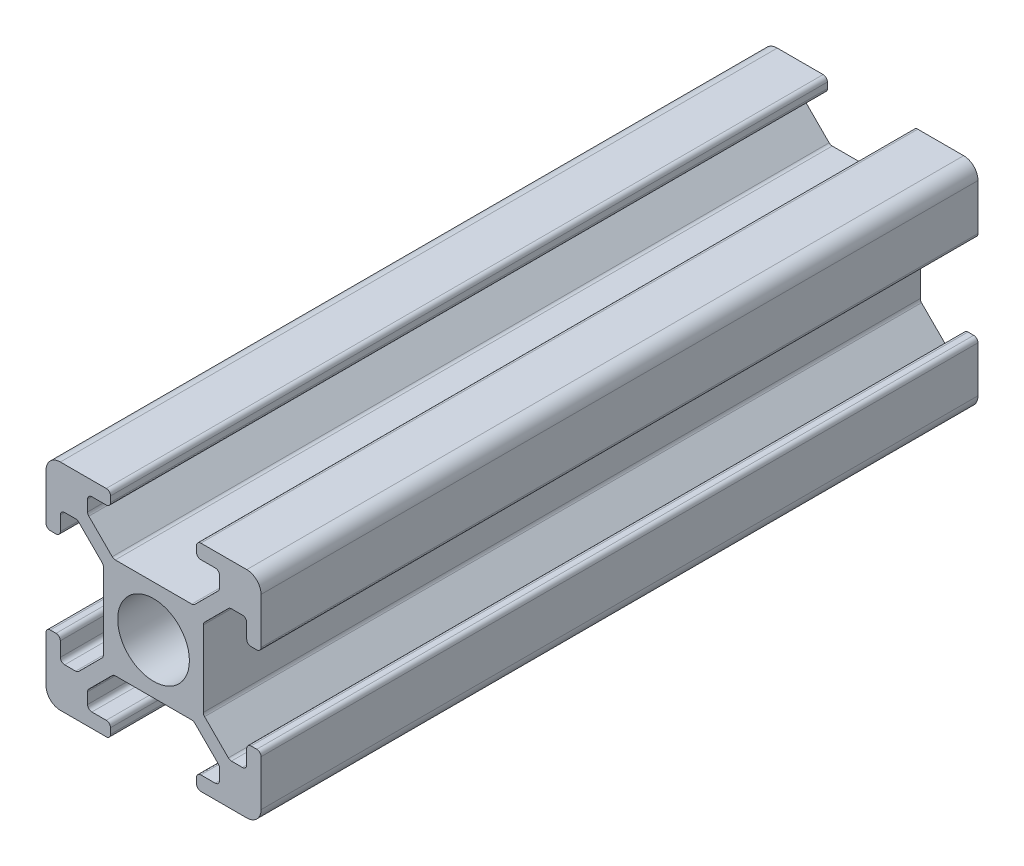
ISO-10303-21;
HEADER;
FILE_DESCRIPTION(('STEP AP214'),'2;1');
FILE_NAME('part.step','',(''),(''),'','','');
FILE_SCHEMA(('AUTOMOTIVE_DESIGN { 1 0 10303 214 1 1 1 1 }'));
ENDSEC;
DATA;
#1=APPLICATION_CONTEXT('core data for automotive mechanical design processes');
#2=APPLICATION_PROTOCOL_DEFINITION('international standard','automotive_design',2000,#1);
#3=PRODUCT_CONTEXT('',#1,'mechanical');
#4=PRODUCT('Part','Part','',(#3));
#5=PRODUCT_RELATED_PRODUCT_CATEGORY('part','',(#4));
#6=PRODUCT_DEFINITION_FORMATION('','',#4);
#7=PRODUCT_DEFINITION_CONTEXT('part definition',#1,'design');
#8=PRODUCT_DEFINITION('design','',#6,#7);
#9=PRODUCT_DEFINITION_SHAPE('','',#8);
#10=(LENGTH_UNIT() NAMED_UNIT(*) SI_UNIT(.MILLI.,.METRE.));
#11=(NAMED_UNIT(*) PLANE_ANGLE_UNIT() SI_UNIT($,.RADIAN.));
#12=(NAMED_UNIT(*) SI_UNIT($,.STERADIAN.) SOLID_ANGLE_UNIT());
#13=UNCERTAINTY_MEASURE_WITH_UNIT(LENGTH_MEASURE(1.E-05),#10,'distance_accuracy_value','');
#14=(GEOMETRIC_REPRESENTATION_CONTEXT(3) GLOBAL_UNCERTAINTY_ASSIGNED_CONTEXT((#13)) GLOBAL_UNIT_ASSIGNED_CONTEXT((#10,
#11,#12)) REPRESENTATION_CONTEXT('',''));
#15=CARTESIAN_POINT('',(0.,0.,0.));
#16=DIRECTION('',(0.,0.,1.));
#17=DIRECTION('',(1.,0.,0.));
#18=AXIS2_PLACEMENT_3D('',#15,#16,#17);
#19=CARTESIAN_POINT('',(1.,1.,50.));
#20=DIRECTION('',(0.,0.,-1.));
#21=DIRECTION('',(-1.,0.,0.));
#22=AXIS2_PLACEMENT_3D('',#19,#20,#21);
#23=PLANE('',#22);
#24=CARTESIAN_POINT('',(1.,1.,50.));
#25=DIRECTION('',(0.,0.,1.));
#26=DIRECTION('',(-1.,0.,0.));
#27=AXIS2_PLACEMENT_3D('',#24,#25,#26);
#28=CIRCLE('',#27,1.);
#29=CARTESIAN_POINT('',(0.,1.00000000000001,50.));
#30=VERTEX_POINT('',#29);
#31=CARTESIAN_POINT('',(1.00000000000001,0.,50.));
#32=VERTEX_POINT('',#31);
#33=EDGE_CURVE('E793',#30,#32,#28,.T.);
#34=ORIENTED_EDGE('',*,*,#33,.T.);
#35=DIRECTION('',(1.,0.,0.));
#36=VECTOR('',#35,1.);
#37=CARTESIAN_POINT('',(1.00000000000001,0.,50.));
#38=LINE('',#37,#36);
#39=CARTESIAN_POINT('',(4.2,0.,50.));
#40=VERTEX_POINT('',#39);
#41=EDGE_CURVE('E341',#32,#40,#38,.T.);
#42=ORIENTED_EDGE('',*,*,#41,.T.);
#43=CARTESIAN_POINT('',(4.2,0.3,50.));
#44=DIRECTION('',(0.,0.,1.));
#45=DIRECTION('',(-1.,0.,0.));
#46=AXIS2_PLACEMENT_3D('',#43,#44,#45);
#47=CIRCLE('',#46,0.3);
#48=CARTESIAN_POINT('',(4.5,0.300000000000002,50.));
#49=VERTEX_POINT('',#48);
#50=EDGE_CURVE('E1048',#40,#49,#47,.T.);
#51=ORIENTED_EDGE('',*,*,#50,.T.);
#52=DIRECTION('',(0.,1.,0.));
#53=VECTOR('',#52,1.);
#54=CARTESIAN_POINT('',(4.5,0.300000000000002,50.));
#55=LINE('',#54,#53);
#56=CARTESIAN_POINT('',(4.5,0.699999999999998,50.));
#57=VERTEX_POINT('',#56);
#58=EDGE_CURVE('E1067',#49,#57,#55,.T.);
#59=ORIENTED_EDGE('',*,*,#58,.T.);
#60=CARTESIAN_POINT('',(4.2,0.7,50.));
#61=DIRECTION('',(0.,0.,1.));
#62=DIRECTION('',(1.,0.,0.));
#63=AXIS2_PLACEMENT_3D('',#60,#61,#62);
#64=CIRCLE('',#63,0.3);
#65=CARTESIAN_POINT('',(4.2,1.,50.));
#66=VERTEX_POINT('',#65);
#67=EDGE_CURVE('E1064',#57,#66,#64,.T.);
#68=ORIENTED_EDGE('',*,*,#67,.T.);
#69=DIRECTION('',(-1.,0.,0.));
#70=VECTOR('',#69,1.);
#71=CARTESIAN_POINT('',(4.2,1.,50.));
#72=LINE('',#71,#70);
#73=CARTESIAN_POINT('',(3.20000000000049,1.,50.));
#74=VERTEX_POINT('',#73);
#75=EDGE_CURVE('E1066',#66,#74,#72,.T.);
#76=ORIENTED_EDGE('',*,*,#75,.T.);
#77=CARTESIAN_POINT('',(3.20000000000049,1.3,50.));
#78=DIRECTION('',(0.,0.,-1.));
#79=DIRECTION('',(-1.,0.,0.));
#80=AXIS2_PLACEMENT_3D('',#77,#78,#79);
#81=CIRCLE('',#80,0.3);
#82=CARTESIAN_POINT('',(2.90000000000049,1.3,50.));
#83=VERTEX_POINT('',#82);
#84=EDGE_CURVE('E1069',#74,#83,#81,.T.);
#85=ORIENTED_EDGE('',*,*,#84,.T.);
#86=DIRECTION('',(0.,1.,0.));
#87=VECTOR('',#86,1.);
#88=CARTESIAN_POINT('',(2.90000000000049,1.3,50.));
#89=LINE('',#88,#87);
#90=CARTESIAN_POINT('',(2.90000000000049,2.06862915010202,50.));
#91=VERTEX_POINT('',#90);
#92=EDGE_CURVE('E1075',#83,#91,#89,.T.);
#93=ORIENTED_EDGE('',*,*,#92,.T.);
#94=CARTESIAN_POINT('',(3.20000000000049,2.06862915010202,50.));
#95=DIRECTION('',(0.,0.,-1.));
#96=DIRECTION('',(-1.,0.,0.));
#97=AXIS2_PLACEMENT_3D('',#94,#95,#96);
#98=CIRCLE('',#97,0.3);
#99=CARTESIAN_POINT('',(2.98786796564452,2.28076118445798,50.));
#100=VERTEX_POINT('',#99);
#101=EDGE_CURVE('E1077',#91,#100,#98,.T.);
#102=ORIENTED_EDGE('',*,*,#101,.T.);
#103=DIRECTION('',(0.707106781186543,0.707106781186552,0.));
#104=VECTOR('',#103,1.);
#105=CARTESIAN_POINT('',(4.6192388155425,3.91213203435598,50.));
#106=LINE('',#105,#104);
#107=CARTESIAN_POINT('',(4.6192388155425,3.91213203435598,50.));
#108=VERTEX_POINT('',#107);
#109=EDGE_CURVE('E1079',#100,#108,#106,.T.);
#110=ORIENTED_EDGE('',*,*,#109,.T.);
#111=CARTESIAN_POINT('',(4.83137084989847,3.70000000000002,50.));
#112=DIRECTION('',(0.,0.,-1.));
#113=DIRECTION('',(-1.,0.,0.));
#114=AXIS2_PLACEMENT_3D('',#111,#112,#113);
#115=CIRCLE('',#114,0.3);
#116=CARTESIAN_POINT('',(4.83137084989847,4.00000000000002,50.));
#117=VERTEX_POINT('',#116);
#118=EDGE_CURVE('E1081',#108,#117,#115,.T.);
#119=ORIENTED_EDGE('',*,*,#118,.T.);
#120=DIRECTION('',(1.,0.,0.));
#121=VECTOR('',#120,1.);
#122=CARTESIAN_POINT('',(10.1686291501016,4.,50.));
#123=LINE('',#122,#121);
#124=CARTESIAN_POINT('',(10.1686291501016,4.,50.));
#125=VERTEX_POINT('',#124);
#126=EDGE_CURVE('E1083',#117,#125,#123,.T.);
#127=ORIENTED_EDGE('',*,*,#126,.T.);
#128=CARTESIAN_POINT('',(10.1686291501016,3.7,50.));
#129=DIRECTION('',(0.,0.,-1.));
#130=DIRECTION('',(1.,0.,0.));
#131=AXIS2_PLACEMENT_3D('',#128,#129,#130);
#132=CIRCLE('',#131,0.299999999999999);
#133=CARTESIAN_POINT('',(10.3807611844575,3.91213203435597,50.));
#134=VERTEX_POINT('',#133);
#135=EDGE_CURVE('E1085',#125,#134,#132,.T.);
#136=ORIENTED_EDGE('',*,*,#135,.T.);
#137=DIRECTION('',(0.707106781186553,-0.707106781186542,0.));
#138=VECTOR('',#137,1.);
#139=CARTESIAN_POINT('',(10.3807611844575,3.91213203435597,50.));
#140=LINE('',#139,#138);
#141=CARTESIAN_POINT('',(12.0121320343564,2.28076118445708,50.));
#142=VERTEX_POINT('',#141);
#143=EDGE_CURVE('E1087',#134,#142,#140,.T.);
#144=ORIENTED_EDGE('',*,*,#143,.T.);
#145=CARTESIAN_POINT('',(11.8000000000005,2.06862915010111,50.));
#146=DIRECTION('',(0.,0.,-1.));
#147=DIRECTION('',(1.,0.,0.));
#148=AXIS2_PLACEMENT_3D('',#145,#146,#147);
#149=CIRCLE('',#148,0.3);
#150=CARTESIAN_POINT('',(12.1000000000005,2.06862915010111,50.));
#151=VERTEX_POINT('',#150);
#152=EDGE_CURVE('E1089',#142,#151,#149,.T.);
#153=ORIENTED_EDGE('',*,*,#152,.T.);
#154=DIRECTION('',(0.,-1.,0.));
#155=VECTOR('',#154,1.);
#156=CARTESIAN_POINT('',(12.1000000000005,1.3,50.));
#157=LINE('',#156,#155);
#158=CARTESIAN_POINT('',(12.1000000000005,1.3,50.));
#159=VERTEX_POINT('',#158);
#160=EDGE_CURVE('E1091',#151,#159,#157,.T.);
#161=ORIENTED_EDGE('',*,*,#160,.T.);
#162=CARTESIAN_POINT('',(11.8000000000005,1.3,50.));
#163=DIRECTION('',(0.,0.,-1.));
#164=DIRECTION('',(1.,0.,0.));
#165=AXIS2_PLACEMENT_3D('',#162,#163,#164);
#166=CIRCLE('',#165,0.3);
#167=CARTESIAN_POINT('',(11.8000000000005,1.,50.));
#168=VERTEX_POINT('',#167);
#169=EDGE_CURVE('E1093',#159,#168,#166,.T.);
#170=ORIENTED_EDGE('',*,*,#169,.T.);
#171=DIRECTION('',(-1.,0.,0.));
#172=VECTOR('',#171,1.);
#173=CARTESIAN_POINT('',(10.8,1.,50.));
#174=LINE('',#173,#172);
#175=CARTESIAN_POINT('',(10.8,1.,50.));
#176=VERTEX_POINT('',#175);
#177=EDGE_CURVE('E1095',#168,#176,#174,.T.);
#178=ORIENTED_EDGE('',*,*,#177,.T.);
#179=CARTESIAN_POINT('',(10.8,0.7,50.));
#180=DIRECTION('',(0.,0.,1.));
#181=DIRECTION('',(-1.,0.,0.));
#182=AXIS2_PLACEMENT_3D('',#179,#180,#181);
#183=CIRCLE('',#182,0.3);
#184=CARTESIAN_POINT('',(10.5,0.699999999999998,50.));
#185=VERTEX_POINT('',#184);
#186=EDGE_CURVE('E1097',#176,#185,#183,.T.);
#187=ORIENTED_EDGE('',*,*,#186,.T.);
#188=DIRECTION('',(0.,-1.,0.));
#189=VECTOR('',#188,1.);
#190=CARTESIAN_POINT('',(10.5,0.300000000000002,50.));
#191=LINE('',#190,#189);
#192=CARTESIAN_POINT('',(10.5,0.300000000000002,50.));
#193=VERTEX_POINT('',#192);
#194=EDGE_CURVE('E1099',#185,#193,#191,.T.);
#195=ORIENTED_EDGE('',*,*,#194,.T.);
#196=CARTESIAN_POINT('',(10.8,0.3,50.));
#197=DIRECTION('',(0.,0.,1.));
#198=DIRECTION('',(1.,0.,0.));
#199=AXIS2_PLACEMENT_3D('',#196,#197,#198);
#200=CIRCLE('',#199,0.3);
#201=CARTESIAN_POINT('',(10.8,0.,50.));
#202=VERTEX_POINT('',#201);
#203=EDGE_CURVE('E1101',#193,#202,#200,.T.);
#204=ORIENTED_EDGE('',*,*,#203,.T.);
#205=DIRECTION('',(1.,0.,0.));
#206=VECTOR('',#205,1.);
#207=CARTESIAN_POINT('',(10.8,0.,50.));
#208=LINE('',#207,#206);
#209=CARTESIAN_POINT('',(14.,0.,50.));
#210=VERTEX_POINT('',#209);
#211=EDGE_CURVE('E1103',#202,#210,#208,.T.);
#212=ORIENTED_EDGE('',*,*,#211,.T.);
#213=CARTESIAN_POINT('',(14.,1.,50.));
#214=DIRECTION('',(0.,0.,1.));
#215=DIRECTION('',(1.,0.,0.));
#216=AXIS2_PLACEMENT_3D('',#213,#214,#215);
#217=CIRCLE('',#216,1.);
#218=CARTESIAN_POINT('',(15.,1.00000000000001,50.));
#219=VERTEX_POINT('',#218);
#220=EDGE_CURVE('E1105',#210,#219,#217,.T.);
#221=ORIENTED_EDGE('',*,*,#220,.T.);
#222=DIRECTION('',(0.,1.,0.));
#223=VECTOR('',#222,1.);
#224=CARTESIAN_POINT('',(15.,1.00000000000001,50.));
#225=LINE('',#224,#223);
#226=CARTESIAN_POINT('',(15.,4.2,50.));
#227=VERTEX_POINT('',#226);
#228=EDGE_CURVE('E1107',#219,#227,#225,.T.);
#229=ORIENTED_EDGE('',*,*,#228,.T.);
#230=CARTESIAN_POINT('',(14.7,4.2,50.));
#231=DIRECTION('',(0.,0.,1.));
#232=DIRECTION('',(1.,0.,0.));
#233=AXIS2_PLACEMENT_3D('',#230,#231,#232);
#234=CIRCLE('',#233,0.3);
#235=CARTESIAN_POINT('',(14.7,4.5,50.));
#236=VERTEX_POINT('',#235);
#237=EDGE_CURVE('E1109',#227,#236,#234,.T.);
#238=ORIENTED_EDGE('',*,*,#237,.T.);
#239=DIRECTION('',(-1.,0.,0.));
#240=VECTOR('',#239,1.);
#241=CARTESIAN_POINT('',(14.7,4.5,50.));
#242=LINE('',#241,#240);
#243=CARTESIAN_POINT('',(14.3,4.5,50.));
#244=VERTEX_POINT('',#243);
#245=EDGE_CURVE('E1111',#236,#244,#242,.T.);
#246=ORIENTED_EDGE('',*,*,#245,.T.);
#247=CARTESIAN_POINT('',(14.3,4.2,50.));
#248=DIRECTION('',(0.,0.,1.));
#249=DIRECTION('',(1.,0.,0.));
#250=AXIS2_PLACEMENT_3D('',#247,#248,#249);
#251=CIRCLE('',#250,0.3);
#252=CARTESIAN_POINT('',(14.,4.2,50.));
#253=VERTEX_POINT('',#252);
#254=EDGE_CURVE('E1113',#244,#253,#251,.T.);
#255=ORIENTED_EDGE('',*,*,#254,.T.);
#256=DIRECTION('',(0.,-1.,0.));
#257=VECTOR('',#256,1.);
#258=CARTESIAN_POINT('',(14.,4.2,50.));
#259=LINE('',#258,#257);
#260=CARTESIAN_POINT('',(14.,3.2,50.));
#261=VERTEX_POINT('',#260);
#262=EDGE_CURVE('E1115',#253,#261,#259,.T.);
#263=ORIENTED_EDGE('',*,*,#262,.T.);
#264=CARTESIAN_POINT('',(13.7,3.2,50.));
#265=DIRECTION('',(0.,0.,-1.));
#266=DIRECTION('',(-1.,0.,0.));
#267=AXIS2_PLACEMENT_3D('',#264,#265,#266);
#268=CIRCLE('',#267,0.3);
#269=CARTESIAN_POINT('',(13.7,2.9,50.));
#270=VERTEX_POINT('',#269);
#271=EDGE_CURVE('E1117',#261,#270,#268,.T.);
#272=ORIENTED_EDGE('',*,*,#271,.T.);
#273=DIRECTION('',(-1.,0.,0.));
#274=VECTOR('',#273,1.);
#275=CARTESIAN_POINT('',(13.7,2.9,50.));
#276=LINE('',#275,#274);
#277=CARTESIAN_POINT('',(12.9313708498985,2.9,50.));
#278=VERTEX_POINT('',#277);
#279=EDGE_CURVE('E1119',#270,#278,#276,.T.);
#280=ORIENTED_EDGE('',*,*,#279,.T.);
#281=CARTESIAN_POINT('',(12.9313708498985,3.2,50.));
#282=DIRECTION('',(0.,0.,-1.));
#283=DIRECTION('',(-1.,0.,0.));
#284=AXIS2_PLACEMENT_3D('',#281,#282,#283);
#285=CIRCLE('',#284,0.3);
#286=CARTESIAN_POINT('',(12.7192388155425,2.98786796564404,50.));
#287=VERTEX_POINT('',#286);
#288=EDGE_CURVE('E1121',#278,#287,#285,.T.);
#289=ORIENTED_EDGE('',*,*,#288,.T.);
#290=DIRECTION('',(-0.707106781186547,0.707106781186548,0.));
#291=VECTOR('',#290,1.);
#292=CARTESIAN_POINT('',(11.0606674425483,4.64643933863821,50.));
#293=LINE('',#292,#291);
#294=CARTESIAN_POINT('',(11.0606674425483,4.64643933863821,50.));
#295=VERTEX_POINT('',#294);
#296=EDGE_CURVE('E1123',#287,#295,#293,.T.);
#297=ORIENTED_EDGE('',*,*,#296,.T.);
#298=CARTESIAN_POINT('',(11.2727994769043,4.85857137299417,50.));
#299=DIRECTION('',(0.,0.,-1.));
#300=DIRECTION('',(-1.,0.,0.));
#301=AXIS2_PLACEMENT_3D('',#298,#299,#300);
#302=CIRCLE('',#301,0.3);
#303=CARTESIAN_POINT('',(10.9727994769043,4.85857137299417,50.));
#304=VERTEX_POINT('',#303);
#305=EDGE_CURVE('E1125',#295,#304,#302,.T.);
#306=ORIENTED_EDGE('',*,*,#305,.T.);
#307=DIRECTION('',(0.,1.,0.));
#308=VECTOR('',#307,1.);
#309=CARTESIAN_POINT('',(10.9727994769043,10.1414286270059,50.));
#310=LINE('',#309,#308);
#311=CARTESIAN_POINT('',(10.9727994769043,10.1414286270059,50.));
#312=VERTEX_POINT('',#311);
#313=EDGE_CURVE('E1127',#304,#312,#310,.T.);
#314=ORIENTED_EDGE('',*,*,#313,.T.);
#315=CARTESIAN_POINT('',(11.2727994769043,10.1414286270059,50.));
#316=DIRECTION('',(0.,0.,-1.));
#317=DIRECTION('',(1.,0.,0.));
#318=AXIS2_PLACEMENT_3D('',#315,#316,#317);
#319=CIRCLE('',#318,0.3);
#320=CARTESIAN_POINT('',(11.0606674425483,10.3535606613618,50.));
#321=VERTEX_POINT('',#320);
#322=EDGE_CURVE('E1129',#312,#321,#319,.T.);
#323=ORIENTED_EDGE('',*,*,#322,.T.);
#324=DIRECTION('',(0.70710678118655,0.707106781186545,0.));
#325=VECTOR('',#324,1.);
#326=CARTESIAN_POINT('',(11.0606674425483,10.3535606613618,50.));
#327=LINE('',#326,#325);
#328=CARTESIAN_POINT('',(12.7192388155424,12.0121320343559,50.));
#329=VERTEX_POINT('',#328);
#330=EDGE_CURVE('E1131',#321,#329,#327,.T.);
#331=ORIENTED_EDGE('',*,*,#330,.T.);
#332=CARTESIAN_POINT('',(12.9313708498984,11.8,50.));
#333=DIRECTION('',(0.,0.,-1.));
#334=DIRECTION('',(1.,0.,0.));
#335=AXIS2_PLACEMENT_3D('',#332,#333,#334);
#336=CIRCLE('',#335,0.3);
#337=CARTESIAN_POINT('',(12.9313708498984,12.1,50.));
#338=VERTEX_POINT('',#337);
#339=EDGE_CURVE('E1133',#329,#338,#336,.T.);
#340=ORIENTED_EDGE('',*,*,#339,.T.);
#341=DIRECTION('',(1.,0.,0.));
#342=VECTOR('',#341,1.);
#343=CARTESIAN_POINT('',(13.7,12.1,50.));
#344=LINE('',#343,#342);
#345=CARTESIAN_POINT('',(13.7,12.1,50.));
#346=VERTEX_POINT('',#345);
#347=EDGE_CURVE('E1135',#338,#346,#344,.T.);
#348=ORIENTED_EDGE('',*,*,#347,.T.);
#349=CARTESIAN_POINT('',(13.7,11.8,50.));
#350=DIRECTION('',(0.,0.,-1.));
#351=DIRECTION('',(1.,0.,0.));
#352=AXIS2_PLACEMENT_3D('',#349,#350,#351);
#353=CIRCLE('',#352,0.3);
#354=CARTESIAN_POINT('',(14.,11.8,50.));
#355=VERTEX_POINT('',#354);
#356=EDGE_CURVE('E1137',#346,#355,#353,.T.);
#357=ORIENTED_EDGE('',*,*,#356,.T.);
#358=DIRECTION('',(0.,-1.,0.));
#359=VECTOR('',#358,1.);
#360=CARTESIAN_POINT('',(14.,10.8,50.));
#361=LINE('',#360,#359);
#362=CARTESIAN_POINT('',(14.,10.8,50.));
#363=VERTEX_POINT('',#362);
#364=EDGE_CURVE('E1139',#355,#363,#361,.T.);
#365=ORIENTED_EDGE('',*,*,#364,.T.);
#366=CARTESIAN_POINT('',(14.3,10.8,50.));
#367=DIRECTION('',(0.,0.,1.));
#368=DIRECTION('',(-1.,0.,0.));
#369=AXIS2_PLACEMENT_3D('',#366,#367,#368);
#370=CIRCLE('',#369,0.3);
#371=CARTESIAN_POINT('',(14.3,10.5,50.));
#372=VERTEX_POINT('',#371);
#373=EDGE_CURVE('E1141',#363,#372,#370,.T.);
#374=ORIENTED_EDGE('',*,*,#373,.T.);
#375=DIRECTION('',(1.,0.,0.));
#376=VECTOR('',#375,1.);
#377=CARTESIAN_POINT('',(14.7,10.5,50.));
#378=LINE('',#377,#376);
#379=CARTESIAN_POINT('',(14.7,10.5,50.));
#380=VERTEX_POINT('',#379);
#381=EDGE_CURVE('E1143',#372,#380,#378,.T.);
#382=ORIENTED_EDGE('',*,*,#381,.T.);
#383=CARTESIAN_POINT('',(14.7,10.8,50.));
#384=DIRECTION('',(0.,0.,1.));
#385=DIRECTION('',(-1.,0.,0.));
#386=AXIS2_PLACEMENT_3D('',#383,#384,#385);
#387=CIRCLE('',#386,0.3);
#388=CARTESIAN_POINT('',(15.,10.8,50.));
#389=VERTEX_POINT('',#388);
#390=EDGE_CURVE('E1145',#380,#389,#387,.T.);
#391=ORIENTED_EDGE('',*,*,#390,.T.);
#392=DIRECTION('',(0.,1.,0.));
#393=VECTOR('',#392,1.);
#394=CARTESIAN_POINT('',(15.,10.8,50.));
#395=LINE('',#394,#393);
#396=CARTESIAN_POINT('',(15.,14.,50.));
#397=VERTEX_POINT('',#396);
#398=EDGE_CURVE('E1147',#389,#397,#395,.T.);
#399=ORIENTED_EDGE('',*,*,#398,.T.);
#400=CARTESIAN_POINT('',(14.,14.,50.));
#401=DIRECTION('',(0.,0.,1.));
#402=DIRECTION('',(1.,0.,0.));
#403=AXIS2_PLACEMENT_3D('',#400,#401,#402);
#404=CIRCLE('',#403,1.);
#405=CARTESIAN_POINT('',(14.,15.,50.));
#406=VERTEX_POINT('',#405);
#407=EDGE_CURVE('E1149',#397,#406,#404,.T.);
#408=ORIENTED_EDGE('',*,*,#407,.T.);
#409=DIRECTION('',(-1.,0.,0.));
#410=VECTOR('',#409,1.);
#411=CARTESIAN_POINT('',(14.,15.,50.));
#412=LINE('',#411,#410);
#413=CARTESIAN_POINT('',(10.8000000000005,15.,50.));
#414=VERTEX_POINT('',#413);
#415=EDGE_CURVE('E1151',#406,#414,#412,.T.);
#416=ORIENTED_EDGE('',*,*,#415,.T.);
#417=CARTESIAN_POINT('',(10.8000000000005,14.7,50.));
#418=DIRECTION('',(0.,0.,1.));
#419=DIRECTION('',(1.,0.,0.));
#420=AXIS2_PLACEMENT_3D('',#417,#418,#419);
#421=CIRCLE('',#420,0.3);
#422=CARTESIAN_POINT('',(10.5000000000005,14.7,50.));
#423=VERTEX_POINT('',#422);
#424=EDGE_CURVE('E1153',#414,#423,#421,.T.);
#425=ORIENTED_EDGE('',*,*,#424,.T.);
#426=DIRECTION('',(0.,-1.,0.));
#427=VECTOR('',#426,1.);
#428=CARTESIAN_POINT('',(10.5000000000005,14.7,50.));
#429=LINE('',#428,#427);
#430=CARTESIAN_POINT('',(10.5000000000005,14.3,50.));
#431=VERTEX_POINT('',#430);
#432=EDGE_CURVE('E1155',#423,#431,#429,.T.);
#433=ORIENTED_EDGE('',*,*,#432,.T.);
#434=CARTESIAN_POINT('',(10.8000000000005,14.3,50.));
#435=DIRECTION('',(0.,0.,1.));
#436=DIRECTION('',(1.,0.,0.));
#437=AXIS2_PLACEMENT_3D('',#434,#435,#436);
#438=CIRCLE('',#437,0.3);
#439=CARTESIAN_POINT('',(10.8000000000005,14.,50.));
#440=VERTEX_POINT('',#439);
#441=EDGE_CURVE('E1157',#431,#440,#438,.T.);
#442=ORIENTED_EDGE('',*,*,#441,.T.);
#443=DIRECTION('',(1.,0.,0.));
#444=VECTOR('',#443,1.);
#445=CARTESIAN_POINT('',(10.8000000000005,14.,50.));
#446=LINE('',#445,#444);
#447=CARTESIAN_POINT('',(11.8000000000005,14.,50.));
#448=VERTEX_POINT('',#447);
#449=EDGE_CURVE('E1159',#440,#448,#446,.T.);
#450=ORIENTED_EDGE('',*,*,#449,.T.);
#451=CARTESIAN_POINT('',(11.8000000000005,13.7,50.));
#452=DIRECTION('',(0.,0.,-1.));
#453=DIRECTION('',(-1.,0.,0.));
#454=AXIS2_PLACEMENT_3D('',#451,#452,#453);
#455=CIRCLE('',#454,0.3);
#456=CARTESIAN_POINT('',(12.1000000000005,13.7,50.));
#457=VERTEX_POINT('',#456);
#458=EDGE_CURVE('E1161',#448,#457,#455,.T.);
#459=ORIENTED_EDGE('',*,*,#458,.T.);
#460=DIRECTION('',(0.,-1.,0.));
#461=VECTOR('',#460,1.);
#462=CARTESIAN_POINT('',(12.1000000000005,13.7,50.));
#463=LINE('',#462,#461);
#464=CARTESIAN_POINT('',(12.1000000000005,12.9313708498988,50.));
#465=VERTEX_POINT('',#464);
#466=EDGE_CURVE('E1163',#457,#465,#463,.T.);
#467=ORIENTED_EDGE('',*,*,#466,.T.);
#468=CARTESIAN_POINT('',(11.8000000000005,12.9313708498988,50.));
#469=DIRECTION('',(0.,0.,-1.));
#470=DIRECTION('',(-1.,0.,0.));
#471=AXIS2_PLACEMENT_3D('',#468,#469,#470);
#472=CIRCLE('',#471,0.3);
#473=CARTESIAN_POINT('',(12.0121320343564,12.7192388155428,50.));
#474=VERTEX_POINT('',#473);
#475=EDGE_CURVE('E1165',#465,#474,#472,.T.);
#476=ORIENTED_EDGE('',*,*,#475,.T.);
#477=DIRECTION('',(-0.707106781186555,-0.70710678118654,0.));
#478=VECTOR('',#477,1.);
#479=CARTESIAN_POINT('',(10.3807611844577,11.0878679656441,50.));
#480=LINE('',#479,#478);
#481=CARTESIAN_POINT('',(10.3807611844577,11.0878679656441,50.));
#482=VERTEX_POINT('',#481);
#483=EDGE_CURVE('E1167',#474,#482,#480,.T.);
#484=ORIENTED_EDGE('',*,*,#483,.T.);
#485=CARTESIAN_POINT('',(10.1686291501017,11.3,50.));
#486=DIRECTION('',(0.,0.,-1.));
#487=DIRECTION('',(-1.,0.,0.));
#488=AXIS2_PLACEMENT_3D('',#485,#486,#487);
#489=CIRCLE('',#488,0.3);
#490=CARTESIAN_POINT('',(10.1686291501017,11.,50.));
#491=VERTEX_POINT('',#490);
#492=EDGE_CURVE('E1169',#482,#491,#489,.T.);
#493=ORIENTED_EDGE('',*,*,#492,.T.);
#494=DIRECTION('',(-1.,0.,0.));
#495=VECTOR('',#494,1.);
#496=CARTESIAN_POINT('',(4.83137084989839,11.,50.));
#497=LINE('',#496,#495);
#498=CARTESIAN_POINT('',(4.83137084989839,11.,50.));
#499=VERTEX_POINT('',#498);
#500=EDGE_CURVE('E1171',#491,#499,#497,.T.);
#501=ORIENTED_EDGE('',*,*,#500,.T.);
#502=CARTESIAN_POINT('',(4.83137084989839,11.3,50.));
#503=DIRECTION('',(0.,0.,-1.));
#504=DIRECTION('',(1.,0.,0.));
#505=AXIS2_PLACEMENT_3D('',#502,#503,#504);
#506=CIRCLE('',#505,0.3);
#507=CARTESIAN_POINT('',(4.61923881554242,11.087867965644,50.));
#508=VERTEX_POINT('',#507);
#509=EDGE_CURVE('E1173',#499,#508,#506,.T.);
#510=ORIENTED_EDGE('',*,*,#509,.T.);
#511=DIRECTION('',(-0.70710678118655,0.707106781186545,0.));
#512=VECTOR('',#511,1.);
#513=CARTESIAN_POINT('',(4.61923881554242,11.087867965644,50.));
#514=LINE('',#513,#512);
#515=CARTESIAN_POINT('',(2.98786796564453,12.7192388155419,50.));
#516=VERTEX_POINT('',#515);
#517=EDGE_CURVE('E1175',#508,#516,#514,.T.);
#518=ORIENTED_EDGE('',*,*,#517,.T.);
#519=CARTESIAN_POINT('',(3.20000000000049,12.9313708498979,50.));
#520=DIRECTION('',(0.,0.,-1.));
#521=DIRECTION('',(1.,0.,0.));
#522=AXIS2_PLACEMENT_3D('',#519,#520,#521);
#523=CIRCLE('',#522,0.3);
#524=CARTESIAN_POINT('',(2.90000000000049,12.9313708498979,50.));
#525=VERTEX_POINT('',#524);
#526=EDGE_CURVE('E1177',#516,#525,#523,.T.);
#527=ORIENTED_EDGE('',*,*,#526,.T.);
#528=DIRECTION('',(0.,1.,0.));
#529=VECTOR('',#528,1.);
#530=CARTESIAN_POINT('',(2.90000000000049,13.7,50.));
#531=LINE('',#530,#529);
#532=CARTESIAN_POINT('',(2.90000000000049,13.7,50.));
#533=VERTEX_POINT('',#532);
#534=EDGE_CURVE('E1179',#525,#533,#531,.T.);
#535=ORIENTED_EDGE('',*,*,#534,.T.);
#536=CARTESIAN_POINT('',(3.20000000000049,13.7,50.));
#537=DIRECTION('',(0.,0.,-1.));
#538=DIRECTION('',(1.,0.,0.));
#539=AXIS2_PLACEMENT_3D('',#536,#537,#538);
#540=CIRCLE('',#539,0.3);
#541=CARTESIAN_POINT('',(3.20000000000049,14.,50.));
#542=VERTEX_POINT('',#541);
#543=EDGE_CURVE('E1181',#533,#542,#540,.T.);
#544=ORIENTED_EDGE('',*,*,#543,.T.);
#545=DIRECTION('',(1.,0.,0.));
#546=VECTOR('',#545,1.);
#547=CARTESIAN_POINT('',(4.20000000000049,14.,50.));
#548=LINE('',#547,#546);
#549=CARTESIAN_POINT('',(4.20000000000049,14.,50.));
#550=VERTEX_POINT('',#549);
#551=EDGE_CURVE('E1183',#542,#550,#548,.T.);
#552=ORIENTED_EDGE('',*,*,#551,.T.);
#553=CARTESIAN_POINT('',(4.20000000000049,14.3,50.));
#554=DIRECTION('',(0.,0.,1.));
#555=DIRECTION('',(-1.,0.,0.));
#556=AXIS2_PLACEMENT_3D('',#553,#554,#555);
#557=CIRCLE('',#556,0.3);
#558=CARTESIAN_POINT('',(4.50000000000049,14.3,50.));
#559=VERTEX_POINT('',#558);
#560=EDGE_CURVE('E1185',#550,#559,#557,.T.);
#561=ORIENTED_EDGE('',*,*,#560,.T.);
#562=DIRECTION('',(0.,1.,0.));
#563=VECTOR('',#562,1.);
#564=CARTESIAN_POINT('',(4.50000000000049,14.7,50.));
#565=LINE('',#564,#563);
#566=CARTESIAN_POINT('',(4.50000000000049,14.7,50.));
#567=VERTEX_POINT('',#566);
#568=EDGE_CURVE('E1187',#559,#567,#565,.T.);
#569=ORIENTED_EDGE('',*,*,#568,.T.);
#570=CARTESIAN_POINT('',(4.20000000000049,14.7,50.));
#571=DIRECTION('',(0.,0.,1.));
#572=DIRECTION('',(-1.,0.,0.));
#573=AXIS2_PLACEMENT_3D('',#570,#571,#572);
#574=CIRCLE('',#573,0.3);
#575=CARTESIAN_POINT('',(4.20000000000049,15.,50.));
#576=VERTEX_POINT('',#575);
#577=EDGE_CURVE('E1189',#567,#576,#574,.T.);
#578=ORIENTED_EDGE('',*,*,#577,.T.);
#579=DIRECTION('',(-1.,0.,0.));
#580=VECTOR('',#579,1.);
#581=CARTESIAN_POINT('',(4.20000000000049,15.,50.));
#582=LINE('',#581,#580);
#583=CARTESIAN_POINT('',(1.00000000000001,15.,50.));
#584=VERTEX_POINT('',#583);
#585=EDGE_CURVE('E1191',#576,#584,#582,.T.);
#586=ORIENTED_EDGE('',*,*,#585,.T.);
#587=CARTESIAN_POINT('',(0.999999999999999,14.,50.));
#588=DIRECTION('',(0.,0.,1.));
#589=DIRECTION('',(1.,0.,0.));
#590=AXIS2_PLACEMENT_3D('',#587,#588,#589);
#591=CIRCLE('',#590,1.);
#592=CARTESIAN_POINT('',(0.,14.,50.));
#593=VERTEX_POINT('',#592);
#594=EDGE_CURVE('E1193',#584,#593,#591,.T.);
#595=ORIENTED_EDGE('',*,*,#594,.T.);
#596=DIRECTION('',(0.,-1.,0.));
#597=VECTOR('',#596,1.);
#598=CARTESIAN_POINT('',(0.,14.,50.));
#599=LINE('',#598,#597);
#600=CARTESIAN_POINT('',(0.,10.8,50.));
#601=VERTEX_POINT('',#600);
#602=EDGE_CURVE('E1195',#593,#601,#599,.T.);
#603=ORIENTED_EDGE('',*,*,#602,.T.);
#604=CARTESIAN_POINT('',(0.299999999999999,10.8,50.));
#605=DIRECTION('',(0.,0.,1.));
#606=DIRECTION('',(-1.,0.,0.));
#607=AXIS2_PLACEMENT_3D('',#604,#605,#606);
#608=CIRCLE('',#607,0.3);
#609=CARTESIAN_POINT('',(0.300000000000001,10.5,50.));
#610=VERTEX_POINT('',#609);
#611=EDGE_CURVE('E1197',#601,#610,#608,.T.);
#612=ORIENTED_EDGE('',*,*,#611,.T.);
#613=DIRECTION('',(1.,0.,0.));
#614=VECTOR('',#613,1.);
#615=CARTESIAN_POINT('',(0.300000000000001,10.5,50.));
#616=LINE('',#615,#614);
#617=CARTESIAN_POINT('',(0.699999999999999,10.5,50.));
#618=VERTEX_POINT('',#617);
#619=EDGE_CURVE('E1199',#610,#618,#616,.T.);
#620=ORIENTED_EDGE('',*,*,#619,.T.);
#621=CARTESIAN_POINT('',(0.700000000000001,10.8,50.));
#622=DIRECTION('',(0.,0.,1.));
#623=DIRECTION('',(1.,0.,0.));
#624=AXIS2_PLACEMENT_3D('',#621,#622,#623);
#625=CIRCLE('',#624,0.3);
#626=CARTESIAN_POINT('',(1.,10.8,50.));
#627=VERTEX_POINT('',#626);
#628=EDGE_CURVE('E1201',#618,#627,#625,.T.);
#629=ORIENTED_EDGE('',*,*,#628,.T.);
#630=DIRECTION('',(0.,1.,0.));
#631=VECTOR('',#630,1.);
#632=CARTESIAN_POINT('',(1.,10.8,50.));
#633=LINE('',#632,#631);
#634=CARTESIAN_POINT('',(1.,11.8,50.));
#635=VERTEX_POINT('',#634);
#636=EDGE_CURVE('E1203',#627,#635,#633,.T.);
#637=ORIENTED_EDGE('',*,*,#636,.T.);
#638=CARTESIAN_POINT('',(1.3,11.8,50.));
#639=DIRECTION('',(0.,0.,-1.));
#640=DIRECTION('',(-1.,0.,0.));
#641=AXIS2_PLACEMENT_3D('',#638,#639,#640);
#642=CIRCLE('',#641,0.3);
#643=CARTESIAN_POINT('',(1.3,12.1,50.));
#644=VERTEX_POINT('',#643);
#645=EDGE_CURVE('E1205',#635,#644,#642,.T.);
#646=ORIENTED_EDGE('',*,*,#645,.T.);
#647=DIRECTION('',(1.,0.,0.));
#648=VECTOR('',#647,1.);
#649=CARTESIAN_POINT('',(1.3,12.1,50.));
#650=LINE('',#649,#648);
#651=CARTESIAN_POINT('',(2.0686291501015,12.1,50.));
#652=VERTEX_POINT('',#651);
#653=EDGE_CURVE('E1207',#644,#652,#650,.T.);
#654=ORIENTED_EDGE('',*,*,#653,.T.);
#655=CARTESIAN_POINT('',(2.0686291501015,11.8,50.));
#656=DIRECTION('',(0.,0.,-1.));
#657=DIRECTION('',(-1.,0.,0.));
#658=AXIS2_PLACEMENT_3D('',#655,#656,#657);
#659=CIRCLE('',#658,0.3);
#660=CARTESIAN_POINT('',(2.28076118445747,12.012132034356,50.));
#661=VERTEX_POINT('',#660);
#662=EDGE_CURVE('E1209',#652,#661,#659,.T.);
#663=ORIENTED_EDGE('',*,*,#662,.T.);
#664=DIRECTION('',(0.707106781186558,-0.707106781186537,0.));
#665=VECTOR('',#664,1.);
#666=CARTESIAN_POINT('',(3.91213203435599,10.3807611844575,50.));
#667=LINE('',#666,#665);
#668=CARTESIAN_POINT('',(3.91213203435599,10.3807611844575,50.));
#669=VERTEX_POINT('',#668);
#670=EDGE_CURVE('E1211',#661,#669,#667,.T.);
#671=ORIENTED_EDGE('',*,*,#670,.T.);
#672=CARTESIAN_POINT('',(3.70000000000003,10.1686291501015,50.));
#673=DIRECTION('',(0.,0.,-1.));
#674=DIRECTION('',(-1.,0.,0.));
#675=AXIS2_PLACEMENT_3D('',#672,#673,#674);
#676=CIRCLE('',#675,0.3);
#677=CARTESIAN_POINT('',(4.00000000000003,10.1686291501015,50.));
#678=VERTEX_POINT('',#677);
#679=EDGE_CURVE('E1213',#669,#678,#676,.T.);
#680=ORIENTED_EDGE('',*,*,#679,.T.);
#681=DIRECTION('',(0.,-1.,0.));
#682=VECTOR('',#681,1.);
#683=CARTESIAN_POINT('',(4.,4.83137084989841,50.));
#684=LINE('',#683,#682);
#685=CARTESIAN_POINT('',(4.,4.83137084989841,50.));
#686=VERTEX_POINT('',#685);
#687=EDGE_CURVE('E1215',#678,#686,#684,.T.);
#688=ORIENTED_EDGE('',*,*,#687,.T.);
#689=CARTESIAN_POINT('',(3.7,4.83137084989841,50.));
#690=DIRECTION('',(0.,0.,-1.));
#691=DIRECTION('',(1.,0.,0.));
#692=AXIS2_PLACEMENT_3D('',#689,#690,#691);
#693=CIRCLE('',#692,0.3);
#694=CARTESIAN_POINT('',(3.91213203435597,4.61923881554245,50.));
#695=VERTEX_POINT('',#694);
#696=EDGE_CURVE('E1217',#686,#695,#693,.T.);
#697=ORIENTED_EDGE('',*,*,#696,.T.);
#698=DIRECTION('',(-0.707106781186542,-0.707106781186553,0.));
#699=VECTOR('',#698,1.);
#700=CARTESIAN_POINT('',(3.91213203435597,4.61923881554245,50.));
#701=LINE('',#700,#699);
#702=CARTESIAN_POINT('',(2.28076118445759,2.98786796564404,50.));
#703=VERTEX_POINT('',#702);
#704=EDGE_CURVE('E1219',#695,#703,#701,.T.);
#705=ORIENTED_EDGE('',*,*,#704,.T.);
#706=CARTESIAN_POINT('',(2.06862915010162,3.2,50.));
#707=DIRECTION('',(0.,0.,-1.));
#708=DIRECTION('',(1.,0.,0.));
#709=AXIS2_PLACEMENT_3D('',#706,#707,#708);
#710=CIRCLE('',#709,0.3);
#711=CARTESIAN_POINT('',(2.06862915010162,2.9,50.));
#712=VERTEX_POINT('',#711);
#713=EDGE_CURVE('E1221',#703,#712,#710,.T.);
#714=ORIENTED_EDGE('',*,*,#713,.T.);
#715=DIRECTION('',(-1.,0.,0.));
#716=VECTOR('',#715,1.);
#717=CARTESIAN_POINT('',(1.3,2.9,50.));
#718=LINE('',#717,#716);
#719=CARTESIAN_POINT('',(1.3,2.9,50.));
#720=VERTEX_POINT('',#719);
#721=EDGE_CURVE('E1223',#712,#720,#718,.T.);
#722=ORIENTED_EDGE('',*,*,#721,.T.);
#723=CARTESIAN_POINT('',(1.3,3.2,50.));
#724=DIRECTION('',(0.,0.,-1.));
#725=DIRECTION('',(1.,0.,0.));
#726=AXIS2_PLACEMENT_3D('',#723,#724,#725);
#727=CIRCLE('',#726,0.3);
#728=CARTESIAN_POINT('',(1.,3.2,50.));
#729=VERTEX_POINT('',#728);
#730=EDGE_CURVE('E1225',#720,#729,#727,.T.);
#731=ORIENTED_EDGE('',*,*,#730,.T.);
#732=DIRECTION('',(0.,1.,0.));
#733=VECTOR('',#732,1.);
#734=CARTESIAN_POINT('',(1.,4.2,50.));
#735=LINE('',#734,#733);
#736=CARTESIAN_POINT('',(1.,4.2,50.));
#737=VERTEX_POINT('',#736);
#738=EDGE_CURVE('E1227',#729,#737,#735,.T.);
#739=ORIENTED_EDGE('',*,*,#738,.T.);
#740=CARTESIAN_POINT('',(0.700000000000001,4.2,50.));
#741=DIRECTION('',(0.,0.,1.));
#742=DIRECTION('',(-1.,0.,0.));
#743=AXIS2_PLACEMENT_3D('',#740,#741,#742);
#744=CIRCLE('',#743,0.3);
#745=CARTESIAN_POINT('',(0.699999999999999,4.5,50.));
#746=VERTEX_POINT('',#745);
#747=EDGE_CURVE('E600',#737,#746,#744,.T.);
#748=ORIENTED_EDGE('',*,*,#747,.T.);
#749=DIRECTION('',(-1.,0.,0.));
#750=VECTOR('',#749,1.);
#751=CARTESIAN_POINT('',(0.300000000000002,4.5,50.));
#752=LINE('',#751,#750);
#753=CARTESIAN_POINT('',(0.300000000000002,4.5,50.));
#754=VERTEX_POINT('',#753);
#755=EDGE_CURVE('E594',#746,#754,#752,.T.);
#756=ORIENTED_EDGE('',*,*,#755,.T.);
#757=CARTESIAN_POINT('',(0.3,4.2,50.));
#758=DIRECTION('',(0.,0.,1.));
#759=DIRECTION('',(1.,0.,0.));
#760=AXIS2_PLACEMENT_3D('',#757,#758,#759);
#761=CIRCLE('',#760,0.3);
#762=CARTESIAN_POINT('',(0.,4.2,50.));
#763=VERTEX_POINT('',#762);
#764=EDGE_CURVE('E598',#754,#763,#761,.T.);
#765=ORIENTED_EDGE('',*,*,#764,.T.);
#766=DIRECTION('',(0.,-1.,0.));
#767=VECTOR('',#766,1.);
#768=CARTESIAN_POINT('',(0.,4.2,50.));
#769=LINE('',#768,#767);
#770=EDGE_CURVE('E58',#763,#30,#769,.T.);
#771=ORIENTED_EDGE('',*,*,#770,.T.);
#772=EDGE_LOOP('',(#34,#42,#51,#59,#68,#76,#85,#93,#102,#110,#119,#127,#136,#144,#153,#161,#170,
#178,#187,#195,#204,#212,#221,#229,#238,#246,#255,#263,#272,#280,#289,#297,#306,#314,#323,#331,
#340,#348,#357,#365,#374,#382,#391,#399,#408,#416,#425,#433,#442,#450,#459,#467,#476,#484,#493,
#501,#510,#518,#527,#535,#544,#552,#561,#569,#578,#586,#595,#603,#612,#620,#629,#637,#646,#654,
#663,#671,#680,#688,#697,#705,#714,#722,#731,#739,#748,#756,#765,#771));
#773=FACE_BOUND('',#772,.T.);
#774=CARTESIAN_POINT('',(7.5,7.5,50.));
#775=DIRECTION('',(0.,0.,1.));
#776=DIRECTION('',(1.,0.,0.));
#777=AXIS2_PLACEMENT_3D('',#774,#775,#776);
#778=CIRCLE('',#777,2.5);
#779=CARTESIAN_POINT('',(10.,7.5,50.));
#780=VERTEX_POINT('',#779);
#781=EDGE_CURVE('E622',#780,#780,#778,.T.);
#782=ORIENTED_EDGE('',*,*,#781,.F.);
#783=EDGE_LOOP('',(#782));
#784=FACE_BOUND('',#783,.T.);
#785=ADVANCED_FACE('F41',(#773,#784),#23,.F.);
#786=CARTESIAN_POINT('',(1.,1.,0.));
#787=DIRECTION('',(0.,0.,-1.));
#788=DIRECTION('',(-1.,0.,0.));
#789=AXIS2_PLACEMENT_3D('',#786,#787,#788);
#790=PLANE('',#789);
#791=CARTESIAN_POINT('',(1.,1.,0.));
#792=DIRECTION('',(0.,0.,1.));
#793=DIRECTION('',(-1.,0.,0.));
#794=AXIS2_PLACEMENT_3D('',#791,#792,#793);
#795=CIRCLE('',#794,1.);
#796=CARTESIAN_POINT('',(0.,1.00000000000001,0.));
#797=VERTEX_POINT('',#796);
#798=CARTESIAN_POINT('',(1.00000000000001,0.,0.));
#799=VERTEX_POINT('',#798);
#800=EDGE_CURVE('E618',#797,#799,#795,.T.);
#801=ORIENTED_EDGE('',*,*,#800,.F.);
#802=DIRECTION('',(0.,-1.,0.));
#803=VECTOR('',#802,1.);
#804=CARTESIAN_POINT('',(0.,4.2,0.));
#805=LINE('',#804,#803);
#806=CARTESIAN_POINT('',(0.,4.2,0.));
#807=VERTEX_POINT('',#806);
#808=EDGE_CURVE('E333',#807,#797,#805,.T.);
#809=ORIENTED_EDGE('',*,*,#808,.F.);
#810=CARTESIAN_POINT('',(0.3,4.2,0.));
#811=DIRECTION('',(0.,0.,1.));
#812=DIRECTION('',(1.,0.,0.));
#813=AXIS2_PLACEMENT_3D('',#810,#811,#812);
#814=CIRCLE('',#813,0.3);
#815=CARTESIAN_POINT('',(0.300000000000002,4.5,0.));
#816=VERTEX_POINT('',#815);
#817=EDGE_CURVE('E327',#816,#807,#814,.T.);
#818=ORIENTED_EDGE('',*,*,#817,.F.);
#819=DIRECTION('',(-1.,0.,0.));
#820=VECTOR('',#819,1.);
#821=CARTESIAN_POINT('',(0.300000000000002,4.5,0.));
#822=LINE('',#821,#820);
#823=CARTESIAN_POINT('',(0.699999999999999,4.5,0.));
#824=VERTEX_POINT('',#823);
#825=EDGE_CURVE('E608',#824,#816,#822,.T.);
#826=ORIENTED_EDGE('',*,*,#825,.F.);
#827=CARTESIAN_POINT('',(0.700000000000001,4.2,0.));
#828=DIRECTION('',(0.,0.,1.));
#829=DIRECTION('',(-1.,0.,0.));
#830=AXIS2_PLACEMENT_3D('',#827,#828,#829);
#831=CIRCLE('',#830,0.3);
#832=CARTESIAN_POINT('',(1.,4.2,0.));
#833=VERTEX_POINT('',#832);
#834=EDGE_CURVE('E788',#833,#824,#831,.T.);
#835=ORIENTED_EDGE('',*,*,#834,.F.);
#836=DIRECTION('',(0.,1.,0.));
#837=VECTOR('',#836,1.);
#838=CARTESIAN_POINT('',(1.,4.2,0.));
#839=LINE('',#838,#837);
#840=CARTESIAN_POINT('',(1.,3.2,0.));
#841=VERTEX_POINT('',#840);
#842=EDGE_CURVE('E786',#841,#833,#839,.T.);
#843=ORIENTED_EDGE('',*,*,#842,.F.);
#844=CARTESIAN_POINT('',(1.3,3.2,0.));
#845=DIRECTION('',(0.,0.,-1.));
#846=DIRECTION('',(1.,0.,0.));
#847=AXIS2_PLACEMENT_3D('',#844,#845,#846);
#848=CIRCLE('',#847,0.3);
#849=CARTESIAN_POINT('',(1.3,2.9,0.));
#850=VERTEX_POINT('',#849);
#851=EDGE_CURVE('E784',#850,#841,#848,.T.);
#852=ORIENTED_EDGE('',*,*,#851,.F.);
#853=DIRECTION('',(-1.,0.,0.));
#854=VECTOR('',#853,1.);
#855=CARTESIAN_POINT('',(1.3,2.9,0.));
#856=LINE('',#855,#854);
#857=CARTESIAN_POINT('',(2.06862915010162,2.9,0.));
#858=VERTEX_POINT('',#857);
#859=EDGE_CURVE('E782',#858,#850,#856,.T.);
#860=ORIENTED_EDGE('',*,*,#859,.F.);
#861=CARTESIAN_POINT('',(2.06862915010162,3.2,0.));
#862=DIRECTION('',(0.,0.,-1.));
#863=DIRECTION('',(1.,0.,0.));
#864=AXIS2_PLACEMENT_3D('',#861,#862,#863);
#865=CIRCLE('',#864,0.3);
#866=CARTESIAN_POINT('',(2.28076118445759,2.98786796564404,0.));
#867=VERTEX_POINT('',#866);
#868=EDGE_CURVE('E780',#867,#858,#865,.T.);
#869=ORIENTED_EDGE('',*,*,#868,.F.);
#870=DIRECTION('',(-0.707106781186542,-0.707106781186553,0.));
#871=VECTOR('',#870,1.);
#872=CARTESIAN_POINT('',(3.91213203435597,4.61923881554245,0.));
#873=LINE('',#872,#871);
#874=CARTESIAN_POINT('',(3.91213203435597,4.61923881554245,0.));
#875=VERTEX_POINT('',#874);
#876=EDGE_CURVE('E778',#875,#867,#873,.T.);
#877=ORIENTED_EDGE('',*,*,#876,.F.);
#878=CARTESIAN_POINT('',(3.7,4.83137084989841,0.));
#879=DIRECTION('',(0.,0.,-1.));
#880=DIRECTION('',(1.,0.,0.));
#881=AXIS2_PLACEMENT_3D('',#878,#879,#880);
#882=CIRCLE('',#881,0.3);
#883=CARTESIAN_POINT('',(4.,4.83137084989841,0.));
#884=VERTEX_POINT('',#883);
#885=EDGE_CURVE('E776',#884,#875,#882,.T.);
#886=ORIENTED_EDGE('',*,*,#885,.F.);
#887=DIRECTION('',(0.,-1.,0.));
#888=VECTOR('',#887,1.);
#889=CARTESIAN_POINT('',(4.,4.83137084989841,0.));
#890=LINE('',#889,#888);
#891=CARTESIAN_POINT('',(4.00000000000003,10.1686291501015,0.));
#892=VERTEX_POINT('',#891);
#893=EDGE_CURVE('E774',#892,#884,#890,.T.);
#894=ORIENTED_EDGE('',*,*,#893,.F.);
#895=CARTESIAN_POINT('',(3.70000000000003,10.1686291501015,0.));
#896=DIRECTION('',(0.,0.,-1.));
#897=DIRECTION('',(-1.,0.,0.));
#898=AXIS2_PLACEMENT_3D('',#895,#896,#897);
#899=CIRCLE('',#898,0.3);
#900=CARTESIAN_POINT('',(3.91213203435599,10.3807611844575,0.));
#901=VERTEX_POINT('',#900);
#902=EDGE_CURVE('E772',#901,#892,#899,.T.);
#903=ORIENTED_EDGE('',*,*,#902,.F.);
#904=DIRECTION('',(0.707106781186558,-0.707106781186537,0.));
#905=VECTOR('',#904,1.);
#906=CARTESIAN_POINT('',(3.91213203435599,10.3807611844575,0.));
#907=LINE('',#906,#905);
#908=CARTESIAN_POINT('',(2.28076118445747,12.012132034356,0.));
#909=VERTEX_POINT('',#908);
#910=EDGE_CURVE('E770',#909,#901,#907,.T.);
#911=ORIENTED_EDGE('',*,*,#910,.F.);
#912=CARTESIAN_POINT('',(2.0686291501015,11.8,0.));
#913=DIRECTION('',(0.,0.,-1.));
#914=DIRECTION('',(-1.,0.,0.));
#915=AXIS2_PLACEMENT_3D('',#912,#913,#914);
#916=CIRCLE('',#915,0.3);
#917=CARTESIAN_POINT('',(2.0686291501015,12.1,0.));
#918=VERTEX_POINT('',#917);
#919=EDGE_CURVE('E768',#918,#909,#916,.T.);
#920=ORIENTED_EDGE('',*,*,#919,.F.);
#921=DIRECTION('',(1.,0.,0.));
#922=VECTOR('',#921,1.);
#923=CARTESIAN_POINT('',(1.3,12.1,0.));
#924=LINE('',#923,#922);
#925=CARTESIAN_POINT('',(1.3,12.1,0.));
#926=VERTEX_POINT('',#925);
#927=EDGE_CURVE('E766',#926,#918,#924,.T.);
#928=ORIENTED_EDGE('',*,*,#927,.F.);
#929=CARTESIAN_POINT('',(1.3,11.8,0.));
#930=DIRECTION('',(0.,0.,-1.));
#931=DIRECTION('',(-1.,0.,0.));
#932=AXIS2_PLACEMENT_3D('',#929,#930,#931);
#933=CIRCLE('',#932,0.3);
#934=CARTESIAN_POINT('',(1.,11.8,0.));
#935=VERTEX_POINT('',#934);
#936=EDGE_CURVE('E764',#935,#926,#933,.T.);
#937=ORIENTED_EDGE('',*,*,#936,.F.);
#938=DIRECTION('',(0.,1.,0.));
#939=VECTOR('',#938,1.);
#940=CARTESIAN_POINT('',(1.,10.8,0.));
#941=LINE('',#940,#939);
#942=CARTESIAN_POINT('',(1.,10.8,0.));
#943=VERTEX_POINT('',#942);
#944=EDGE_CURVE('E762',#943,#935,#941,.T.);
#945=ORIENTED_EDGE('',*,*,#944,.F.);
#946=CARTESIAN_POINT('',(0.700000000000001,10.8,0.));
#947=DIRECTION('',(0.,0.,1.));
#948=DIRECTION('',(1.,0.,0.));
#949=AXIS2_PLACEMENT_3D('',#946,#947,#948);
#950=CIRCLE('',#949,0.3);
#951=CARTESIAN_POINT('',(0.699999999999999,10.5,0.));
#952=VERTEX_POINT('',#951);
#953=EDGE_CURVE('E760',#952,#943,#950,.T.);
#954=ORIENTED_EDGE('',*,*,#953,.F.);
#955=DIRECTION('',(1.,0.,0.));
#956=VECTOR('',#955,1.);
#957=CARTESIAN_POINT('',(0.300000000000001,10.5,0.));
#958=LINE('',#957,#956);
#959=CARTESIAN_POINT('',(0.300000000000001,10.5,0.));
#960=VERTEX_POINT('',#959);
#961=EDGE_CURVE('E758',#960,#952,#958,.T.);
#962=ORIENTED_EDGE('',*,*,#961,.F.);
#963=CARTESIAN_POINT('',(0.299999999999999,10.8,0.));
#964=DIRECTION('',(0.,0.,1.));
#965=DIRECTION('',(-1.,0.,0.));
#966=AXIS2_PLACEMENT_3D('',#963,#964,#965);
#967=CIRCLE('',#966,0.3);
#968=CARTESIAN_POINT('',(0.,10.8,0.));
#969=VERTEX_POINT('',#968);
#970=EDGE_CURVE('E756',#969,#960,#967,.T.);
#971=ORIENTED_EDGE('',*,*,#970,.F.);
#972=DIRECTION('',(0.,-1.,0.));
#973=VECTOR('',#972,1.);
#974=CARTESIAN_POINT('',(0.,14.,0.));
#975=LINE('',#974,#973);
#976=CARTESIAN_POINT('',(0.,14.,0.));
#977=VERTEX_POINT('',#976);
#978=EDGE_CURVE('E754',#977,#969,#975,.T.);
#979=ORIENTED_EDGE('',*,*,#978,.F.);
#980=CARTESIAN_POINT('',(0.999999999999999,14.,0.));
#981=DIRECTION('',(0.,0.,1.));
#982=DIRECTION('',(1.,0.,0.));
#983=AXIS2_PLACEMENT_3D('',#980,#981,#982);
#984=CIRCLE('',#983,1.);
#985=CARTESIAN_POINT('',(1.00000000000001,15.,0.));
#986=VERTEX_POINT('',#985);
#987=EDGE_CURVE('E752',#986,#977,#984,.T.);
#988=ORIENTED_EDGE('',*,*,#987,.F.);
#989=DIRECTION('',(-1.,0.,0.));
#990=VECTOR('',#989,1.);
#991=CARTESIAN_POINT('',(4.20000000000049,15.,0.));
#992=LINE('',#991,#990);
#993=CARTESIAN_POINT('',(4.20000000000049,15.,0.));
#994=VERTEX_POINT('',#993);
#995=EDGE_CURVE('E750',#994,#986,#992,.T.);
#996=ORIENTED_EDGE('',*,*,#995,.F.);
#997=CARTESIAN_POINT('',(4.20000000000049,14.7,0.));
#998=DIRECTION('',(0.,0.,1.));
#999=DIRECTION('',(-1.,0.,0.));
#1000=AXIS2_PLACEMENT_3D('',#997,#998,#999);
#1001=CIRCLE('',#1000,0.3);
#1002=CARTESIAN_POINT('',(4.50000000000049,14.7,0.));
#1003=VERTEX_POINT('',#1002);
#1004=EDGE_CURVE('E748',#1003,#994,#1001,.T.);
#1005=ORIENTED_EDGE('',*,*,#1004,.F.);
#1006=DIRECTION('',(0.,1.,0.));
#1007=VECTOR('',#1006,1.);
#1008=CARTESIAN_POINT('',(4.50000000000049,14.7,0.));
#1009=LINE('',#1008,#1007);
#1010=CARTESIAN_POINT('',(4.50000000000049,14.3,0.));
#1011=VERTEX_POINT('',#1010);
#1012=EDGE_CURVE('E746',#1011,#1003,#1009,.T.);
#1013=ORIENTED_EDGE('',*,*,#1012,.F.);
#1014=CARTESIAN_POINT('',(4.20000000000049,14.3,0.));
#1015=DIRECTION('',(0.,0.,1.));
#1016=DIRECTION('',(-1.,0.,0.));
#1017=AXIS2_PLACEMENT_3D('',#1014,#1015,#1016);
#1018=CIRCLE('',#1017,0.3);
#1019=CARTESIAN_POINT('',(4.20000000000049,14.,0.));
#1020=VERTEX_POINT('',#1019);
#1021=EDGE_CURVE('E744',#1020,#1011,#1018,.T.);
#1022=ORIENTED_EDGE('',*,*,#1021,.F.);
#1023=DIRECTION('',(1.,0.,0.));
#1024=VECTOR('',#1023,1.);
#1025=CARTESIAN_POINT('',(4.20000000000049,14.,0.));
#1026=LINE('',#1025,#1024);
#1027=CARTESIAN_POINT('',(3.20000000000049,14.,0.));
#1028=VERTEX_POINT('',#1027);
#1029=EDGE_CURVE('E742',#1028,#1020,#1026,.T.);
#1030=ORIENTED_EDGE('',*,*,#1029,.F.);
#1031=CARTESIAN_POINT('',(3.20000000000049,13.7,0.));
#1032=DIRECTION('',(0.,0.,-1.));
#1033=DIRECTION('',(1.,0.,0.));
#1034=AXIS2_PLACEMENT_3D('',#1031,#1032,#1033);
#1035=CIRCLE('',#1034,0.3);
#1036=CARTESIAN_POINT('',(2.90000000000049,13.7,0.));
#1037=VERTEX_POINT('',#1036);
#1038=EDGE_CURVE('E740',#1037,#1028,#1035,.T.);
#1039=ORIENTED_EDGE('',*,*,#1038,.F.);
#1040=DIRECTION('',(0.,1.,0.));
#1041=VECTOR('',#1040,1.);
#1042=CARTESIAN_POINT('',(2.90000000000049,13.7,0.));
#1043=LINE('',#1042,#1041);
#1044=CARTESIAN_POINT('',(2.90000000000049,12.9313708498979,0.));
#1045=VERTEX_POINT('',#1044);
#1046=EDGE_CURVE('E738',#1045,#1037,#1043,.T.);
#1047=ORIENTED_EDGE('',*,*,#1046,.F.);
#1048=CARTESIAN_POINT('',(3.20000000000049,12.9313708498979,0.));
#1049=DIRECTION('',(0.,0.,-1.));
#1050=DIRECTION('',(1.,0.,0.));
#1051=AXIS2_PLACEMENT_3D('',#1048,#1049,#1050);
#1052=CIRCLE('',#1051,0.3);
#1053=CARTESIAN_POINT('',(2.98786796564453,12.7192388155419,0.));
#1054=VERTEX_POINT('',#1053);
#1055=EDGE_CURVE('E736',#1054,#1045,#1052,.T.);
#1056=ORIENTED_EDGE('',*,*,#1055,.F.);
#1057=DIRECTION('',(-0.70710678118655,0.707106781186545,0.));
#1058=VECTOR('',#1057,1.);
#1059=CARTESIAN_POINT('',(4.61923881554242,11.087867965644,0.));
#1060=LINE('',#1059,#1058);
#1061=CARTESIAN_POINT('',(4.61923881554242,11.087867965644,0.));
#1062=VERTEX_POINT('',#1061);
#1063=EDGE_CURVE('E734',#1062,#1054,#1060,.T.);
#1064=ORIENTED_EDGE('',*,*,#1063,.F.);
#1065=CARTESIAN_POINT('',(4.83137084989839,11.3,0.));
#1066=DIRECTION('',(0.,0.,-1.));
#1067=DIRECTION('',(1.,0.,0.));
#1068=AXIS2_PLACEMENT_3D('',#1065,#1066,#1067);
#1069=CIRCLE('',#1068,0.3);
#1070=CARTESIAN_POINT('',(4.83137084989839,11.,0.));
#1071=VERTEX_POINT('',#1070);
#1072=EDGE_CURVE('E732',#1071,#1062,#1069,.T.);
#1073=ORIENTED_EDGE('',*,*,#1072,.F.);
#1074=DIRECTION('',(-1.,0.,0.));
#1075=VECTOR('',#1074,1.);
#1076=CARTESIAN_POINT('',(4.83137084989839,11.,0.));
#1077=LINE('',#1076,#1075);
#1078=CARTESIAN_POINT('',(10.1686291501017,11.,0.));
#1079=VERTEX_POINT('',#1078);
#1080=EDGE_CURVE('E730',#1079,#1071,#1077,.T.);
#1081=ORIENTED_EDGE('',*,*,#1080,.F.);
#1082=CARTESIAN_POINT('',(10.1686291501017,11.3,0.));
#1083=DIRECTION('',(0.,0.,-1.));
#1084=DIRECTION('',(-1.,0.,0.));
#1085=AXIS2_PLACEMENT_3D('',#1082,#1083,#1084);
#1086=CIRCLE('',#1085,0.3);
#1087=CARTESIAN_POINT('',(10.3807611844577,11.0878679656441,0.));
#1088=VERTEX_POINT('',#1087);
#1089=EDGE_CURVE('E728',#1088,#1079,#1086,.T.);
#1090=ORIENTED_EDGE('',*,*,#1089,.F.);
#1091=DIRECTION('',(-0.707106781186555,-0.70710678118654,0.));
#1092=VECTOR('',#1091,1.);
#1093=CARTESIAN_POINT('',(10.3807611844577,11.0878679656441,0.));
#1094=LINE('',#1093,#1092);
#1095=CARTESIAN_POINT('',(12.0121320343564,12.7192388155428,0.));
#1096=VERTEX_POINT('',#1095);
#1097=EDGE_CURVE('E726',#1096,#1088,#1094,.T.);
#1098=ORIENTED_EDGE('',*,*,#1097,.F.);
#1099=CARTESIAN_POINT('',(11.8000000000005,12.9313708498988,0.));
#1100=DIRECTION('',(0.,0.,-1.));
#1101=DIRECTION('',(-1.,0.,0.));
#1102=AXIS2_PLACEMENT_3D('',#1099,#1100,#1101);
#1103=CIRCLE('',#1102,0.3);
#1104=CARTESIAN_POINT('',(12.1000000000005,12.9313708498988,0.));
#1105=VERTEX_POINT('',#1104);
#1106=EDGE_CURVE('E724',#1105,#1096,#1103,.T.);
#1107=ORIENTED_EDGE('',*,*,#1106,.F.);
#1108=DIRECTION('',(0.,-1.,0.));
#1109=VECTOR('',#1108,1.);
#1110=CARTESIAN_POINT('',(12.1000000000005,13.7,0.));
#1111=LINE('',#1110,#1109);
#1112=CARTESIAN_POINT('',(12.1000000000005,13.7,0.));
#1113=VERTEX_POINT('',#1112);
#1114=EDGE_CURVE('E722',#1113,#1105,#1111,.T.);
#1115=ORIENTED_EDGE('',*,*,#1114,.F.);
#1116=CARTESIAN_POINT('',(11.8000000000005,13.7,0.));
#1117=DIRECTION('',(0.,0.,-1.));
#1118=DIRECTION('',(-1.,0.,0.));
#1119=AXIS2_PLACEMENT_3D('',#1116,#1117,#1118);
#1120=CIRCLE('',#1119,0.3);
#1121=CARTESIAN_POINT('',(11.8000000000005,14.,0.));
#1122=VERTEX_POINT('',#1121);
#1123=EDGE_CURVE('E720',#1122,#1113,#1120,.T.);
#1124=ORIENTED_EDGE('',*,*,#1123,.F.);
#1125=DIRECTION('',(1.,0.,0.));
#1126=VECTOR('',#1125,1.);
#1127=CARTESIAN_POINT('',(10.8000000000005,14.,0.));
#1128=LINE('',#1127,#1126);
#1129=CARTESIAN_POINT('',(10.8000000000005,14.,0.));
#1130=VERTEX_POINT('',#1129);
#1131=EDGE_CURVE('E718',#1130,#1122,#1128,.T.);
#1132=ORIENTED_EDGE('',*,*,#1131,.F.);
#1133=CARTESIAN_POINT('',(10.8000000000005,14.3,0.));
#1134=DIRECTION('',(0.,0.,1.));
#1135=DIRECTION('',(1.,0.,0.));
#1136=AXIS2_PLACEMENT_3D('',#1133,#1134,#1135);
#1137=CIRCLE('',#1136,0.3);
#1138=CARTESIAN_POINT('',(10.5000000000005,14.3,0.));
#1139=VERTEX_POINT('',#1138);
#1140=EDGE_CURVE('E716',#1139,#1130,#1137,.T.);
#1141=ORIENTED_EDGE('',*,*,#1140,.F.);
#1142=DIRECTION('',(0.,-1.,0.));
#1143=VECTOR('',#1142,1.);
#1144=CARTESIAN_POINT('',(10.5000000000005,14.7,0.));
#1145=LINE('',#1144,#1143);
#1146=CARTESIAN_POINT('',(10.5000000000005,14.7,0.));
#1147=VERTEX_POINT('',#1146);
#1148=EDGE_CURVE('E714',#1147,#1139,#1145,.T.);
#1149=ORIENTED_EDGE('',*,*,#1148,.F.);
#1150=CARTESIAN_POINT('',(10.8000000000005,14.7,0.));
#1151=DIRECTION('',(0.,0.,1.));
#1152=DIRECTION('',(1.,0.,0.));
#1153=AXIS2_PLACEMENT_3D('',#1150,#1151,#1152);
#1154=CIRCLE('',#1153,0.3);
#1155=CARTESIAN_POINT('',(10.8000000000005,15.,0.));
#1156=VERTEX_POINT('',#1155);
#1157=EDGE_CURVE('E712',#1156,#1147,#1154,.T.);
#1158=ORIENTED_EDGE('',*,*,#1157,.F.);
#1159=DIRECTION('',(-1.,0.,0.));
#1160=VECTOR('',#1159,1.);
#1161=CARTESIAN_POINT('',(14.,15.,0.));
#1162=LINE('',#1161,#1160);
#1163=CARTESIAN_POINT('',(14.,15.,0.));
#1164=VERTEX_POINT('',#1163);
#1165=EDGE_CURVE('E710',#1164,#1156,#1162,.T.);
#1166=ORIENTED_EDGE('',*,*,#1165,.F.);
#1167=CARTESIAN_POINT('',(14.,14.,0.));
#1168=DIRECTION('',(0.,0.,1.));
#1169=DIRECTION('',(1.,0.,0.));
#1170=AXIS2_PLACEMENT_3D('',#1167,#1168,#1169);
#1171=CIRCLE('',#1170,1.);
#1172=CARTESIAN_POINT('',(15.,14.,0.));
#1173=VERTEX_POINT('',#1172);
#1174=EDGE_CURVE('E708',#1173,#1164,#1171,.T.);
#1175=ORIENTED_EDGE('',*,*,#1174,.F.);
#1176=DIRECTION('',(0.,1.,0.));
#1177=VECTOR('',#1176,1.);
#1178=CARTESIAN_POINT('',(15.,10.8,0.));
#1179=LINE('',#1178,#1177);
#1180=CARTESIAN_POINT('',(15.,10.8,0.));
#1181=VERTEX_POINT('',#1180);
#1182=EDGE_CURVE('E706',#1181,#1173,#1179,.T.);
#1183=ORIENTED_EDGE('',*,*,#1182,.F.);
#1184=CARTESIAN_POINT('',(14.7,10.8,0.));
#1185=DIRECTION('',(0.,0.,1.));
#1186=DIRECTION('',(-1.,0.,0.));
#1187=AXIS2_PLACEMENT_3D('',#1184,#1185,#1186);
#1188=CIRCLE('',#1187,0.3);
#1189=CARTESIAN_POINT('',(14.7,10.5,0.));
#1190=VERTEX_POINT('',#1189);
#1191=EDGE_CURVE('E704',#1190,#1181,#1188,.T.);
#1192=ORIENTED_EDGE('',*,*,#1191,.F.);
#1193=DIRECTION('',(1.,0.,0.));
#1194=VECTOR('',#1193,1.);
#1195=CARTESIAN_POINT('',(14.7,10.5,0.));
#1196=LINE('',#1195,#1194);
#1197=CARTESIAN_POINT('',(14.3,10.5,0.));
#1198=VERTEX_POINT('',#1197);
#1199=EDGE_CURVE('E702',#1198,#1190,#1196,.T.);
#1200=ORIENTED_EDGE('',*,*,#1199,.F.);
#1201=CARTESIAN_POINT('',(14.3,10.8,0.));
#1202=DIRECTION('',(0.,0.,1.));
#1203=DIRECTION('',(-1.,0.,0.));
#1204=AXIS2_PLACEMENT_3D('',#1201,#1202,#1203);
#1205=CIRCLE('',#1204,0.3);
#1206=CARTESIAN_POINT('',(14.,10.8,0.));
#1207=VERTEX_POINT('',#1206);
#1208=EDGE_CURVE('E700',#1207,#1198,#1205,.T.);
#1209=ORIENTED_EDGE('',*,*,#1208,.F.);
#1210=DIRECTION('',(0.,-1.,0.));
#1211=VECTOR('',#1210,1.);
#1212=CARTESIAN_POINT('',(14.,10.8,0.));
#1213=LINE('',#1212,#1211);
#1214=CARTESIAN_POINT('',(14.,11.8,0.));
#1215=VERTEX_POINT('',#1214);
#1216=EDGE_CURVE('E698',#1215,#1207,#1213,.T.);
#1217=ORIENTED_EDGE('',*,*,#1216,.F.);
#1218=CARTESIAN_POINT('',(13.7,11.8,0.));
#1219=DIRECTION('',(0.,0.,-1.));
#1220=DIRECTION('',(1.,0.,0.));
#1221=AXIS2_PLACEMENT_3D('',#1218,#1219,#1220);
#1222=CIRCLE('',#1221,0.3);
#1223=CARTESIAN_POINT('',(13.7,12.1,0.));
#1224=VERTEX_POINT('',#1223);
#1225=EDGE_CURVE('E696',#1224,#1215,#1222,.T.);
#1226=ORIENTED_EDGE('',*,*,#1225,.F.);
#1227=DIRECTION('',(1.,0.,0.));
#1228=VECTOR('',#1227,1.);
#1229=CARTESIAN_POINT('',(13.7,12.1,0.));
#1230=LINE('',#1229,#1228);
#1231=CARTESIAN_POINT('',(12.9313708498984,12.1,0.));
#1232=VERTEX_POINT('',#1231);
#1233=EDGE_CURVE('E694',#1232,#1224,#1230,.T.);
#1234=ORIENTED_EDGE('',*,*,#1233,.F.);
#1235=CARTESIAN_POINT('',(12.9313708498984,11.8,0.));
#1236=DIRECTION('',(0.,0.,-1.));
#1237=DIRECTION('',(1.,0.,0.));
#1238=AXIS2_PLACEMENT_3D('',#1235,#1236,#1237);
#1239=CIRCLE('',#1238,0.3);
#1240=CARTESIAN_POINT('',(12.7192388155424,12.0121320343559,0.));
#1241=VERTEX_POINT('',#1240);
#1242=EDGE_CURVE('E692',#1241,#1232,#1239,.T.);
#1243=ORIENTED_EDGE('',*,*,#1242,.F.);
#1244=DIRECTION('',(0.70710678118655,0.707106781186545,0.));
#1245=VECTOR('',#1244,1.);
#1246=CARTESIAN_POINT('',(11.0606674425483,10.3535606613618,0.));
#1247=LINE('',#1246,#1245);
#1248=CARTESIAN_POINT('',(11.0606674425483,10.3535606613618,0.));
#1249=VERTEX_POINT('',#1248);
#1250=EDGE_CURVE('E690',#1249,#1241,#1247,.T.);
#1251=ORIENTED_EDGE('',*,*,#1250,.F.);
#1252=CARTESIAN_POINT('',(11.2727994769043,10.1414286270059,0.));
#1253=DIRECTION('',(0.,0.,-1.));
#1254=DIRECTION('',(1.,0.,0.));
#1255=AXIS2_PLACEMENT_3D('',#1252,#1253,#1254);
#1256=CIRCLE('',#1255,0.3);
#1257=CARTESIAN_POINT('',(10.9727994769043,10.1414286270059,0.));
#1258=VERTEX_POINT('',#1257);
#1259=EDGE_CURVE('E688',#1258,#1249,#1256,.T.);
#1260=ORIENTED_EDGE('',*,*,#1259,.F.);
#1261=DIRECTION('',(0.,1.,0.));
#1262=VECTOR('',#1261,1.);
#1263=CARTESIAN_POINT('',(10.9727994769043,10.1414286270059,0.));
#1264=LINE('',#1263,#1262);
#1265=CARTESIAN_POINT('',(10.9727994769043,4.85857137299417,0.));
#1266=VERTEX_POINT('',#1265);
#1267=EDGE_CURVE('E686',#1266,#1258,#1264,.T.);
#1268=ORIENTED_EDGE('',*,*,#1267,.F.);
#1269=CARTESIAN_POINT('',(11.2727994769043,4.85857137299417,0.));
#1270=DIRECTION('',(0.,0.,-1.));
#1271=DIRECTION('',(-1.,0.,0.));
#1272=AXIS2_PLACEMENT_3D('',#1269,#1270,#1271);
#1273=CIRCLE('',#1272,0.3);
#1274=CARTESIAN_POINT('',(11.0606674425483,4.64643933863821,0.));
#1275=VERTEX_POINT('',#1274);
#1276=EDGE_CURVE('E684',#1275,#1266,#1273,.T.);
#1277=ORIENTED_EDGE('',*,*,#1276,.F.);
#1278=DIRECTION('',(-0.707106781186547,0.707106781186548,0.));
#1279=VECTOR('',#1278,1.);
#1280=CARTESIAN_POINT('',(11.0606674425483,4.64643933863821,0.));
#1281=LINE('',#1280,#1279);
#1282=CARTESIAN_POINT('',(12.7192388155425,2.98786796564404,0.));
#1283=VERTEX_POINT('',#1282);
#1284=EDGE_CURVE('E682',#1283,#1275,#1281,.T.);
#1285=ORIENTED_EDGE('',*,*,#1284,.F.);
#1286=CARTESIAN_POINT('',(12.9313708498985,3.2,0.));
#1287=DIRECTION('',(0.,0.,-1.));
#1288=DIRECTION('',(-1.,0.,0.));
#1289=AXIS2_PLACEMENT_3D('',#1286,#1287,#1288);
#1290=CIRCLE('',#1289,0.3);
#1291=CARTESIAN_POINT('',(12.9313708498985,2.9,0.));
#1292=VERTEX_POINT('',#1291);
#1293=EDGE_CURVE('E680',#1292,#1283,#1290,.T.);
#1294=ORIENTED_EDGE('',*,*,#1293,.F.);
#1295=DIRECTION('',(-1.,0.,0.));
#1296=VECTOR('',#1295,1.);
#1297=CARTESIAN_POINT('',(13.7,2.9,0.));
#1298=LINE('',#1297,#1296);
#1299=CARTESIAN_POINT('',(13.7,2.9,0.));
#1300=VERTEX_POINT('',#1299);
#1301=EDGE_CURVE('E678',#1300,#1292,#1298,.T.);
#1302=ORIENTED_EDGE('',*,*,#1301,.F.);
#1303=CARTESIAN_POINT('',(13.7,3.2,0.));
#1304=DIRECTION('',(0.,0.,-1.));
#1305=DIRECTION('',(-1.,0.,0.));
#1306=AXIS2_PLACEMENT_3D('',#1303,#1304,#1305);
#1307=CIRCLE('',#1306,0.3);
#1308=CARTESIAN_POINT('',(14.,3.2,0.));
#1309=VERTEX_POINT('',#1308);
#1310=EDGE_CURVE('E676',#1309,#1300,#1307,.T.);
#1311=ORIENTED_EDGE('',*,*,#1310,.F.);
#1312=DIRECTION('',(0.,-1.,0.));
#1313=VECTOR('',#1312,1.);
#1314=CARTESIAN_POINT('',(14.,4.2,0.));
#1315=LINE('',#1314,#1313);
#1316=CARTESIAN_POINT('',(14.,4.2,0.));
#1317=VERTEX_POINT('',#1316);
#1318=EDGE_CURVE('E674',#1317,#1309,#1315,.T.);
#1319=ORIENTED_EDGE('',*,*,#1318,.F.);
#1320=CARTESIAN_POINT('',(14.3,4.2,0.));
#1321=DIRECTION('',(0.,0.,1.));
#1322=DIRECTION('',(1.,0.,0.));
#1323=AXIS2_PLACEMENT_3D('',#1320,#1321,#1322);
#1324=CIRCLE('',#1323,0.3);
#1325=CARTESIAN_POINT('',(14.3,4.5,0.));
#1326=VERTEX_POINT('',#1325);
#1327=EDGE_CURVE('E672',#1326,#1317,#1324,.T.);
#1328=ORIENTED_EDGE('',*,*,#1327,.F.);
#1329=DIRECTION('',(-1.,0.,0.));
#1330=VECTOR('',#1329,1.);
#1331=CARTESIAN_POINT('',(14.7,4.5,0.));
#1332=LINE('',#1331,#1330);
#1333=CARTESIAN_POINT('',(14.7,4.5,0.));
#1334=VERTEX_POINT('',#1333);
#1335=EDGE_CURVE('E670',#1334,#1326,#1332,.T.);
#1336=ORIENTED_EDGE('',*,*,#1335,.F.);
#1337=CARTESIAN_POINT('',(14.7,4.2,0.));
#1338=DIRECTION('',(0.,0.,1.));
#1339=DIRECTION('',(1.,0.,0.));
#1340=AXIS2_PLACEMENT_3D('',#1337,#1338,#1339);
#1341=CIRCLE('',#1340,0.3);
#1342=CARTESIAN_POINT('',(15.,4.2,0.));
#1343=VERTEX_POINT('',#1342);
#1344=EDGE_CURVE('E668',#1343,#1334,#1341,.T.);
#1345=ORIENTED_EDGE('',*,*,#1344,.F.);
#1346=DIRECTION('',(0.,1.,0.));
#1347=VECTOR('',#1346,1.);
#1348=CARTESIAN_POINT('',(15.,1.00000000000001,0.));
#1349=LINE('',#1348,#1347);
#1350=CARTESIAN_POINT('',(15.,1.00000000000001,0.));
#1351=VERTEX_POINT('',#1350);
#1352=EDGE_CURVE('E666',#1351,#1343,#1349,.T.);
#1353=ORIENTED_EDGE('',*,*,#1352,.F.);
#1354=CARTESIAN_POINT('',(14.,1.,0.));
#1355=DIRECTION('',(0.,0.,1.));
#1356=DIRECTION('',(1.,0.,0.));
#1357=AXIS2_PLACEMENT_3D('',#1354,#1355,#1356);
#1358=CIRCLE('',#1357,1.);
#1359=CARTESIAN_POINT('',(14.,0.,0.));
#1360=VERTEX_POINT('',#1359);
#1361=EDGE_CURVE('E664',#1360,#1351,#1358,.T.);
#1362=ORIENTED_EDGE('',*,*,#1361,.F.);
#1363=DIRECTION('',(1.,0.,0.));
#1364=VECTOR('',#1363,1.);
#1365=CARTESIAN_POINT('',(10.8,0.,0.));
#1366=LINE('',#1365,#1364);
#1367=CARTESIAN_POINT('',(10.8,0.,0.));
#1368=VERTEX_POINT('',#1367);
#1369=EDGE_CURVE('E662',#1368,#1360,#1366,.T.);
#1370=ORIENTED_EDGE('',*,*,#1369,.F.);
#1371=CARTESIAN_POINT('',(10.8,0.3,0.));
#1372=DIRECTION('',(0.,0.,1.));
#1373=DIRECTION('',(1.,0.,0.));
#1374=AXIS2_PLACEMENT_3D('',#1371,#1372,#1373);
#1375=CIRCLE('',#1374,0.3);
#1376=CARTESIAN_POINT('',(10.5,0.300000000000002,0.));
#1377=VERTEX_POINT('',#1376);
#1378=EDGE_CURVE('E660',#1377,#1368,#1375,.T.);
#1379=ORIENTED_EDGE('',*,*,#1378,.F.);
#1380=DIRECTION('',(0.,-1.,0.));
#1381=VECTOR('',#1380,1.);
#1382=CARTESIAN_POINT('',(10.5,0.300000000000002,0.));
#1383=LINE('',#1382,#1381);
#1384=CARTESIAN_POINT('',(10.5,0.699999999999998,0.));
#1385=VERTEX_POINT('',#1384);
#1386=EDGE_CURVE('E658',#1385,#1377,#1383,.T.);
#1387=ORIENTED_EDGE('',*,*,#1386,.F.);
#1388=CARTESIAN_POINT('',(10.8,0.7,0.));
#1389=DIRECTION('',(0.,0.,1.));
#1390=DIRECTION('',(-1.,0.,0.));
#1391=AXIS2_PLACEMENT_3D('',#1388,#1389,#1390);
#1392=CIRCLE('',#1391,0.3);
#1393=CARTESIAN_POINT('',(10.8,1.,0.));
#1394=VERTEX_POINT('',#1393);
#1395=EDGE_CURVE('E656',#1394,#1385,#1392,.T.);
#1396=ORIENTED_EDGE('',*,*,#1395,.F.);
#1397=DIRECTION('',(-1.,0.,0.));
#1398=VECTOR('',#1397,1.);
#1399=CARTESIAN_POINT('',(10.8,1.,0.));
#1400=LINE('',#1399,#1398);
#1401=CARTESIAN_POINT('',(11.8000000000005,1.,0.));
#1402=VERTEX_POINT('',#1401);
#1403=EDGE_CURVE('E654',#1402,#1394,#1400,.T.);
#1404=ORIENTED_EDGE('',*,*,#1403,.F.);
#1405=CARTESIAN_POINT('',(11.8000000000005,1.3,0.));
#1406=DIRECTION('',(0.,0.,-1.));
#1407=DIRECTION('',(1.,0.,0.));
#1408=AXIS2_PLACEMENT_3D('',#1405,#1406,#1407);
#1409=CIRCLE('',#1408,0.3);
#1410=CARTESIAN_POINT('',(12.1000000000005,1.3,0.));
#1411=VERTEX_POINT('',#1410);
#1412=EDGE_CURVE('E652',#1411,#1402,#1409,.T.);
#1413=ORIENTED_EDGE('',*,*,#1412,.F.);
#1414=DIRECTION('',(0.,-1.,0.));
#1415=VECTOR('',#1414,1.);
#1416=CARTESIAN_POINT('',(12.1000000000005,1.3,0.));
#1417=LINE('',#1416,#1415);
#1418=CARTESIAN_POINT('',(12.1000000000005,2.06862915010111,0.));
#1419=VERTEX_POINT('',#1418);
#1420=EDGE_CURVE('E650',#1419,#1411,#1417,.T.);
#1421=ORIENTED_EDGE('',*,*,#1420,.F.);
#1422=CARTESIAN_POINT('',(11.8000000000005,2.06862915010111,0.));
#1423=DIRECTION('',(0.,0.,-1.));
#1424=DIRECTION('',(1.,0.,0.));
#1425=AXIS2_PLACEMENT_3D('',#1422,#1423,#1424);
#1426=CIRCLE('',#1425,0.3);
#1427=CARTESIAN_POINT('',(12.0121320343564,2.28076118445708,0.));
#1428=VERTEX_POINT('',#1427);
#1429=EDGE_CURVE('E648',#1428,#1419,#1426,.T.);
#1430=ORIENTED_EDGE('',*,*,#1429,.F.);
#1431=DIRECTION('',(0.707106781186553,-0.707106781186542,0.));
#1432=VECTOR('',#1431,1.);
#1433=CARTESIAN_POINT('',(10.3807611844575,3.91213203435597,0.));
#1434=LINE('',#1433,#1432);
#1435=CARTESIAN_POINT('',(10.3807611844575,3.91213203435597,0.));
#1436=VERTEX_POINT('',#1435);
#1437=EDGE_CURVE('E646',#1436,#1428,#1434,.T.);
#1438=ORIENTED_EDGE('',*,*,#1437,.F.);
#1439=CARTESIAN_POINT('',(10.1686291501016,3.7,0.));
#1440=DIRECTION('',(0.,0.,-1.));
#1441=DIRECTION('',(1.,0.,0.));
#1442=AXIS2_PLACEMENT_3D('',#1439,#1440,#1441);
#1443=CIRCLE('',#1442,0.299999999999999);
#1444=CARTESIAN_POINT('',(10.1686291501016,4.,0.));
#1445=VERTEX_POINT('',#1444);
#1446=EDGE_CURVE('E644',#1445,#1436,#1443,.T.);
#1447=ORIENTED_EDGE('',*,*,#1446,.F.);
#1448=DIRECTION('',(1.,0.,0.));
#1449=VECTOR('',#1448,1.);
#1450=CARTESIAN_POINT('',(10.1686291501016,4.,0.));
#1451=LINE('',#1450,#1449);
#1452=CARTESIAN_POINT('',(4.83137084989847,4.00000000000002,0.));
#1453=VERTEX_POINT('',#1452);
#1454=EDGE_CURVE('E642',#1453,#1445,#1451,.T.);
#1455=ORIENTED_EDGE('',*,*,#1454,.F.);
#1456=CARTESIAN_POINT('',(4.83137084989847,3.70000000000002,0.));
#1457=DIRECTION('',(0.,0.,-1.));
#1458=DIRECTION('',(-1.,0.,0.));
#1459=AXIS2_PLACEMENT_3D('',#1456,#1457,#1458);
#1460=CIRCLE('',#1459,0.3);
#1461=CARTESIAN_POINT('',(4.6192388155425,3.91213203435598,0.));
#1462=VERTEX_POINT('',#1461);
#1463=EDGE_CURVE('E640',#1462,#1453,#1460,.T.);
#1464=ORIENTED_EDGE('',*,*,#1463,.F.);
#1465=DIRECTION('',(0.707106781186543,0.707106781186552,0.));
#1466=VECTOR('',#1465,1.);
#1467=CARTESIAN_POINT('',(4.6192388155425,3.91213203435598,0.));
#1468=LINE('',#1467,#1466);
#1469=CARTESIAN_POINT('',(2.98786796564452,2.28076118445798,0.));
#1470=VERTEX_POINT('',#1469);
#1471=EDGE_CURVE('E638',#1470,#1462,#1468,.T.);
#1472=ORIENTED_EDGE('',*,*,#1471,.F.);
#1473=CARTESIAN_POINT('',(3.20000000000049,2.06862915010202,0.));
#1474=DIRECTION('',(0.,0.,-1.));
#1475=DIRECTION('',(-1.,0.,0.));
#1476=AXIS2_PLACEMENT_3D('',#1473,#1474,#1475);
#1477=CIRCLE('',#1476,0.3);
#1478=CARTESIAN_POINT('',(2.90000000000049,2.06862915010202,0.));
#1479=VERTEX_POINT('',#1478);
#1480=EDGE_CURVE('E636',#1479,#1470,#1477,.T.);
#1481=ORIENTED_EDGE('',*,*,#1480,.F.);
#1482=DIRECTION('',(0.,1.,0.));
#1483=VECTOR('',#1482,1.);
#1484=CARTESIAN_POINT('',(2.90000000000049,1.3,0.));
#1485=LINE('',#1484,#1483);
#1486=CARTESIAN_POINT('',(2.90000000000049,1.3,0.));
#1487=VERTEX_POINT('',#1486);
#1488=EDGE_CURVE('E634',#1487,#1479,#1485,.T.);
#1489=ORIENTED_EDGE('',*,*,#1488,.F.);
#1490=CARTESIAN_POINT('',(3.20000000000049,1.3,0.));
#1491=DIRECTION('',(0.,0.,-1.));
#1492=DIRECTION('',(-1.,0.,0.));
#1493=AXIS2_PLACEMENT_3D('',#1490,#1491,#1492);
#1494=CIRCLE('',#1493,0.3);
#1495=CARTESIAN_POINT('',(3.20000000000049,1.,0.));
#1496=VERTEX_POINT('',#1495);
#1497=EDGE_CURVE('E632',#1496,#1487,#1494,.T.);
#1498=ORIENTED_EDGE('',*,*,#1497,.F.);
#1499=DIRECTION('',(-1.,0.,0.));
#1500=VECTOR('',#1499,1.);
#1501=CARTESIAN_POINT('',(4.2,1.,0.));
#1502=LINE('',#1501,#1500);
#1503=CARTESIAN_POINT('',(4.2,1.,0.));
#1504=VERTEX_POINT('',#1503);
#1505=EDGE_CURVE('E630',#1504,#1496,#1502,.T.);
#1506=ORIENTED_EDGE('',*,*,#1505,.F.);
#1507=CARTESIAN_POINT('',(4.2,0.7,0.));
#1508=DIRECTION('',(0.,0.,1.));
#1509=DIRECTION('',(1.,0.,0.));
#1510=AXIS2_PLACEMENT_3D('',#1507,#1508,#1509);
#1511=CIRCLE('',#1510,0.3);
#1512=CARTESIAN_POINT('',(4.5,0.699999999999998,0.));
#1513=VERTEX_POINT('',#1512);
#1514=EDGE_CURVE('E628',#1513,#1504,#1511,.T.);
#1515=ORIENTED_EDGE('',*,*,#1514,.F.);
#1516=DIRECTION('',(0.,1.,0.));
#1517=VECTOR('',#1516,1.);
#1518=CARTESIAN_POINT('',(4.5,0.300000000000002,0.));
#1519=LINE('',#1518,#1517);
#1520=CARTESIAN_POINT('',(4.5,0.300000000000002,0.));
#1521=VERTEX_POINT('',#1520);
#1522=EDGE_CURVE('E626',#1521,#1513,#1519,.T.);
#1523=ORIENTED_EDGE('',*,*,#1522,.F.);
#1524=CARTESIAN_POINT('',(4.2,0.3,0.));
#1525=DIRECTION('',(0.,0.,1.));
#1526=DIRECTION('',(-1.,0.,0.));
#1527=AXIS2_PLACEMENT_3D('',#1524,#1525,#1526);
#1528=CIRCLE('',#1527,0.3);
#1529=CARTESIAN_POINT('',(4.2,0.,0.));
#1530=VERTEX_POINT('',#1529);
#1531=EDGE_CURVE('E624',#1530,#1521,#1528,.T.);
#1532=ORIENTED_EDGE('',*,*,#1531,.F.);
#1533=DIRECTION('',(1.,0.,0.));
#1534=VECTOR('',#1533,1.);
#1535=CARTESIAN_POINT('',(1.00000000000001,0.,0.));
#1536=LINE('',#1535,#1534);
#1537=EDGE_CURVE('E621',#799,#1530,#1536,.T.);
#1538=ORIENTED_EDGE('',*,*,#1537,.F.);
#1539=EDGE_LOOP('',(#801,#809,#818,#826,#835,#843,#852,#860,#869,#877,#886,#894,#903,#911,#920,
#928,#937,#945,#954,#962,#971,#979,#988,#996,#1005,#1013,#1022,#1030,#1039,#1047,#1056,#1064,
#1073,#1081,#1090,#1098,#1107,#1115,#1124,#1132,#1141,#1149,#1158,#1166,#1175,#1183,#1192,#1200,
#1209,#1217,#1226,#1234,#1243,#1251,#1260,#1268,#1277,#1285,#1294,#1302,#1311,#1319,#1328,#1336,
#1345,#1353,#1362,#1370,#1379,#1387,#1396,#1404,#1413,#1421,#1430,#1438,#1447,#1455,#1464,#1472,
#1481,#1489,#1498,#1506,#1515,#1523,#1532,#1538));
#1540=FACE_BOUND('',#1539,.T.);
#1541=CARTESIAN_POINT('',(7.5,7.5,0.));
#1542=DIRECTION('',(0.,0.,1.));
#1543=DIRECTION('',(1.,0.,0.));
#1544=AXIS2_PLACEMENT_3D('',#1541,#1542,#1543);
#1545=CIRCLE('',#1544,2.5);
#1546=CARTESIAN_POINT('',(10.,7.5,0.));
#1547=VERTEX_POINT('',#1546);
#1548=EDGE_CURVE('E2544',#1547,#1547,#1545,.T.);
#1549=ORIENTED_EDGE('',*,*,#1548,.T.);
#1550=EDGE_LOOP('',(#1549));
#1551=FACE_BOUND('',#1550,.T.);
#1552=ADVANCED_FACE('F1052',(#1540,#1551),#790,.T.);
#1553=CARTESIAN_POINT('',(1.,1.,50.));
#1554=DIRECTION('',(0.,0.,-1.));
#1555=DIRECTION('',(-1.,0.,0.));
#1556=AXIS2_PLACEMENT_3D('',#1553,#1554,#1555);
#1557=CYLINDRICAL_SURFACE('',#1556,1.);
#1558=ORIENTED_EDGE('',*,*,#800,.T.);
#1559=DIRECTION('',(0.,0.,-1.));
#1560=VECTOR('',#1559,1.);
#1561=CARTESIAN_POINT('',(1.00000000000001,0.,50.));
#1562=LINE('',#1561,#1560);
#1563=EDGE_CURVE('E11',#32,#799,#1562,.T.);
#1564=ORIENTED_EDGE('',*,*,#1563,.F.);
#1565=ORIENTED_EDGE('',*,*,#33,.F.);
#1566=DIRECTION('',(0.,0.,-1.));
#1567=VECTOR('',#1566,1.);
#1568=CARTESIAN_POINT('',(0.,1.00000000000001,50.));
#1569=LINE('',#1568,#1567);
#1570=EDGE_CURVE('E614',#30,#797,#1569,.T.);
#1571=ORIENTED_EDGE('',*,*,#1570,.T.);
#1572=EDGE_LOOP('',(#1558,#1564,#1565,#1571));
#1573=FACE_BOUND('',#1572,.T.);
#1574=ADVANCED_FACE('F43',(#1573),#1557,.T.);
#1575=CARTESIAN_POINT('',(1.00000000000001,0.,50.));
#1576=DIRECTION('',(0.,1.,0.));
#1577=DIRECTION('',(0.,0.,1.));
#1578=AXIS2_PLACEMENT_3D('',#1575,#1576,#1577);
#1579=PLANE('',#1578);
#1580=ORIENTED_EDGE('',*,*,#1537,.T.);
#1581=DIRECTION('',(0.,0.,-1.));
#1582=VECTOR('',#1581,1.);
#1583=CARTESIAN_POINT('',(4.2,0.,50.));
#1584=LINE('',#1583,#1582);
#1585=EDGE_CURVE('E50',#40,#1530,#1584,.T.);
#1586=ORIENTED_EDGE('',*,*,#1585,.F.);
#1587=ORIENTED_EDGE('',*,*,#41,.F.);
#1588=ORIENTED_EDGE('',*,*,#1563,.T.);
#1589=EDGE_LOOP('',(#1580,#1586,#1587,#1588));
#1590=FACE_BOUND('',#1589,.T.);
#1591=ADVANCED_FACE('F1261',(#1590),#1579,.F.);
#1592=CARTESIAN_POINT('',(4.2,0.3,50.));
#1593=DIRECTION('',(0.,0.,-1.));
#1594=DIRECTION('',(-1.,0.,0.));
#1595=AXIS2_PLACEMENT_3D('',#1592,#1593,#1594);
#1596=CYLINDRICAL_SURFACE('',#1595,0.3);
#1597=ORIENTED_EDGE('',*,*,#1531,.T.);
#1598=DIRECTION('',(0.,0.,-1.));
#1599=VECTOR('',#1598,1.);
#1600=CARTESIAN_POINT('',(4.5,0.300000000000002,50.));
#1601=LINE('',#1600,#1599);
#1602=EDGE_CURVE('E1040',#49,#1521,#1601,.T.);
#1603=ORIENTED_EDGE('',*,*,#1602,.F.);
#1604=ORIENTED_EDGE('',*,*,#50,.F.);
#1605=ORIENTED_EDGE('',*,*,#1585,.T.);
#1606=EDGE_LOOP('',(#1597,#1603,#1604,#1605));
#1607=FACE_BOUND('',#1606,.T.);
#1608=ADVANCED_FACE('F1046',(#1607),#1596,.T.);
#1609=CARTESIAN_POINT('',(4.5,0.300000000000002,50.));
#1610=DIRECTION('',(-1.,0.,0.));
#1611=DIRECTION('',(0.,0.,1.));
#1612=AXIS2_PLACEMENT_3D('',#1609,#1610,#1611);
#1613=PLANE('',#1612);
#1614=ORIENTED_EDGE('',*,*,#1522,.T.);
#1615=DIRECTION('',(0.,0.,-1.));
#1616=VECTOR('',#1615,1.);
#1617=CARTESIAN_POINT('',(4.5,0.699999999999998,50.));
#1618=LINE('',#1617,#1616);
#1619=EDGE_CURVE('E1037',#57,#1513,#1618,.T.);
#1620=ORIENTED_EDGE('',*,*,#1619,.F.);
#1621=ORIENTED_EDGE('',*,*,#58,.F.);
#1622=ORIENTED_EDGE('',*,*,#1602,.T.);
#1623=EDGE_LOOP('',(#1614,#1620,#1621,#1622));
#1624=FACE_BOUND('',#1623,.T.);
#1625=ADVANCED_FACE('F1058',(#1624),#1613,.F.);
#1626=CARTESIAN_POINT('',(4.2,0.7,50.));
#1627=DIRECTION('',(0.,0.,-1.));
#1628=DIRECTION('',(-1.,0.,0.));
#1629=AXIS2_PLACEMENT_3D('',#1626,#1627,#1628);
#1630=CYLINDRICAL_SURFACE('',#1629,0.3);
#1631=ORIENTED_EDGE('',*,*,#1514,.T.);
#1632=DIRECTION('',(0.,0.,-1.));
#1633=VECTOR('',#1632,1.);
#1634=CARTESIAN_POINT('',(4.2,1.,50.));
#1635=LINE('',#1634,#1633);
#1636=EDGE_CURVE('E1034',#66,#1504,#1635,.T.);
#1637=ORIENTED_EDGE('',*,*,#1636,.F.);
#1638=ORIENTED_EDGE('',*,*,#67,.F.);
#1639=ORIENTED_EDGE('',*,*,#1619,.T.);
#1640=EDGE_LOOP('',(#1631,#1637,#1638,#1639));
#1641=FACE_BOUND('',#1640,.T.);
#1642=ADVANCED_FACE('F1062',(#1641),#1630,.T.);
#1643=CARTESIAN_POINT('',(4.2,1.,50.));
#1644=DIRECTION('',(0.,-1.,0.));
#1645=DIRECTION('',(0.,0.,-1.));
#1646=AXIS2_PLACEMENT_3D('',#1643,#1644,#1645);
#1647=PLANE('',#1646);
#1648=ORIENTED_EDGE('',*,*,#1505,.T.);
#1649=DIRECTION('',(0.,0.,-1.));
#1650=VECTOR('',#1649,1.);
#1651=CARTESIAN_POINT('',(3.20000000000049,1.,50.));
#1652=LINE('',#1651,#1650);
#1653=EDGE_CURVE('E1031',#74,#1496,#1652,.T.);
#1654=ORIENTED_EDGE('',*,*,#1653,.F.);
#1655=ORIENTED_EDGE('',*,*,#75,.F.);
#1656=ORIENTED_EDGE('',*,*,#1636,.T.);
#1657=EDGE_LOOP('',(#1648,#1654,#1655,#1656));
#1658=FACE_BOUND('',#1657,.T.);
#1659=ADVANCED_FACE('F1274',(#1658),#1647,.F.);
#1660=CARTESIAN_POINT('',(3.20000000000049,1.3,50.));
#1661=DIRECTION('',(0.,0.,-1.));
#1662=DIRECTION('',(-1.,0.,0.));
#1663=AXIS2_PLACEMENT_3D('',#1660,#1661,#1662);
#1664=CYLINDRICAL_SURFACE('',#1663,0.3);
#1665=ORIENTED_EDGE('',*,*,#1497,.T.);
#1666=DIRECTION('',(0.,0.,-1.));
#1667=VECTOR('',#1666,1.);
#1668=CARTESIAN_POINT('',(2.90000000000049,1.3,50.));
#1669=LINE('',#1668,#1667);
#1670=EDGE_CURVE('E1028',#83,#1487,#1669,.T.);
#1671=ORIENTED_EDGE('',*,*,#1670,.F.);
#1672=ORIENTED_EDGE('',*,*,#84,.F.);
#1673=ORIENTED_EDGE('',*,*,#1653,.T.);
#1674=EDGE_LOOP('',(#1665,#1671,#1672,#1673));
#1675=FACE_BOUND('',#1674,.T.);
#1676=ADVANCED_FACE('F1277',(#1675),#1664,.F.);
#1677=CARTESIAN_POINT('',(2.90000000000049,1.3,50.));
#1678=DIRECTION('',(-1.,0.,0.));
#1679=DIRECTION('',(0.,-1.,0.));
#1680=AXIS2_PLACEMENT_3D('',#1677,#1678,#1679);
#1681=PLANE('',#1680);
#1682=ORIENTED_EDGE('',*,*,#1488,.T.);
#1683=DIRECTION('',(0.,0.,-1.));
#1684=VECTOR('',#1683,1.);
#1685=CARTESIAN_POINT('',(2.90000000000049,2.06862915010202,50.));
#1686=LINE('',#1685,#1684);
#1687=EDGE_CURVE('E1025',#91,#1479,#1686,.T.);
#1688=ORIENTED_EDGE('',*,*,#1687,.F.);
#1689=ORIENTED_EDGE('',*,*,#92,.F.);
#1690=ORIENTED_EDGE('',*,*,#1670,.T.);
#1691=EDGE_LOOP('',(#1682,#1688,#1689,#1690));
#1692=FACE_BOUND('',#1691,.T.);
#1693=ADVANCED_FACE('F1281',(#1692),#1681,.F.);
#1694=CARTESIAN_POINT('',(3.20000000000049,2.06862915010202,50.));
#1695=DIRECTION('',(0.,0.,-1.));
#1696=DIRECTION('',(-1.,0.,0.));
#1697=AXIS2_PLACEMENT_3D('',#1694,#1695,#1696);
#1698=CYLINDRICAL_SURFACE('',#1697,0.3);
#1699=ORIENTED_EDGE('',*,*,#1480,.T.);
#1700=DIRECTION('',(0.,0.,-1.));
#1701=VECTOR('',#1700,1.);
#1702=CARTESIAN_POINT('',(2.98786796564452,2.28076118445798,50.));
#1703=LINE('',#1702,#1701);
#1704=EDGE_CURVE('E1022',#100,#1470,#1703,.T.);
#1705=ORIENTED_EDGE('',*,*,#1704,.F.);
#1706=ORIENTED_EDGE('',*,*,#101,.F.);
#1707=ORIENTED_EDGE('',*,*,#1687,.T.);
#1708=EDGE_LOOP('',(#1699,#1705,#1706,#1707));
#1709=FACE_BOUND('',#1708,.T.);
#1710=ADVANCED_FACE('F1285',(#1709),#1698,.F.);
#1711=CARTESIAN_POINT('',(4.6192388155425,3.91213203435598,50.));
#1712=DIRECTION('',(-0.707106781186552,0.707106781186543,0.));
#1713=DIRECTION('',(-0.707106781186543,-0.707106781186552,0.));
#1714=AXIS2_PLACEMENT_3D('',#1711,#1712,#1713);
#1715=PLANE('',#1714);
#1716=ORIENTED_EDGE('',*,*,#1471,.T.);
#1717=DIRECTION('',(0.,0.,-1.));
#1718=VECTOR('',#1717,1.);
#1719=CARTESIAN_POINT('',(4.6192388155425,3.91213203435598,50.));
#1720=LINE('',#1719,#1718);
#1721=EDGE_CURVE('E1019',#108,#1462,#1720,.T.);
#1722=ORIENTED_EDGE('',*,*,#1721,.F.);
#1723=ORIENTED_EDGE('',*,*,#109,.F.);
#1724=ORIENTED_EDGE('',*,*,#1704,.T.);
#1725=EDGE_LOOP('',(#1716,#1722,#1723,#1724));
#1726=FACE_BOUND('',#1725,.T.);
#1727=ADVANCED_FACE('F1289',(#1726),#1715,.F.);
#1728=CARTESIAN_POINT('',(4.83137084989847,3.70000000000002,50.));
#1729=DIRECTION('',(0.,0.,-1.));
#1730=DIRECTION('',(-1.,0.,0.));
#1731=AXIS2_PLACEMENT_3D('',#1728,#1729,#1730);
#1732=CYLINDRICAL_SURFACE('',#1731,0.3);
#1733=ORIENTED_EDGE('',*,*,#1463,.T.);
#1734=DIRECTION('',(0.,0.,-1.));
#1735=VECTOR('',#1734,1.);
#1736=CARTESIAN_POINT('',(4.83137084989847,4.00000000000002,50.));
#1737=LINE('',#1736,#1735);
#1738=EDGE_CURVE('E1016',#117,#1453,#1737,.T.);
#1739=ORIENTED_EDGE('',*,*,#1738,.F.);
#1740=ORIENTED_EDGE('',*,*,#118,.F.);
#1741=ORIENTED_EDGE('',*,*,#1721,.T.);
#1742=EDGE_LOOP('',(#1733,#1739,#1740,#1741));
#1743=FACE_BOUND('',#1742,.T.);
#1744=ADVANCED_FACE('F1293',(#1743),#1732,.F.);
#1745=CARTESIAN_POINT('',(10.1686291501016,4.,50.));
#1746=DIRECTION('',(0.,1.,0.));
#1747=DIRECTION('',(-1.,0.,0.));
#1748=AXIS2_PLACEMENT_3D('',#1745,#1746,#1747);
#1749=PLANE('',#1748);
#1750=ORIENTED_EDGE('',*,*,#1454,.T.);
#1751=DIRECTION('',(0.,0.,-1.));
#1752=VECTOR('',#1751,1.);
#1753=CARTESIAN_POINT('',(10.1686291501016,4.,50.));
#1754=LINE('',#1753,#1752);
#1755=EDGE_CURVE('E1013',#125,#1445,#1754,.T.);
#1756=ORIENTED_EDGE('',*,*,#1755,.F.);
#1757=ORIENTED_EDGE('',*,*,#126,.F.);
#1758=ORIENTED_EDGE('',*,*,#1738,.T.);
#1759=EDGE_LOOP('',(#1750,#1756,#1757,#1758));
#1760=FACE_BOUND('',#1759,.T.);
#1761=ADVANCED_FACE('F1297',(#1760),#1749,.F.);
#1762=CARTESIAN_POINT('',(10.1686291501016,3.7,50.));
#1763=DIRECTION('',(0.,0.,-1.));
#1764=DIRECTION('',(-1.,0.,0.));
#1765=AXIS2_PLACEMENT_3D('',#1762,#1763,#1764);
#1766=CYLINDRICAL_SURFACE('',#1765,0.299999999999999);
#1767=ORIENTED_EDGE('',*,*,#1446,.T.);
#1768=DIRECTION('',(0.,0.,-1.));
#1769=VECTOR('',#1768,1.);
#1770=CARTESIAN_POINT('',(10.3807611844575,3.91213203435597,50.));
#1771=LINE('',#1770,#1769);
#1772=EDGE_CURVE('E1010',#134,#1436,#1771,.T.);
#1773=ORIENTED_EDGE('',*,*,#1772,.F.);
#1774=ORIENTED_EDGE('',*,*,#135,.F.);
#1775=ORIENTED_EDGE('',*,*,#1755,.T.);
#1776=EDGE_LOOP('',(#1767,#1773,#1774,#1775));
#1777=FACE_BOUND('',#1776,.T.);
#1778=ADVANCED_FACE('F1301',(#1777),#1766,.F.);
#1779=CARTESIAN_POINT('',(10.3807611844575,3.91213203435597,50.));
#1780=DIRECTION('',(0.707106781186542,0.707106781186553,0.));
#1781=DIRECTION('',(-0.707106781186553,0.707106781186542,0.));
#1782=AXIS2_PLACEMENT_3D('',#1779,#1780,#1781);
#1783=PLANE('',#1782);
#1784=ORIENTED_EDGE('',*,*,#1437,.T.);
#1785=DIRECTION('',(0.,0.,-1.));
#1786=VECTOR('',#1785,1.);
#1787=CARTESIAN_POINT('',(12.0121320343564,2.28076118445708,50.));
#1788=LINE('',#1787,#1786);
#1789=EDGE_CURVE('E1007',#142,#1428,#1788,.T.);
#1790=ORIENTED_EDGE('',*,*,#1789,.F.);
#1791=ORIENTED_EDGE('',*,*,#143,.F.);
#1792=ORIENTED_EDGE('',*,*,#1772,.T.);
#1793=EDGE_LOOP('',(#1784,#1790,#1791,#1792));
#1794=FACE_BOUND('',#1793,.T.);
#1795=ADVANCED_FACE('F1305',(#1794),#1783,.F.);
#1796=CARTESIAN_POINT('',(11.8000000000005,2.06862915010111,50.));
#1797=DIRECTION('',(0.,0.,-1.));
#1798=DIRECTION('',(-1.,0.,0.));
#1799=AXIS2_PLACEMENT_3D('',#1796,#1797,#1798);
#1800=CYLINDRICAL_SURFACE('',#1799,0.3);
#1801=ORIENTED_EDGE('',*,*,#1429,.T.);
#1802=DIRECTION('',(0.,0.,-1.));
#1803=VECTOR('',#1802,1.);
#1804=CARTESIAN_POINT('',(12.1000000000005,2.06862915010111,50.));
#1805=LINE('',#1804,#1803);
#1806=EDGE_CURVE('E1004',#151,#1419,#1805,.T.);
#1807=ORIENTED_EDGE('',*,*,#1806,.F.);
#1808=ORIENTED_EDGE('',*,*,#152,.F.);
#1809=ORIENTED_EDGE('',*,*,#1789,.T.);
#1810=EDGE_LOOP('',(#1801,#1807,#1808,#1809));
#1811=FACE_BOUND('',#1810,.T.);
#1812=ADVANCED_FACE('F1309',(#1811),#1800,.F.);
#1813=CARTESIAN_POINT('',(12.1000000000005,1.3,50.));
#1814=DIRECTION('',(1.,0.,0.));
#1815=DIRECTION('',(0.,1.,0.));
#1816=AXIS2_PLACEMENT_3D('',#1813,#1814,#1815);
#1817=PLANE('',#1816);
#1818=ORIENTED_EDGE('',*,*,#1420,.T.);
#1819=DIRECTION('',(0.,0.,-1.));
#1820=VECTOR('',#1819,1.);
#1821=CARTESIAN_POINT('',(12.1000000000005,1.3,50.));
#1822=LINE('',#1821,#1820);
#1823=EDGE_CURVE('E1001',#159,#1411,#1822,.T.);
#1824=ORIENTED_EDGE('',*,*,#1823,.F.);
#1825=ORIENTED_EDGE('',*,*,#160,.F.);
#1826=ORIENTED_EDGE('',*,*,#1806,.T.);
#1827=EDGE_LOOP('',(#1818,#1824,#1825,#1826));
#1828=FACE_BOUND('',#1827,.T.);
#1829=ADVANCED_FACE('F1313',(#1828),#1817,.F.);
#1830=CARTESIAN_POINT('',(11.8000000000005,1.3,50.));
#1831=DIRECTION('',(0.,0.,-1.));
#1832=DIRECTION('',(-1.,0.,0.));
#1833=AXIS2_PLACEMENT_3D('',#1830,#1831,#1832);
#1834=CYLINDRICAL_SURFACE('',#1833,0.3);
#1835=ORIENTED_EDGE('',*,*,#1412,.T.);
#1836=DIRECTION('',(0.,0.,-1.));
#1837=VECTOR('',#1836,1.);
#1838=CARTESIAN_POINT('',(11.8000000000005,1.,50.));
#1839=LINE('',#1838,#1837);
#1840=EDGE_CURVE('E998',#168,#1402,#1839,.T.);
#1841=ORIENTED_EDGE('',*,*,#1840,.F.);
#1842=ORIENTED_EDGE('',*,*,#169,.F.);
#1843=ORIENTED_EDGE('',*,*,#1823,.T.);
#1844=EDGE_LOOP('',(#1835,#1841,#1842,#1843));
#1845=FACE_BOUND('',#1844,.T.);
#1846=ADVANCED_FACE('F1317',(#1845),#1834,.F.);
#1847=CARTESIAN_POINT('',(10.8,1.,50.));
#1848=DIRECTION('',(0.,-1.,0.));
#1849=DIRECTION('',(0.,0.,-1.));
#1850=AXIS2_PLACEMENT_3D('',#1847,#1848,#1849);
#1851=PLANE('',#1850);
#1852=ORIENTED_EDGE('',*,*,#1403,.T.);
#1853=DIRECTION('',(0.,0.,-1.));
#1854=VECTOR('',#1853,1.);
#1855=CARTESIAN_POINT('',(10.8,1.,50.));
#1856=LINE('',#1855,#1854);
#1857=EDGE_CURVE('E995',#176,#1394,#1856,.T.);
#1858=ORIENTED_EDGE('',*,*,#1857,.F.);
#1859=ORIENTED_EDGE('',*,*,#177,.F.);
#1860=ORIENTED_EDGE('',*,*,#1840,.T.);
#1861=EDGE_LOOP('',(#1852,#1858,#1859,#1860));
#1862=FACE_BOUND('',#1861,.T.);
#1863=ADVANCED_FACE('F1321',(#1862),#1851,.F.);
#1864=CARTESIAN_POINT('',(10.8,0.7,50.));
#1865=DIRECTION('',(0.,0.,-1.));
#1866=DIRECTION('',(-1.,0.,0.));
#1867=AXIS2_PLACEMENT_3D('',#1864,#1865,#1866);
#1868=CYLINDRICAL_SURFACE('',#1867,0.3);
#1869=ORIENTED_EDGE('',*,*,#1395,.T.);
#1870=DIRECTION('',(0.,0.,-1.));
#1871=VECTOR('',#1870,1.);
#1872=CARTESIAN_POINT('',(10.5,0.699999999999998,50.));
#1873=LINE('',#1872,#1871);
#1874=EDGE_CURVE('E992',#185,#1385,#1873,.T.);
#1875=ORIENTED_EDGE('',*,*,#1874,.F.);
#1876=ORIENTED_EDGE('',*,*,#186,.F.);
#1877=ORIENTED_EDGE('',*,*,#1857,.T.);
#1878=EDGE_LOOP('',(#1869,#1875,#1876,#1877));
#1879=FACE_BOUND('',#1878,.T.);
#1880=ADVANCED_FACE('F1325',(#1879),#1868,.T.);
#1881=CARTESIAN_POINT('',(10.5,0.300000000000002,50.));
#1882=DIRECTION('',(1.,0.,0.));
#1883=DIRECTION('',(0.,0.,-1.));
#1884=AXIS2_PLACEMENT_3D('',#1881,#1882,#1883);
#1885=PLANE('',#1884);
#1886=ORIENTED_EDGE('',*,*,#1386,.T.);
#1887=DIRECTION('',(0.,0.,-1.));
#1888=VECTOR('',#1887,1.);
#1889=CARTESIAN_POINT('',(10.5,0.300000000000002,50.));
#1890=LINE('',#1889,#1888);
#1891=EDGE_CURVE('E989',#193,#1377,#1890,.T.);
#1892=ORIENTED_EDGE('',*,*,#1891,.F.);
#1893=ORIENTED_EDGE('',*,*,#194,.F.);
#1894=ORIENTED_EDGE('',*,*,#1874,.T.);
#1895=EDGE_LOOP('',(#1886,#1892,#1893,#1894));
#1896=FACE_BOUND('',#1895,.T.);
#1897=ADVANCED_FACE('F1329',(#1896),#1885,.F.);
#1898=CARTESIAN_POINT('',(10.8,0.3,50.));
#1899=DIRECTION('',(0.,0.,-1.));
#1900=DIRECTION('',(-1.,0.,0.));
#1901=AXIS2_PLACEMENT_3D('',#1898,#1899,#1900);
#1902=CYLINDRICAL_SURFACE('',#1901,0.3);
#1903=ORIENTED_EDGE('',*,*,#1378,.T.);
#1904=DIRECTION('',(0.,0.,-1.));
#1905=VECTOR('',#1904,1.);
#1906=CARTESIAN_POINT('',(10.8,0.,50.));
#1907=LINE('',#1906,#1905);
#1908=EDGE_CURVE('E986',#202,#1368,#1907,.T.);
#1909=ORIENTED_EDGE('',*,*,#1908,.F.);
#1910=ORIENTED_EDGE('',*,*,#203,.F.);
#1911=ORIENTED_EDGE('',*,*,#1891,.T.);
#1912=EDGE_LOOP('',(#1903,#1909,#1910,#1911));
#1913=FACE_BOUND('',#1912,.T.);
#1914=ADVANCED_FACE('F1333',(#1913),#1902,.T.);
#1915=CARTESIAN_POINT('',(10.8,0.,50.));
#1916=DIRECTION('',(0.,1.,0.));
#1917=DIRECTION('',(0.,0.,1.));
#1918=AXIS2_PLACEMENT_3D('',#1915,#1916,#1917);
#1919=PLANE('',#1918);
#1920=ORIENTED_EDGE('',*,*,#1369,.T.);
#1921=DIRECTION('',(0.,0.,-1.));
#1922=VECTOR('',#1921,1.);
#1923=CARTESIAN_POINT('',(14.,0.,50.));
#1924=LINE('',#1923,#1922);
#1925=EDGE_CURVE('E983',#210,#1360,#1924,.T.);
#1926=ORIENTED_EDGE('',*,*,#1925,.F.);
#1927=ORIENTED_EDGE('',*,*,#211,.F.);
#1928=ORIENTED_EDGE('',*,*,#1908,.T.);
#1929=EDGE_LOOP('',(#1920,#1926,#1927,#1928));
#1930=FACE_BOUND('',#1929,.T.);
#1931=ADVANCED_FACE('F1337',(#1930),#1919,.F.);
#1932=CARTESIAN_POINT('',(14.,1.,50.));
#1933=DIRECTION('',(0.,0.,-1.));
#1934=DIRECTION('',(-1.,0.,0.));
#1935=AXIS2_PLACEMENT_3D('',#1932,#1933,#1934);
#1936=CYLINDRICAL_SURFACE('',#1935,1.);
#1937=ORIENTED_EDGE('',*,*,#1361,.T.);
#1938=DIRECTION('',(0.,0.,-1.));
#1939=VECTOR('',#1938,1.);
#1940=CARTESIAN_POINT('',(15.,1.00000000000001,50.));
#1941=LINE('',#1940,#1939);
#1942=EDGE_CURVE('E980',#219,#1351,#1941,.T.);
#1943=ORIENTED_EDGE('',*,*,#1942,.F.);
#1944=ORIENTED_EDGE('',*,*,#220,.F.);
#1945=ORIENTED_EDGE('',*,*,#1925,.T.);
#1946=EDGE_LOOP('',(#1937,#1943,#1944,#1945));
#1947=FACE_BOUND('',#1946,.T.);
#1948=ADVANCED_FACE('F1341',(#1947),#1936,.T.);
#1949=CARTESIAN_POINT('',(15.,1.00000000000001,50.));
#1950=DIRECTION('',(-1.,0.,0.));
#1951=DIRECTION('',(0.,0.,1.));
#1952=AXIS2_PLACEMENT_3D('',#1949,#1950,#1951);
#1953=PLANE('',#1952);
#1954=ORIENTED_EDGE('',*,*,#1352,.T.);
#1955=DIRECTION('',(0.,0.,-1.));
#1956=VECTOR('',#1955,1.);
#1957=CARTESIAN_POINT('',(15.,4.2,50.));
#1958=LINE('',#1957,#1956);
#1959=EDGE_CURVE('E977',#227,#1343,#1958,.T.);
#1960=ORIENTED_EDGE('',*,*,#1959,.F.);
#1961=ORIENTED_EDGE('',*,*,#228,.F.);
#1962=ORIENTED_EDGE('',*,*,#1942,.T.);
#1963=EDGE_LOOP('',(#1954,#1960,#1961,#1962));
#1964=FACE_BOUND('',#1963,.T.);
#1965=ADVANCED_FACE('F1345',(#1964),#1953,.F.);
#1966=CARTESIAN_POINT('',(14.7,4.2,50.));
#1967=DIRECTION('',(0.,0.,-1.));
#1968=DIRECTION('',(-1.,0.,0.));
#1969=AXIS2_PLACEMENT_3D('',#1966,#1967,#1968);
#1970=CYLINDRICAL_SURFACE('',#1969,0.3);
#1971=ORIENTED_EDGE('',*,*,#1344,.T.);
#1972=DIRECTION('',(0.,0.,-1.));
#1973=VECTOR('',#1972,1.);
#1974=CARTESIAN_POINT('',(14.7,4.5,50.));
#1975=LINE('',#1974,#1973);
#1976=EDGE_CURVE('E974',#236,#1334,#1975,.T.);
#1977=ORIENTED_EDGE('',*,*,#1976,.F.);
#1978=ORIENTED_EDGE('',*,*,#237,.F.);
#1979=ORIENTED_EDGE('',*,*,#1959,.T.);
#1980=EDGE_LOOP('',(#1971,#1977,#1978,#1979));
#1981=FACE_BOUND('',#1980,.T.);
#1982=ADVANCED_FACE('F1349',(#1981),#1970,.T.);
#1983=CARTESIAN_POINT('',(14.7,4.5,50.));
#1984=DIRECTION('',(0.,-1.,0.));
#1985=DIRECTION('',(0.,0.,-1.));
#1986=AXIS2_PLACEMENT_3D('',#1983,#1984,#1985);
#1987=PLANE('',#1986);
#1988=ORIENTED_EDGE('',*,*,#1335,.T.);
#1989=DIRECTION('',(0.,0.,-1.));
#1990=VECTOR('',#1989,1.);
#1991=CARTESIAN_POINT('',(14.3,4.5,50.));
#1992=LINE('',#1991,#1990);
#1993=EDGE_CURVE('E971',#244,#1326,#1992,.T.);
#1994=ORIENTED_EDGE('',*,*,#1993,.F.);
#1995=ORIENTED_EDGE('',*,*,#245,.F.);
#1996=ORIENTED_EDGE('',*,*,#1976,.T.);
#1997=EDGE_LOOP('',(#1988,#1994,#1995,#1996));
#1998=FACE_BOUND('',#1997,.T.);
#1999=ADVANCED_FACE('F1353',(#1998),#1987,.F.);
#2000=CARTESIAN_POINT('',(14.3,4.2,50.));
#2001=DIRECTION('',(0.,0.,-1.));
#2002=DIRECTION('',(-1.,0.,0.));
#2003=AXIS2_PLACEMENT_3D('',#2000,#2001,#2002);
#2004=CYLINDRICAL_SURFACE('',#2003,0.3);
#2005=ORIENTED_EDGE('',*,*,#1327,.T.);
#2006=DIRECTION('',(0.,0.,-1.));
#2007=VECTOR('',#2006,1.);
#2008=CARTESIAN_POINT('',(14.,4.2,50.));
#2009=LINE('',#2008,#2007);
#2010=EDGE_CURVE('E968',#253,#1317,#2009,.T.);
#2011=ORIENTED_EDGE('',*,*,#2010,.F.);
#2012=ORIENTED_EDGE('',*,*,#254,.F.);
#2013=ORIENTED_EDGE('',*,*,#1993,.T.);
#2014=EDGE_LOOP('',(#2005,#2011,#2012,#2013));
#2015=FACE_BOUND('',#2014,.T.);
#2016=ADVANCED_FACE('F1357',(#2015),#2004,.T.);
#2017=CARTESIAN_POINT('',(14.,4.2,50.));
#2018=DIRECTION('',(1.,0.,0.));
#2019=DIRECTION('',(0.,0.,-1.));
#2020=AXIS2_PLACEMENT_3D('',#2017,#2018,#2019);
#2021=PLANE('',#2020);
#2022=ORIENTED_EDGE('',*,*,#1318,.T.);
#2023=DIRECTION('',(0.,0.,-1.));
#2024=VECTOR('',#2023,1.);
#2025=CARTESIAN_POINT('',(14.,3.2,50.));
#2026=LINE('',#2025,#2024);
#2027=EDGE_CURVE('E965',#261,#1309,#2026,.T.);
#2028=ORIENTED_EDGE('',*,*,#2027,.F.);
#2029=ORIENTED_EDGE('',*,*,#262,.F.);
#2030=ORIENTED_EDGE('',*,*,#2010,.T.);
#2031=EDGE_LOOP('',(#2022,#2028,#2029,#2030));
#2032=FACE_BOUND('',#2031,.T.);
#2033=ADVANCED_FACE('F1361',(#2032),#2021,.F.);
#2034=CARTESIAN_POINT('',(13.7,3.2,50.));
#2035=DIRECTION('',(0.,0.,-1.));
#2036=DIRECTION('',(-1.,0.,0.));
#2037=AXIS2_PLACEMENT_3D('',#2034,#2035,#2036);
#2038=CYLINDRICAL_SURFACE('',#2037,0.3);
#2039=ORIENTED_EDGE('',*,*,#1310,.T.);
#2040=DIRECTION('',(0.,0.,-1.));
#2041=VECTOR('',#2040,1.);
#2042=CARTESIAN_POINT('',(13.7,2.9,50.));
#2043=LINE('',#2042,#2041);
#2044=EDGE_CURVE('E962',#270,#1300,#2043,.T.);
#2045=ORIENTED_EDGE('',*,*,#2044,.F.);
#2046=ORIENTED_EDGE('',*,*,#271,.F.);
#2047=ORIENTED_EDGE('',*,*,#2027,.T.);
#2048=EDGE_LOOP('',(#2039,#2045,#2046,#2047));
#2049=FACE_BOUND('',#2048,.T.);
#2050=ADVANCED_FACE('F1365',(#2049),#2038,.F.);
#2051=CARTESIAN_POINT('',(13.7,2.9,50.));
#2052=DIRECTION('',(0.,-1.,0.));
#2053=DIRECTION('',(1.,0.,0.));
#2054=AXIS2_PLACEMENT_3D('',#2051,#2052,#2053);
#2055=PLANE('',#2054);
#2056=ORIENTED_EDGE('',*,*,#1301,.T.);
#2057=DIRECTION('',(0.,0.,-1.));
#2058=VECTOR('',#2057,1.);
#2059=CARTESIAN_POINT('',(12.9313708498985,2.9,50.));
#2060=LINE('',#2059,#2058);
#2061=EDGE_CURVE('E959',#278,#1292,#2060,.T.);
#2062=ORIENTED_EDGE('',*,*,#2061,.F.);
#2063=ORIENTED_EDGE('',*,*,#279,.F.);
#2064=ORIENTED_EDGE('',*,*,#2044,.T.);
#2065=EDGE_LOOP('',(#2056,#2062,#2063,#2064));
#2066=FACE_BOUND('',#2065,.T.);
#2067=ADVANCED_FACE('F1369',(#2066),#2055,.F.);
#2068=CARTESIAN_POINT('',(12.9313708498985,3.2,50.));
#2069=DIRECTION('',(0.,0.,-1.));
#2070=DIRECTION('',(-1.,0.,0.));
#2071=AXIS2_PLACEMENT_3D('',#2068,#2069,#2070);
#2072=CYLINDRICAL_SURFACE('',#2071,0.3);
#2073=ORIENTED_EDGE('',*,*,#1293,.T.);
#2074=DIRECTION('',(0.,0.,-1.));
#2075=VECTOR('',#2074,1.);
#2076=CARTESIAN_POINT('',(12.7192388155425,2.98786796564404,50.));
#2077=LINE('',#2076,#2075);
#2078=EDGE_CURVE('E956',#287,#1283,#2077,.T.);
#2079=ORIENTED_EDGE('',*,*,#2078,.F.);
#2080=ORIENTED_EDGE('',*,*,#288,.F.);
#2081=ORIENTED_EDGE('',*,*,#2061,.T.);
#2082=EDGE_LOOP('',(#2073,#2079,#2080,#2081));
#2083=FACE_BOUND('',#2082,.T.);
#2084=ADVANCED_FACE('F1373',(#2083),#2072,.F.);
#2085=CARTESIAN_POINT('',(11.0606674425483,4.64643933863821,50.));
#2086=DIRECTION('',(-0.707106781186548,-0.707106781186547,0.));
#2087=DIRECTION('',(0.707106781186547,-0.707106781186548,0.));
#2088=AXIS2_PLACEMENT_3D('',#2085,#2086,#2087);
#2089=PLANE('',#2088);
#2090=ORIENTED_EDGE('',*,*,#1284,.T.);
#2091=DIRECTION('',(0.,0.,-1.));
#2092=VECTOR('',#2091,1.);
#2093=CARTESIAN_POINT('',(11.0606674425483,4.64643933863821,50.));
#2094=LINE('',#2093,#2092);
#2095=EDGE_CURVE('E953',#295,#1275,#2094,.T.);
#2096=ORIENTED_EDGE('',*,*,#2095,.F.);
#2097=ORIENTED_EDGE('',*,*,#296,.F.);
#2098=ORIENTED_EDGE('',*,*,#2078,.T.);
#2099=EDGE_LOOP('',(#2090,#2096,#2097,#2098));
#2100=FACE_BOUND('',#2099,.T.);
#2101=ADVANCED_FACE('F1377',(#2100),#2089,.F.);
#2102=CARTESIAN_POINT('',(11.2727994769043,4.85857137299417,50.));
#2103=DIRECTION('',(0.,0.,-1.));
#2104=DIRECTION('',(-1.,0.,0.));
#2105=AXIS2_PLACEMENT_3D('',#2102,#2103,#2104);
#2106=CYLINDRICAL_SURFACE('',#2105,0.3);
#2107=ORIENTED_EDGE('',*,*,#1276,.T.);
#2108=DIRECTION('',(0.,0.,-1.));
#2109=VECTOR('',#2108,1.);
#2110=CARTESIAN_POINT('',(10.9727994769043,4.85857137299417,50.));
#2111=LINE('',#2110,#2109);
#2112=EDGE_CURVE('E950',#304,#1266,#2111,.T.);
#2113=ORIENTED_EDGE('',*,*,#2112,.F.);
#2114=ORIENTED_EDGE('',*,*,#305,.F.);
#2115=ORIENTED_EDGE('',*,*,#2095,.T.);
#2116=EDGE_LOOP('',(#2107,#2113,#2114,#2115));
#2117=FACE_BOUND('',#2116,.T.);
#2118=ADVANCED_FACE('F1381',(#2117),#2106,.F.);
#2119=CARTESIAN_POINT('',(10.9727994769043,10.1414286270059,50.));
#2120=DIRECTION('',(-1.,0.,0.));
#2121=DIRECTION('',(0.,-1.,0.));
#2122=AXIS2_PLACEMENT_3D('',#2119,#2120,#2121);
#2123=PLANE('',#2122);
#2124=ORIENTED_EDGE('',*,*,#1267,.T.);
#2125=DIRECTION('',(0.,0.,-1.));
#2126=VECTOR('',#2125,1.);
#2127=CARTESIAN_POINT('',(10.9727994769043,10.1414286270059,50.));
#2128=LINE('',#2127,#2126);
#2129=EDGE_CURVE('E947',#312,#1258,#2128,.T.);
#2130=ORIENTED_EDGE('',*,*,#2129,.F.);
#2131=ORIENTED_EDGE('',*,*,#313,.F.);
#2132=ORIENTED_EDGE('',*,*,#2112,.T.);
#2133=EDGE_LOOP('',(#2124,#2130,#2131,#2132));
#2134=FACE_BOUND('',#2133,.T.);
#2135=ADVANCED_FACE('F1385',(#2134),#2123,.F.);
#2136=CARTESIAN_POINT('',(11.2727994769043,10.1414286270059,50.));
#2137=DIRECTION('',(0.,0.,-1.));
#2138=DIRECTION('',(-1.,0.,0.));
#2139=AXIS2_PLACEMENT_3D('',#2136,#2137,#2138);
#2140=CYLINDRICAL_SURFACE('',#2139,0.3);
#2141=ORIENTED_EDGE('',*,*,#1259,.T.);
#2142=DIRECTION('',(0.,0.,-1.));
#2143=VECTOR('',#2142,1.);
#2144=CARTESIAN_POINT('',(11.0606674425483,10.3535606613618,50.));
#2145=LINE('',#2144,#2143);
#2146=EDGE_CURVE('E944',#321,#1249,#2145,.T.);
#2147=ORIENTED_EDGE('',*,*,#2146,.F.);
#2148=ORIENTED_EDGE('',*,*,#322,.F.);
#2149=ORIENTED_EDGE('',*,*,#2129,.T.);
#2150=EDGE_LOOP('',(#2141,#2147,#2148,#2149));
#2151=FACE_BOUND('',#2150,.T.);
#2152=ADVANCED_FACE('F1389',(#2151),#2140,.F.);
#2153=CARTESIAN_POINT('',(11.0606674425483,10.3535606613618,50.));
#2154=DIRECTION('',(-0.707106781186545,0.70710678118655,0.));
#2155=DIRECTION('',(-0.70710678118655,-0.707106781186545,0.));
#2156=AXIS2_PLACEMENT_3D('',#2153,#2154,#2155);
#2157=PLANE('',#2156);
#2158=ORIENTED_EDGE('',*,*,#1250,.T.);
#2159=DIRECTION('',(0.,0.,-1.));
#2160=VECTOR('',#2159,1.);
#2161=CARTESIAN_POINT('',(12.7192388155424,12.0121320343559,50.));
#2162=LINE('',#2161,#2160);
#2163=EDGE_CURVE('E941',#329,#1241,#2162,.T.);
#2164=ORIENTED_EDGE('',*,*,#2163,.F.);
#2165=ORIENTED_EDGE('',*,*,#330,.F.);
#2166=ORIENTED_EDGE('',*,*,#2146,.T.);
#2167=EDGE_LOOP('',(#2158,#2164,#2165,#2166));
#2168=FACE_BOUND('',#2167,.T.);
#2169=ADVANCED_FACE('F1393',(#2168),#2157,.F.);
#2170=CARTESIAN_POINT('',(12.9313708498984,11.8,50.));
#2171=DIRECTION('',(0.,0.,-1.));
#2172=DIRECTION('',(-1.,0.,0.));
#2173=AXIS2_PLACEMENT_3D('',#2170,#2171,#2172);
#2174=CYLINDRICAL_SURFACE('',#2173,0.3);
#2175=ORIENTED_EDGE('',*,*,#1242,.T.);
#2176=DIRECTION('',(0.,0.,-1.));
#2177=VECTOR('',#2176,1.);
#2178=CARTESIAN_POINT('',(12.9313708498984,12.1,50.));
#2179=LINE('',#2178,#2177);
#2180=EDGE_CURVE('E938',#338,#1232,#2179,.T.);
#2181=ORIENTED_EDGE('',*,*,#2180,.F.);
#2182=ORIENTED_EDGE('',*,*,#339,.F.);
#2183=ORIENTED_EDGE('',*,*,#2163,.T.);
#2184=EDGE_LOOP('',(#2175,#2181,#2182,#2183));
#2185=FACE_BOUND('',#2184,.T.);
#2186=ADVANCED_FACE('F1397',(#2185),#2174,.F.);
#2187=CARTESIAN_POINT('',(13.7,12.1,50.));
#2188=DIRECTION('',(0.,1.,0.));
#2189=DIRECTION('',(-1.,0.,0.));
#2190=AXIS2_PLACEMENT_3D('',#2187,#2188,#2189);
#2191=PLANE('',#2190);
#2192=ORIENTED_EDGE('',*,*,#1233,.T.);
#2193=DIRECTION('',(0.,0.,-1.));
#2194=VECTOR('',#2193,1.);
#2195=CARTESIAN_POINT('',(13.7,12.1,50.));
#2196=LINE('',#2195,#2194);
#2197=EDGE_CURVE('E935',#346,#1224,#2196,.T.);
#2198=ORIENTED_EDGE('',*,*,#2197,.F.);
#2199=ORIENTED_EDGE('',*,*,#347,.F.);
#2200=ORIENTED_EDGE('',*,*,#2180,.T.);
#2201=EDGE_LOOP('',(#2192,#2198,#2199,#2200));
#2202=FACE_BOUND('',#2201,.T.);
#2203=ADVANCED_FACE('F1401',(#2202),#2191,.F.);
#2204=CARTESIAN_POINT('',(13.7,11.8,50.));
#2205=DIRECTION('',(0.,0.,-1.));
#2206=DIRECTION('',(-1.,0.,0.));
#2207=AXIS2_PLACEMENT_3D('',#2204,#2205,#2206);
#2208=CYLINDRICAL_SURFACE('',#2207,0.3);
#2209=ORIENTED_EDGE('',*,*,#1225,.T.);
#2210=DIRECTION('',(0.,0.,-1.));
#2211=VECTOR('',#2210,1.);
#2212=CARTESIAN_POINT('',(14.,11.8,50.));
#2213=LINE('',#2212,#2211);
#2214=EDGE_CURVE('E932',#355,#1215,#2213,.T.);
#2215=ORIENTED_EDGE('',*,*,#2214,.F.);
#2216=ORIENTED_EDGE('',*,*,#356,.F.);
#2217=ORIENTED_EDGE('',*,*,#2197,.T.);
#2218=EDGE_LOOP('',(#2209,#2215,#2216,#2217));
#2219=FACE_BOUND('',#2218,.T.);
#2220=ADVANCED_FACE('F1405',(#2219),#2208,.F.);
#2221=CARTESIAN_POINT('',(14.,10.8,50.));
#2222=DIRECTION('',(1.,0.,0.));
#2223=DIRECTION('',(0.,0.,-1.));
#2224=AXIS2_PLACEMENT_3D('',#2221,#2222,#2223);
#2225=PLANE('',#2224);
#2226=ORIENTED_EDGE('',*,*,#1216,.T.);
#2227=DIRECTION('',(0.,0.,-1.));
#2228=VECTOR('',#2227,1.);
#2229=CARTESIAN_POINT('',(14.,10.8,50.));
#2230=LINE('',#2229,#2228);
#2231=EDGE_CURVE('E929',#363,#1207,#2230,.T.);
#2232=ORIENTED_EDGE('',*,*,#2231,.F.);
#2233=ORIENTED_EDGE('',*,*,#364,.F.);
#2234=ORIENTED_EDGE('',*,*,#2214,.T.);
#2235=EDGE_LOOP('',(#2226,#2232,#2233,#2234));
#2236=FACE_BOUND('',#2235,.T.);
#2237=ADVANCED_FACE('F1409',(#2236),#2225,.F.);
#2238=CARTESIAN_POINT('',(14.3,10.8,50.));
#2239=DIRECTION('',(0.,0.,-1.));
#2240=DIRECTION('',(-1.,0.,0.));
#2241=AXIS2_PLACEMENT_3D('',#2238,#2239,#2240);
#2242=CYLINDRICAL_SURFACE('',#2241,0.3);
#2243=ORIENTED_EDGE('',*,*,#1208,.T.);
#2244=DIRECTION('',(0.,0.,-1.));
#2245=VECTOR('',#2244,1.);
#2246=CARTESIAN_POINT('',(14.3,10.5,50.));
#2247=LINE('',#2246,#2245);
#2248=EDGE_CURVE('E926',#372,#1198,#2247,.T.);
#2249=ORIENTED_EDGE('',*,*,#2248,.F.);
#2250=ORIENTED_EDGE('',*,*,#373,.F.);
#2251=ORIENTED_EDGE('',*,*,#2231,.T.);
#2252=EDGE_LOOP('',(#2243,#2249,#2250,#2251));
#2253=FACE_BOUND('',#2252,.T.);
#2254=ADVANCED_FACE('F1413',(#2253),#2242,.T.);
#2255=CARTESIAN_POINT('',(14.7,10.5,50.));
#2256=DIRECTION('',(0.,1.,0.));
#2257=DIRECTION('',(0.,0.,1.));
#2258=AXIS2_PLACEMENT_3D('',#2255,#2256,#2257);
#2259=PLANE('',#2258);
#2260=ORIENTED_EDGE('',*,*,#1199,.T.);
#2261=DIRECTION('',(0.,0.,-1.));
#2262=VECTOR('',#2261,1.);
#2263=CARTESIAN_POINT('',(14.7,10.5,50.));
#2264=LINE('',#2263,#2262);
#2265=EDGE_CURVE('E923',#380,#1190,#2264,.T.);
#2266=ORIENTED_EDGE('',*,*,#2265,.F.);
#2267=ORIENTED_EDGE('',*,*,#381,.F.);
#2268=ORIENTED_EDGE('',*,*,#2248,.T.);
#2269=EDGE_LOOP('',(#2260,#2266,#2267,#2268));
#2270=FACE_BOUND('',#2269,.T.);
#2271=ADVANCED_FACE('F1417',(#2270),#2259,.F.);
#2272=CARTESIAN_POINT('',(14.7,10.8,50.));
#2273=DIRECTION('',(0.,0.,-1.));
#2274=DIRECTION('',(-1.,0.,0.));
#2275=AXIS2_PLACEMENT_3D('',#2272,#2273,#2274);
#2276=CYLINDRICAL_SURFACE('',#2275,0.3);
#2277=ORIENTED_EDGE('',*,*,#1191,.T.);
#2278=DIRECTION('',(0.,0.,-1.));
#2279=VECTOR('',#2278,1.);
#2280=CARTESIAN_POINT('',(15.,10.8,50.));
#2281=LINE('',#2280,#2279);
#2282=EDGE_CURVE('E920',#389,#1181,#2281,.T.);
#2283=ORIENTED_EDGE('',*,*,#2282,.F.);
#2284=ORIENTED_EDGE('',*,*,#390,.F.);
#2285=ORIENTED_EDGE('',*,*,#2265,.T.);
#2286=EDGE_LOOP('',(#2277,#2283,#2284,#2285));
#2287=FACE_BOUND('',#2286,.T.);
#2288=ADVANCED_FACE('F1421',(#2287),#2276,.T.);
#2289=CARTESIAN_POINT('',(15.,10.8,50.));
#2290=DIRECTION('',(-1.,0.,0.));
#2291=DIRECTION('',(0.,-1.,0.));
#2292=AXIS2_PLACEMENT_3D('',#2289,#2290,#2291);
#2293=PLANE('',#2292);
#2294=ORIENTED_EDGE('',*,*,#1182,.T.);
#2295=DIRECTION('',(0.,0.,-1.));
#2296=VECTOR('',#2295,1.);
#2297=CARTESIAN_POINT('',(15.,14.,50.));
#2298=LINE('',#2297,#2296);
#2299=EDGE_CURVE('E917',#397,#1173,#2298,.T.);
#2300=ORIENTED_EDGE('',*,*,#2299,.F.);
#2301=ORIENTED_EDGE('',*,*,#398,.F.);
#2302=ORIENTED_EDGE('',*,*,#2282,.T.);
#2303=EDGE_LOOP('',(#2294,#2300,#2301,#2302));
#2304=FACE_BOUND('',#2303,.T.);
#2305=ADVANCED_FACE('F1425',(#2304),#2293,.F.);
#2306=CARTESIAN_POINT('',(14.,14.,50.));
#2307=DIRECTION('',(0.,0.,-1.));
#2308=DIRECTION('',(-1.,0.,0.));
#2309=AXIS2_PLACEMENT_3D('',#2306,#2307,#2308);
#2310=CYLINDRICAL_SURFACE('',#2309,1.);
#2311=ORIENTED_EDGE('',*,*,#1174,.T.);
#2312=DIRECTION('',(0.,0.,-1.));
#2313=VECTOR('',#2312,1.);
#2314=CARTESIAN_POINT('',(14.,15.,50.));
#2315=LINE('',#2314,#2313);
#2316=EDGE_CURVE('E914',#406,#1164,#2315,.T.);
#2317=ORIENTED_EDGE('',*,*,#2316,.F.);
#2318=ORIENTED_EDGE('',*,*,#407,.F.);
#2319=ORIENTED_EDGE('',*,*,#2299,.T.);
#2320=EDGE_LOOP('',(#2311,#2317,#2318,#2319));
#2321=FACE_BOUND('',#2320,.T.);
#2322=ADVANCED_FACE('F1429',(#2321),#2310,.T.);
#2323=CARTESIAN_POINT('',(14.,15.,50.));
#2324=DIRECTION('',(0.,-1.,0.));
#2325=DIRECTION('',(1.,0.,0.));
#2326=AXIS2_PLACEMENT_3D('',#2323,#2324,#2325);
#2327=PLANE('',#2326);
#2328=ORIENTED_EDGE('',*,*,#1165,.T.);
#2329=DIRECTION('',(0.,0.,-1.));
#2330=VECTOR('',#2329,1.);
#2331=CARTESIAN_POINT('',(10.8000000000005,15.,50.));
#2332=LINE('',#2331,#2330);
#2333=EDGE_CURVE('E911',#414,#1156,#2332,.T.);
#2334=ORIENTED_EDGE('',*,*,#2333,.F.);
#2335=ORIENTED_EDGE('',*,*,#415,.F.);
#2336=ORIENTED_EDGE('',*,*,#2316,.T.);
#2337=EDGE_LOOP('',(#2328,#2334,#2335,#2336));
#2338=FACE_BOUND('',#2337,.T.);
#2339=ADVANCED_FACE('F1433',(#2338),#2327,.F.);
#2340=CARTESIAN_POINT('',(10.8000000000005,14.7,50.));
#2341=DIRECTION('',(0.,0.,-1.));
#2342=DIRECTION('',(-1.,0.,0.));
#2343=AXIS2_PLACEMENT_3D('',#2340,#2341,#2342);
#2344=CYLINDRICAL_SURFACE('',#2343,0.3);
#2345=ORIENTED_EDGE('',*,*,#1157,.T.);
#2346=DIRECTION('',(0.,0.,-1.));
#2347=VECTOR('',#2346,1.);
#2348=CARTESIAN_POINT('',(10.5000000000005,14.7,50.));
#2349=LINE('',#2348,#2347);
#2350=EDGE_CURVE('E908',#423,#1147,#2349,.T.);
#2351=ORIENTED_EDGE('',*,*,#2350,.F.);
#2352=ORIENTED_EDGE('',*,*,#424,.F.);
#2353=ORIENTED_EDGE('',*,*,#2333,.T.);
#2354=EDGE_LOOP('',(#2345,#2351,#2352,#2353));
#2355=FACE_BOUND('',#2354,.T.);
#2356=ADVANCED_FACE('F1437',(#2355),#2344,.T.);
#2357=CARTESIAN_POINT('',(10.5000000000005,14.7,50.));
#2358=DIRECTION('',(1.,0.,0.));
#2359=DIRECTION('',(0.,0.,-1.));
#2360=AXIS2_PLACEMENT_3D('',#2357,#2358,#2359);
#2361=PLANE('',#2360);
#2362=ORIENTED_EDGE('',*,*,#1148,.T.);
#2363=DIRECTION('',(0.,0.,-1.));
#2364=VECTOR('',#2363,1.);
#2365=CARTESIAN_POINT('',(10.5000000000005,14.3,50.));
#2366=LINE('',#2365,#2364);
#2367=EDGE_CURVE('E905',#431,#1139,#2366,.T.);
#2368=ORIENTED_EDGE('',*,*,#2367,.F.);
#2369=ORIENTED_EDGE('',*,*,#432,.F.);
#2370=ORIENTED_EDGE('',*,*,#2350,.T.);
#2371=EDGE_LOOP('',(#2362,#2368,#2369,#2370));
#2372=FACE_BOUND('',#2371,.T.);
#2373=ADVANCED_FACE('F1441',(#2372),#2361,.F.);
#2374=CARTESIAN_POINT('',(10.8000000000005,14.3,50.));
#2375=DIRECTION('',(0.,0.,-1.));
#2376=DIRECTION('',(-1.,0.,0.));
#2377=AXIS2_PLACEMENT_3D('',#2374,#2375,#2376);
#2378=CYLINDRICAL_SURFACE('',#2377,0.3);
#2379=ORIENTED_EDGE('',*,*,#1140,.T.);
#2380=DIRECTION('',(0.,0.,-1.));
#2381=VECTOR('',#2380,1.);
#2382=CARTESIAN_POINT('',(10.8000000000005,14.,50.));
#2383=LINE('',#2382,#2381);
#2384=EDGE_CURVE('E902',#440,#1130,#2383,.T.);
#2385=ORIENTED_EDGE('',*,*,#2384,.F.);
#2386=ORIENTED_EDGE('',*,*,#441,.F.);
#2387=ORIENTED_EDGE('',*,*,#2367,.T.);
#2388=EDGE_LOOP('',(#2379,#2385,#2386,#2387));
#2389=FACE_BOUND('',#2388,.T.);
#2390=ADVANCED_FACE('F1445',(#2389),#2378,.T.);
#2391=CARTESIAN_POINT('',(10.8000000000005,14.,50.));
#2392=DIRECTION('',(0.,1.,0.));
#2393=DIRECTION('',(0.,0.,1.));
#2394=AXIS2_PLACEMENT_3D('',#2391,#2392,#2393);
#2395=PLANE('',#2394);
#2396=ORIENTED_EDGE('',*,*,#1131,.T.);
#2397=DIRECTION('',(0.,0.,-1.));
#2398=VECTOR('',#2397,1.);
#2399=CARTESIAN_POINT('',(11.8000000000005,14.,50.));
#2400=LINE('',#2399,#2398);
#2401=EDGE_CURVE('E899',#448,#1122,#2400,.T.);
#2402=ORIENTED_EDGE('',*,*,#2401,.F.);
#2403=ORIENTED_EDGE('',*,*,#449,.F.);
#2404=ORIENTED_EDGE('',*,*,#2384,.T.);
#2405=EDGE_LOOP('',(#2396,#2402,#2403,#2404));
#2406=FACE_BOUND('',#2405,.T.);
#2407=ADVANCED_FACE('F1449',(#2406),#2395,.F.);
#2408=CARTESIAN_POINT('',(11.8000000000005,13.7,50.));
#2409=DIRECTION('',(0.,0.,-1.));
#2410=DIRECTION('',(-1.,0.,0.));
#2411=AXIS2_PLACEMENT_3D('',#2408,#2409,#2410);
#2412=CYLINDRICAL_SURFACE('',#2411,0.3);
#2413=ORIENTED_EDGE('',*,*,#1123,.T.);
#2414=DIRECTION('',(0.,0.,-1.));
#2415=VECTOR('',#2414,1.);
#2416=CARTESIAN_POINT('',(12.1000000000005,13.7,50.));
#2417=LINE('',#2416,#2415);
#2418=EDGE_CURVE('E896',#457,#1113,#2417,.T.);
#2419=ORIENTED_EDGE('',*,*,#2418,.F.);
#2420=ORIENTED_EDGE('',*,*,#458,.F.);
#2421=ORIENTED_EDGE('',*,*,#2401,.T.);
#2422=EDGE_LOOP('',(#2413,#2419,#2420,#2421));
#2423=FACE_BOUND('',#2422,.T.);
#2424=ADVANCED_FACE('F1453',(#2423),#2412,.F.);
#2425=CARTESIAN_POINT('',(12.1000000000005,13.7,50.));
#2426=DIRECTION('',(1.,0.,0.));
#2427=DIRECTION('',(0.,0.,-1.));
#2428=AXIS2_PLACEMENT_3D('',#2425,#2426,#2427);
#2429=PLANE('',#2428);
#2430=ORIENTED_EDGE('',*,*,#1114,.T.);
#2431=DIRECTION('',(0.,0.,-1.));
#2432=VECTOR('',#2431,1.);
#2433=CARTESIAN_POINT('',(12.1000000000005,12.9313708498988,50.));
#2434=LINE('',#2433,#2432);
#2435=EDGE_CURVE('E893',#465,#1105,#2434,.T.);
#2436=ORIENTED_EDGE('',*,*,#2435,.F.);
#2437=ORIENTED_EDGE('',*,*,#466,.F.);
#2438=ORIENTED_EDGE('',*,*,#2418,.T.);
#2439=EDGE_LOOP('',(#2430,#2436,#2437,#2438));
#2440=FACE_BOUND('',#2439,.T.);
#2441=ADVANCED_FACE('F1457',(#2440),#2429,.F.);
#2442=CARTESIAN_POINT('',(11.8000000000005,12.9313708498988,50.));
#2443=DIRECTION('',(0.,0.,-1.));
#2444=DIRECTION('',(-1.,0.,0.));
#2445=AXIS2_PLACEMENT_3D('',#2442,#2443,#2444);
#2446=CYLINDRICAL_SURFACE('',#2445,0.3);
#2447=ORIENTED_EDGE('',*,*,#1106,.T.);
#2448=DIRECTION('',(0.,0.,-1.));
#2449=VECTOR('',#2448,1.);
#2450=CARTESIAN_POINT('',(12.0121320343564,12.7192388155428,50.));
#2451=LINE('',#2450,#2449);
#2452=EDGE_CURVE('E890',#474,#1096,#2451,.T.);
#2453=ORIENTED_EDGE('',*,*,#2452,.F.);
#2454=ORIENTED_EDGE('',*,*,#475,.F.);
#2455=ORIENTED_EDGE('',*,*,#2435,.T.);
#2456=EDGE_LOOP('',(#2447,#2453,#2454,#2455));
#2457=FACE_BOUND('',#2456,.T.);
#2458=ADVANCED_FACE('F1461',(#2457),#2446,.F.);
#2459=CARTESIAN_POINT('',(10.3807611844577,11.0878679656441,50.));
#2460=DIRECTION('',(0.70710678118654,-0.707106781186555,0.));
#2461=DIRECTION('',(0.707106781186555,0.70710678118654,0.));
#2462=AXIS2_PLACEMENT_3D('',#2459,#2460,#2461);
#2463=PLANE('',#2462);
#2464=ORIENTED_EDGE('',*,*,#1097,.T.);
#2465=DIRECTION('',(0.,0.,-1.));
#2466=VECTOR('',#2465,1.);
#2467=CARTESIAN_POINT('',(10.3807611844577,11.0878679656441,50.));
#2468=LINE('',#2467,#2466);
#2469=EDGE_CURVE('E887',#482,#1088,#2468,.T.);
#2470=ORIENTED_EDGE('',*,*,#2469,.F.);
#2471=ORIENTED_EDGE('',*,*,#483,.F.);
#2472=ORIENTED_EDGE('',*,*,#2452,.T.);
#2473=EDGE_LOOP('',(#2464,#2470,#2471,#2472));
#2474=FACE_BOUND('',#2473,.T.);
#2475=ADVANCED_FACE('F1465',(#2474),#2463,.F.);
#2476=CARTESIAN_POINT('',(10.1686291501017,11.3,50.));
#2477=DIRECTION('',(0.,0.,-1.));
#2478=DIRECTION('',(-1.,0.,0.));
#2479=AXIS2_PLACEMENT_3D('',#2476,#2477,#2478);
#2480=CYLINDRICAL_SURFACE('',#2479,0.3);
#2481=ORIENTED_EDGE('',*,*,#1089,.T.);
#2482=DIRECTION('',(0.,0.,-1.));
#2483=VECTOR('',#2482,1.);
#2484=CARTESIAN_POINT('',(10.1686291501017,11.,50.));
#2485=LINE('',#2484,#2483);
#2486=EDGE_CURVE('E884',#491,#1079,#2485,.T.);
#2487=ORIENTED_EDGE('',*,*,#2486,.F.);
#2488=ORIENTED_EDGE('',*,*,#492,.F.);
#2489=ORIENTED_EDGE('',*,*,#2469,.T.);
#2490=EDGE_LOOP('',(#2481,#2487,#2488,#2489));
#2491=FACE_BOUND('',#2490,.T.);
#2492=ADVANCED_FACE('F1469',(#2491),#2480,.F.);
#2493=CARTESIAN_POINT('',(4.83137084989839,11.,50.));
#2494=DIRECTION('',(0.,-1.,0.));
#2495=DIRECTION('',(1.,0.,0.));
#2496=AXIS2_PLACEMENT_3D('',#2493,#2494,#2495);
#2497=PLANE('',#2496);
#2498=ORIENTED_EDGE('',*,*,#1080,.T.);
#2499=DIRECTION('',(0.,0.,-1.));
#2500=VECTOR('',#2499,1.);
#2501=CARTESIAN_POINT('',(4.83137084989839,11.,50.));
#2502=LINE('',#2501,#2500);
#2503=EDGE_CURVE('E881',#499,#1071,#2502,.T.);
#2504=ORIENTED_EDGE('',*,*,#2503,.F.);
#2505=ORIENTED_EDGE('',*,*,#500,.F.);
#2506=ORIENTED_EDGE('',*,*,#2486,.T.);
#2507=EDGE_LOOP('',(#2498,#2504,#2505,#2506));
#2508=FACE_BOUND('',#2507,.T.);
#2509=ADVANCED_FACE('F1473',(#2508),#2497,.F.);
#2510=CARTESIAN_POINT('',(4.83137084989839,11.3,50.));
#2511=DIRECTION('',(0.,0.,-1.));
#2512=DIRECTION('',(-1.,0.,0.));
#2513=AXIS2_PLACEMENT_3D('',#2510,#2511,#2512);
#2514=CYLINDRICAL_SURFACE('',#2513,0.3);
#2515=ORIENTED_EDGE('',*,*,#1072,.T.);
#2516=DIRECTION('',(0.,0.,-1.));
#2517=VECTOR('',#2516,1.);
#2518=CARTESIAN_POINT('',(4.61923881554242,11.087867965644,50.));
#2519=LINE('',#2518,#2517);
#2520=EDGE_CURVE('E878',#508,#1062,#2519,.T.);
#2521=ORIENTED_EDGE('',*,*,#2520,.F.);
#2522=ORIENTED_EDGE('',*,*,#509,.F.);
#2523=ORIENTED_EDGE('',*,*,#2503,.T.);
#2524=EDGE_LOOP('',(#2515,#2521,#2522,#2523));
#2525=FACE_BOUND('',#2524,.T.);
#2526=ADVANCED_FACE('F1477',(#2525),#2514,.F.);
#2527=CARTESIAN_POINT('',(4.61923881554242,11.087867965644,50.));
#2528=DIRECTION('',(-0.707106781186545,-0.70710678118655,0.));
#2529=DIRECTION('',(0.70710678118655,-0.707106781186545,0.));
#2530=AXIS2_PLACEMENT_3D('',#2527,#2528,#2529);
#2531=PLANE('',#2530);
#2532=ORIENTED_EDGE('',*,*,#1063,.T.);
#2533=DIRECTION('',(0.,0.,-1.));
#2534=VECTOR('',#2533,1.);
#2535=CARTESIAN_POINT('',(2.98786796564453,12.7192388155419,50.));
#2536=LINE('',#2535,#2534);
#2537=EDGE_CURVE('E875',#516,#1054,#2536,.T.);
#2538=ORIENTED_EDGE('',*,*,#2537,.F.);
#2539=ORIENTED_EDGE('',*,*,#517,.F.);
#2540=ORIENTED_EDGE('',*,*,#2520,.T.);
#2541=EDGE_LOOP('',(#2532,#2538,#2539,#2540));
#2542=FACE_BOUND('',#2541,.T.);
#2543=ADVANCED_FACE('F1481',(#2542),#2531,.F.);
#2544=CARTESIAN_POINT('',(3.20000000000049,12.9313708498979,50.));
#2545=DIRECTION('',(0.,0.,-1.));
#2546=DIRECTION('',(-1.,0.,0.));
#2547=AXIS2_PLACEMENT_3D('',#2544,#2545,#2546);
#2548=CYLINDRICAL_SURFACE('',#2547,0.3);
#2549=ORIENTED_EDGE('',*,*,#1055,.T.);
#2550=DIRECTION('',(0.,0.,-1.));
#2551=VECTOR('',#2550,1.);
#2552=CARTESIAN_POINT('',(2.90000000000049,12.9313708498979,50.));
#2553=LINE('',#2552,#2551);
#2554=EDGE_CURVE('E872',#525,#1045,#2553,.T.);
#2555=ORIENTED_EDGE('',*,*,#2554,.F.);
#2556=ORIENTED_EDGE('',*,*,#526,.F.);
#2557=ORIENTED_EDGE('',*,*,#2537,.T.);
#2558=EDGE_LOOP('',(#2549,#2555,#2556,#2557));
#2559=FACE_BOUND('',#2558,.T.);
#2560=ADVANCED_FACE('F1485',(#2559),#2548,.F.);
#2561=CARTESIAN_POINT('',(2.90000000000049,13.7,50.));
#2562=DIRECTION('',(-1.,0.,0.));
#2563=DIRECTION('',(0.,0.,1.));
#2564=AXIS2_PLACEMENT_3D('',#2561,#2562,#2563);
#2565=PLANE('',#2564);
#2566=ORIENTED_EDGE('',*,*,#1046,.T.);
#2567=DIRECTION('',(0.,0.,-1.));
#2568=VECTOR('',#2567,1.);
#2569=CARTESIAN_POINT('',(2.90000000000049,13.7,50.));
#2570=LINE('',#2569,#2568);
#2571=EDGE_CURVE('E869',#533,#1037,#2570,.T.);
#2572=ORIENTED_EDGE('',*,*,#2571,.F.);
#2573=ORIENTED_EDGE('',*,*,#534,.F.);
#2574=ORIENTED_EDGE('',*,*,#2554,.T.);
#2575=EDGE_LOOP('',(#2566,#2572,#2573,#2574));
#2576=FACE_BOUND('',#2575,.T.);
#2577=ADVANCED_FACE('F1489',(#2576),#2565,.F.);
#2578=CARTESIAN_POINT('',(3.20000000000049,13.7,50.));
#2579=DIRECTION('',(0.,0.,-1.));
#2580=DIRECTION('',(-1.,0.,0.));
#2581=AXIS2_PLACEMENT_3D('',#2578,#2579,#2580);
#2582=CYLINDRICAL_SURFACE('',#2581,0.3);
#2583=ORIENTED_EDGE('',*,*,#1038,.T.);
#2584=DIRECTION('',(0.,0.,-1.));
#2585=VECTOR('',#2584,1.);
#2586=CARTESIAN_POINT('',(3.20000000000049,14.,50.));
#2587=LINE('',#2586,#2585);
#2588=EDGE_CURVE('E866',#542,#1028,#2587,.T.);
#2589=ORIENTED_EDGE('',*,*,#2588,.F.);
#2590=ORIENTED_EDGE('',*,*,#543,.F.);
#2591=ORIENTED_EDGE('',*,*,#2571,.T.);
#2592=EDGE_LOOP('',(#2583,#2589,#2590,#2591));
#2593=FACE_BOUND('',#2592,.T.);
#2594=ADVANCED_FACE('F1493',(#2593),#2582,.F.);
#2595=CARTESIAN_POINT('',(4.20000000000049,14.,50.));
#2596=DIRECTION('',(0.,1.,0.));
#2597=DIRECTION('',(0.,0.,1.));
#2598=AXIS2_PLACEMENT_3D('',#2595,#2596,#2597);
#2599=PLANE('',#2598);
#2600=ORIENTED_EDGE('',*,*,#1029,.T.);
#2601=DIRECTION('',(0.,0.,-1.));
#2602=VECTOR('',#2601,1.);
#2603=CARTESIAN_POINT('',(4.20000000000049,14.,50.));
#2604=LINE('',#2603,#2602);
#2605=EDGE_CURVE('E863',#550,#1020,#2604,.T.);
#2606=ORIENTED_EDGE('',*,*,#2605,.F.);
#2607=ORIENTED_EDGE('',*,*,#551,.F.);
#2608=ORIENTED_EDGE('',*,*,#2588,.T.);
#2609=EDGE_LOOP('',(#2600,#2606,#2607,#2608));
#2610=FACE_BOUND('',#2609,.T.);
#2611=ADVANCED_FACE('F1497',(#2610),#2599,.F.);
#2612=CARTESIAN_POINT('',(4.20000000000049,14.3,50.));
#2613=DIRECTION('',(0.,0.,-1.));
#2614=DIRECTION('',(-1.,0.,0.));
#2615=AXIS2_PLACEMENT_3D('',#2612,#2613,#2614);
#2616=CYLINDRICAL_SURFACE('',#2615,0.3);
#2617=ORIENTED_EDGE('',*,*,#1021,.T.);
#2618=DIRECTION('',(0.,0.,-1.));
#2619=VECTOR('',#2618,1.);
#2620=CARTESIAN_POINT('',(4.50000000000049,14.3,50.));
#2621=LINE('',#2620,#2619);
#2622=EDGE_CURVE('E860',#559,#1011,#2621,.T.);
#2623=ORIENTED_EDGE('',*,*,#2622,.F.);
#2624=ORIENTED_EDGE('',*,*,#560,.F.);
#2625=ORIENTED_EDGE('',*,*,#2605,.T.);
#2626=EDGE_LOOP('',(#2617,#2623,#2624,#2625));
#2627=FACE_BOUND('',#2626,.T.);
#2628=ADVANCED_FACE('F1501',(#2627),#2616,.T.);
#2629=CARTESIAN_POINT('',(4.50000000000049,14.7,50.));
#2630=DIRECTION('',(-1.,0.,0.));
#2631=DIRECTION('',(0.,0.,1.));
#2632=AXIS2_PLACEMENT_3D('',#2629,#2630,#2631);
#2633=PLANE('',#2632);
#2634=ORIENTED_EDGE('',*,*,#1012,.T.);
#2635=DIRECTION('',(0.,0.,-1.));
#2636=VECTOR('',#2635,1.);
#2637=CARTESIAN_POINT('',(4.50000000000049,14.7,50.));
#2638=LINE('',#2637,#2636);
#2639=EDGE_CURVE('E857',#567,#1003,#2638,.T.);
#2640=ORIENTED_EDGE('',*,*,#2639,.F.);
#2641=ORIENTED_EDGE('',*,*,#568,.F.);
#2642=ORIENTED_EDGE('',*,*,#2622,.T.);
#2643=EDGE_LOOP('',(#2634,#2640,#2641,#2642));
#2644=FACE_BOUND('',#2643,.T.);
#2645=ADVANCED_FACE('F1505',(#2644),#2633,.F.);
#2646=CARTESIAN_POINT('',(4.20000000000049,14.7,50.));
#2647=DIRECTION('',(0.,0.,-1.));
#2648=DIRECTION('',(-1.,0.,0.));
#2649=AXIS2_PLACEMENT_3D('',#2646,#2647,#2648);
#2650=CYLINDRICAL_SURFACE('',#2649,0.3);
#2651=ORIENTED_EDGE('',*,*,#1004,.T.);
#2652=DIRECTION('',(0.,0.,-1.));
#2653=VECTOR('',#2652,1.);
#2654=CARTESIAN_POINT('',(4.20000000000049,15.,50.));
#2655=LINE('',#2654,#2653);
#2656=EDGE_CURVE('E854',#576,#994,#2655,.T.);
#2657=ORIENTED_EDGE('',*,*,#2656,.F.);
#2658=ORIENTED_EDGE('',*,*,#577,.F.);
#2659=ORIENTED_EDGE('',*,*,#2639,.T.);
#2660=EDGE_LOOP('',(#2651,#2657,#2658,#2659));
#2661=FACE_BOUND('',#2660,.T.);
#2662=ADVANCED_FACE('F1509',(#2661),#2650,.T.);
#2663=CARTESIAN_POINT('',(4.20000000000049,15.,50.));
#2664=DIRECTION('',(0.,-1.,0.));
#2665=DIRECTION('',(0.,0.,-1.));
#2666=AXIS2_PLACEMENT_3D('',#2663,#2664,#2665);
#2667=PLANE('',#2666);
#2668=ORIENTED_EDGE('',*,*,#995,.T.);
#2669=DIRECTION('',(0.,0.,-1.));
#2670=VECTOR('',#2669,1.);
#2671=CARTESIAN_POINT('',(1.00000000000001,15.,50.));
#2672=LINE('',#2671,#2670);
#2673=EDGE_CURVE('E851',#584,#986,#2672,.T.);
#2674=ORIENTED_EDGE('',*,*,#2673,.F.);
#2675=ORIENTED_EDGE('',*,*,#585,.F.);
#2676=ORIENTED_EDGE('',*,*,#2656,.T.);
#2677=EDGE_LOOP('',(#2668,#2674,#2675,#2676));
#2678=FACE_BOUND('',#2677,.T.);
#2679=ADVANCED_FACE('F1513',(#2678),#2667,.F.);
#2680=CARTESIAN_POINT('',(0.999999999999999,14.,50.));
#2681=DIRECTION('',(0.,0.,-1.));
#2682=DIRECTION('',(-1.,0.,0.));
#2683=AXIS2_PLACEMENT_3D('',#2680,#2681,#2682);
#2684=CYLINDRICAL_SURFACE('',#2683,1.);
#2685=ORIENTED_EDGE('',*,*,#987,.T.);
#2686=DIRECTION('',(0.,0.,-1.));
#2687=VECTOR('',#2686,1.);
#2688=CARTESIAN_POINT('',(0.,14.,50.));
#2689=LINE('',#2688,#2687);
#2690=EDGE_CURVE('E848',#593,#977,#2689,.T.);
#2691=ORIENTED_EDGE('',*,*,#2690,.F.);
#2692=ORIENTED_EDGE('',*,*,#594,.F.);
#2693=ORIENTED_EDGE('',*,*,#2673,.T.);
#2694=EDGE_LOOP('',(#2685,#2691,#2692,#2693));
#2695=FACE_BOUND('',#2694,.T.);
#2696=ADVANCED_FACE('F1517',(#2695),#2684,.T.);
#2697=CARTESIAN_POINT('',(0.,14.,50.));
#2698=DIRECTION('',(1.,0.,0.));
#2699=DIRECTION('',(0.,1.,0.));
#2700=AXIS2_PLACEMENT_3D('',#2697,#2698,#2699);
#2701=PLANE('',#2700);
#2702=ORIENTED_EDGE('',*,*,#978,.T.);
#2703=DIRECTION('',(0.,0.,-1.));
#2704=VECTOR('',#2703,1.);
#2705=CARTESIAN_POINT('',(0.,10.8,50.));
#2706=LINE('',#2705,#2704);
#2707=EDGE_CURVE('E845',#601,#969,#2706,.T.);
#2708=ORIENTED_EDGE('',*,*,#2707,.F.);
#2709=ORIENTED_EDGE('',*,*,#602,.F.);
#2710=ORIENTED_EDGE('',*,*,#2690,.T.);
#2711=EDGE_LOOP('',(#2702,#2708,#2709,#2710));
#2712=FACE_BOUND('',#2711,.T.);
#2713=ADVANCED_FACE('F1521',(#2712),#2701,.F.);
#2714=CARTESIAN_POINT('',(0.299999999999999,10.8,50.));
#2715=DIRECTION('',(0.,0.,-1.));
#2716=DIRECTION('',(-1.,0.,0.));
#2717=AXIS2_PLACEMENT_3D('',#2714,#2715,#2716);
#2718=CYLINDRICAL_SURFACE('',#2717,0.3);
#2719=ORIENTED_EDGE('',*,*,#970,.T.);
#2720=DIRECTION('',(0.,0.,-1.));
#2721=VECTOR('',#2720,1.);
#2722=CARTESIAN_POINT('',(0.300000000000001,10.5,50.));
#2723=LINE('',#2722,#2721);
#2724=EDGE_CURVE('E842',#610,#960,#2723,.T.);
#2725=ORIENTED_EDGE('',*,*,#2724,.F.);
#2726=ORIENTED_EDGE('',*,*,#611,.F.);
#2727=ORIENTED_EDGE('',*,*,#2707,.T.);
#2728=EDGE_LOOP('',(#2719,#2725,#2726,#2727));
#2729=FACE_BOUND('',#2728,.T.);
#2730=ADVANCED_FACE('F1525',(#2729),#2718,.T.);
#2731=CARTESIAN_POINT('',(0.300000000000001,10.5,50.));
#2732=DIRECTION('',(0.,1.,0.));
#2733=DIRECTION('',(0.,0.,1.));
#2734=AXIS2_PLACEMENT_3D('',#2731,#2732,#2733);
#2735=PLANE('',#2734);
#2736=ORIENTED_EDGE('',*,*,#961,.T.);
#2737=DIRECTION('',(0.,0.,-1.));
#2738=VECTOR('',#2737,1.);
#2739=CARTESIAN_POINT('',(0.699999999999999,10.5,50.));
#2740=LINE('',#2739,#2738);
#2741=EDGE_CURVE('E839',#618,#952,#2740,.T.);
#2742=ORIENTED_EDGE('',*,*,#2741,.F.);
#2743=ORIENTED_EDGE('',*,*,#619,.F.);
#2744=ORIENTED_EDGE('',*,*,#2724,.T.);
#2745=EDGE_LOOP('',(#2736,#2742,#2743,#2744));
#2746=FACE_BOUND('',#2745,.T.);
#2747=ADVANCED_FACE('F1529',(#2746),#2735,.F.);
#2748=CARTESIAN_POINT('',(0.700000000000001,10.8,50.));
#2749=DIRECTION('',(0.,0.,-1.));
#2750=DIRECTION('',(-1.,0.,0.));
#2751=AXIS2_PLACEMENT_3D('',#2748,#2749,#2750);
#2752=CYLINDRICAL_SURFACE('',#2751,0.3);
#2753=ORIENTED_EDGE('',*,*,#953,.T.);
#2754=DIRECTION('',(0.,0.,-1.));
#2755=VECTOR('',#2754,1.);
#2756=CARTESIAN_POINT('',(1.,10.8,50.));
#2757=LINE('',#2756,#2755);
#2758=EDGE_CURVE('E836',#627,#943,#2757,.T.);
#2759=ORIENTED_EDGE('',*,*,#2758,.F.);
#2760=ORIENTED_EDGE('',*,*,#628,.F.);
#2761=ORIENTED_EDGE('',*,*,#2741,.T.);
#2762=EDGE_LOOP('',(#2753,#2759,#2760,#2761));
#2763=FACE_BOUND('',#2762,.T.);
#2764=ADVANCED_FACE('F1533',(#2763),#2752,.T.);
#2765=CARTESIAN_POINT('',(1.,10.8,50.));
#2766=DIRECTION('',(-1.,0.,0.));
#2767=DIRECTION('',(0.,0.,1.));
#2768=AXIS2_PLACEMENT_3D('',#2765,#2766,#2767);
#2769=PLANE('',#2768);
#2770=ORIENTED_EDGE('',*,*,#944,.T.);
#2771=DIRECTION('',(0.,0.,-1.));
#2772=VECTOR('',#2771,1.);
#2773=CARTESIAN_POINT('',(1.,11.8,50.));
#2774=LINE('',#2773,#2772);
#2775=EDGE_CURVE('E833',#635,#935,#2774,.T.);
#2776=ORIENTED_EDGE('',*,*,#2775,.F.);
#2777=ORIENTED_EDGE('',*,*,#636,.F.);
#2778=ORIENTED_EDGE('',*,*,#2758,.T.);
#2779=EDGE_LOOP('',(#2770,#2776,#2777,#2778));
#2780=FACE_BOUND('',#2779,.T.);
#2781=ADVANCED_FACE('F1537',(#2780),#2769,.F.);
#2782=CARTESIAN_POINT('',(1.3,11.8,50.));
#2783=DIRECTION('',(0.,0.,-1.));
#2784=DIRECTION('',(-1.,0.,0.));
#2785=AXIS2_PLACEMENT_3D('',#2782,#2783,#2784);
#2786=CYLINDRICAL_SURFACE('',#2785,0.3);
#2787=ORIENTED_EDGE('',*,*,#936,.T.);
#2788=DIRECTION('',(0.,0.,-1.));
#2789=VECTOR('',#2788,1.);
#2790=CARTESIAN_POINT('',(1.3,12.1,50.));
#2791=LINE('',#2790,#2789);
#2792=EDGE_CURVE('E830',#644,#926,#2791,.T.);
#2793=ORIENTED_EDGE('',*,*,#2792,.F.);
#2794=ORIENTED_EDGE('',*,*,#645,.F.);
#2795=ORIENTED_EDGE('',*,*,#2775,.T.);
#2796=EDGE_LOOP('',(#2787,#2793,#2794,#2795));
#2797=FACE_BOUND('',#2796,.T.);
#2798=ADVANCED_FACE('F1541',(#2797),#2786,.F.);
#2799=CARTESIAN_POINT('',(1.3,12.1,50.));
#2800=DIRECTION('',(0.,1.,0.));
#2801=DIRECTION('',(-1.,0.,0.));
#2802=AXIS2_PLACEMENT_3D('',#2799,#2800,#2801);
#2803=PLANE('',#2802);
#2804=ORIENTED_EDGE('',*,*,#927,.T.);
#2805=DIRECTION('',(0.,0.,-1.));
#2806=VECTOR('',#2805,1.);
#2807=CARTESIAN_POINT('',(2.0686291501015,12.1,50.));
#2808=LINE('',#2807,#2806);
#2809=EDGE_CURVE('E827',#652,#918,#2808,.T.);
#2810=ORIENTED_EDGE('',*,*,#2809,.F.);
#2811=ORIENTED_EDGE('',*,*,#653,.F.);
#2812=ORIENTED_EDGE('',*,*,#2792,.T.);
#2813=EDGE_LOOP('',(#2804,#2810,#2811,#2812));
#2814=FACE_BOUND('',#2813,.T.);
#2815=ADVANCED_FACE('F1545',(#2814),#2803,.F.);
#2816=CARTESIAN_POINT('',(2.0686291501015,11.8,50.));
#2817=DIRECTION('',(0.,0.,-1.));
#2818=DIRECTION('',(-1.,0.,0.));
#2819=AXIS2_PLACEMENT_3D('',#2816,#2817,#2818);
#2820=CYLINDRICAL_SURFACE('',#2819,0.3);
#2821=ORIENTED_EDGE('',*,*,#919,.T.);
#2822=DIRECTION('',(0.,0.,-1.));
#2823=VECTOR('',#2822,1.);
#2824=CARTESIAN_POINT('',(2.28076118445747,12.012132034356,50.));
#2825=LINE('',#2824,#2823);
#2826=EDGE_CURVE('E824',#661,#909,#2825,.T.);
#2827=ORIENTED_EDGE('',*,*,#2826,.F.);
#2828=ORIENTED_EDGE('',*,*,#662,.F.);
#2829=ORIENTED_EDGE('',*,*,#2809,.T.);
#2830=EDGE_LOOP('',(#2821,#2827,#2828,#2829));
#2831=FACE_BOUND('',#2830,.T.);
#2832=ADVANCED_FACE('F1549',(#2831),#2820,.F.);
#2833=CARTESIAN_POINT('',(3.91213203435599,10.3807611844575,50.));
#2834=DIRECTION('',(0.707106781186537,0.707106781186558,0.));
#2835=DIRECTION('',(-0.707106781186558,0.707106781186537,0.));
#2836=AXIS2_PLACEMENT_3D('',#2833,#2834,#2835);
#2837=PLANE('',#2836);
#2838=ORIENTED_EDGE('',*,*,#910,.T.);
#2839=DIRECTION('',(0.,0.,-1.));
#2840=VECTOR('',#2839,1.);
#2841=CARTESIAN_POINT('',(3.91213203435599,10.3807611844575,50.));
#2842=LINE('',#2841,#2840);
#2843=EDGE_CURVE('E821',#669,#901,#2842,.T.);
#2844=ORIENTED_EDGE('',*,*,#2843,.F.);
#2845=ORIENTED_EDGE('',*,*,#670,.F.);
#2846=ORIENTED_EDGE('',*,*,#2826,.T.);
#2847=EDGE_LOOP('',(#2838,#2844,#2845,#2846));
#2848=FACE_BOUND('',#2847,.T.);
#2849=ADVANCED_FACE('F1553',(#2848),#2837,.F.);
#2850=CARTESIAN_POINT('',(3.70000000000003,10.1686291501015,50.));
#2851=DIRECTION('',(0.,0.,-1.));
#2852=DIRECTION('',(-1.,0.,0.));
#2853=AXIS2_PLACEMENT_3D('',#2850,#2851,#2852);
#2854=CYLINDRICAL_SURFACE('',#2853,0.3);
#2855=ORIENTED_EDGE('',*,*,#902,.T.);
#2856=DIRECTION('',(0.,0.,-1.));
#2857=VECTOR('',#2856,1.);
#2858=CARTESIAN_POINT('',(4.00000000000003,10.1686291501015,50.));
#2859=LINE('',#2858,#2857);
#2860=EDGE_CURVE('E818',#678,#892,#2859,.T.);
#2861=ORIENTED_EDGE('',*,*,#2860,.F.);
#2862=ORIENTED_EDGE('',*,*,#679,.F.);
#2863=ORIENTED_EDGE('',*,*,#2843,.T.);
#2864=EDGE_LOOP('',(#2855,#2861,#2862,#2863));
#2865=FACE_BOUND('',#2864,.T.);
#2866=ADVANCED_FACE('F1557',(#2865),#2854,.F.);
#2867=CARTESIAN_POINT('',(4.,4.83137084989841,50.));
#2868=DIRECTION('',(1.,0.,0.));
#2869=DIRECTION('',(0.,1.,0.));
#2870=AXIS2_PLACEMENT_3D('',#2867,#2868,#2869);
#2871=PLANE('',#2870);
#2872=ORIENTED_EDGE('',*,*,#893,.T.);
#2873=DIRECTION('',(0.,0.,-1.));
#2874=VECTOR('',#2873,1.);
#2875=CARTESIAN_POINT('',(4.,4.83137084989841,50.));
#2876=LINE('',#2875,#2874);
#2877=EDGE_CURVE('E815',#686,#884,#2876,.T.);
#2878=ORIENTED_EDGE('',*,*,#2877,.F.);
#2879=ORIENTED_EDGE('',*,*,#687,.F.);
#2880=ORIENTED_EDGE('',*,*,#2860,.T.);
#2881=EDGE_LOOP('',(#2872,#2878,#2879,#2880));
#2882=FACE_BOUND('',#2881,.T.);
#2883=ADVANCED_FACE('F1561',(#2882),#2871,.F.);
#2884=CARTESIAN_POINT('',(3.7,4.83137084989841,50.));
#2885=DIRECTION('',(0.,0.,-1.));
#2886=DIRECTION('',(-1.,0.,0.));
#2887=AXIS2_PLACEMENT_3D('',#2884,#2885,#2886);
#2888=CYLINDRICAL_SURFACE('',#2887,0.3);
#2889=ORIENTED_EDGE('',*,*,#885,.T.);
#2890=DIRECTION('',(0.,0.,-1.));
#2891=VECTOR('',#2890,1.);
#2892=CARTESIAN_POINT('',(3.91213203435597,4.61923881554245,50.));
#2893=LINE('',#2892,#2891);
#2894=EDGE_CURVE('E812',#695,#875,#2893,.T.);
#2895=ORIENTED_EDGE('',*,*,#2894,.F.);
#2896=ORIENTED_EDGE('',*,*,#696,.F.);
#2897=ORIENTED_EDGE('',*,*,#2877,.T.);
#2898=EDGE_LOOP('',(#2889,#2895,#2896,#2897));
#2899=FACE_BOUND('',#2898,.T.);
#2900=ADVANCED_FACE('F1565',(#2899),#2888,.F.);
#2901=CARTESIAN_POINT('',(3.91213203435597,4.61923881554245,50.));
#2902=DIRECTION('',(0.707106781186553,-0.707106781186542,0.));
#2903=DIRECTION('',(0.707106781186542,0.707106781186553,0.));
#2904=AXIS2_PLACEMENT_3D('',#2901,#2902,#2903);
#2905=PLANE('',#2904);
#2906=ORIENTED_EDGE('',*,*,#876,.T.);
#2907=DIRECTION('',(0.,0.,-1.));
#2908=VECTOR('',#2907,1.);
#2909=CARTESIAN_POINT('',(2.28076118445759,2.98786796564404,50.));
#2910=LINE('',#2909,#2908);
#2911=EDGE_CURVE('E809',#703,#867,#2910,.T.);
#2912=ORIENTED_EDGE('',*,*,#2911,.F.);
#2913=ORIENTED_EDGE('',*,*,#704,.F.);
#2914=ORIENTED_EDGE('',*,*,#2894,.T.);
#2915=EDGE_LOOP('',(#2906,#2912,#2913,#2914));
#2916=FACE_BOUND('',#2915,.T.);
#2917=ADVANCED_FACE('F1569',(#2916),#2905,.F.);
#2918=CARTESIAN_POINT('',(2.06862915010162,3.2,50.));
#2919=DIRECTION('',(0.,0.,-1.));
#2920=DIRECTION('',(-1.,0.,0.));
#2921=AXIS2_PLACEMENT_3D('',#2918,#2919,#2920);
#2922=CYLINDRICAL_SURFACE('',#2921,0.3);
#2923=ORIENTED_EDGE('',*,*,#868,.T.);
#2924=DIRECTION('',(0.,0.,-1.));
#2925=VECTOR('',#2924,1.);
#2926=CARTESIAN_POINT('',(2.06862915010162,2.9,50.));
#2927=LINE('',#2926,#2925);
#2928=EDGE_CURVE('E806',#712,#858,#2927,.T.);
#2929=ORIENTED_EDGE('',*,*,#2928,.F.);
#2930=ORIENTED_EDGE('',*,*,#713,.F.);
#2931=ORIENTED_EDGE('',*,*,#2911,.T.);
#2932=EDGE_LOOP('',(#2923,#2929,#2930,#2931));
#2933=FACE_BOUND('',#2932,.T.);
#2934=ADVANCED_FACE('F1573',(#2933),#2922,.F.);
#2935=CARTESIAN_POINT('',(1.3,2.9,50.));
#2936=DIRECTION('',(0.,-1.,0.));
#2937=DIRECTION('',(0.,0.,-1.));
#2938=AXIS2_PLACEMENT_3D('',#2935,#2936,#2937);
#2939=PLANE('',#2938);
#2940=ORIENTED_EDGE('',*,*,#859,.T.);
#2941=DIRECTION('',(0.,0.,-1.));
#2942=VECTOR('',#2941,1.);
#2943=CARTESIAN_POINT('',(1.3,2.9,50.));
#2944=LINE('',#2943,#2942);
#2945=EDGE_CURVE('E803',#720,#850,#2944,.T.);
#2946=ORIENTED_EDGE('',*,*,#2945,.F.);
#2947=ORIENTED_EDGE('',*,*,#721,.F.);
#2948=ORIENTED_EDGE('',*,*,#2928,.T.);
#2949=EDGE_LOOP('',(#2940,#2946,#2947,#2948));
#2950=FACE_BOUND('',#2949,.T.);
#2951=ADVANCED_FACE('F1577',(#2950),#2939,.F.);
#2952=CARTESIAN_POINT('',(1.3,3.2,50.));
#2953=DIRECTION('',(0.,0.,-1.));
#2954=DIRECTION('',(-1.,0.,0.));
#2955=AXIS2_PLACEMENT_3D('',#2952,#2953,#2954);
#2956=CYLINDRICAL_SURFACE('',#2955,0.3);
#2957=ORIENTED_EDGE('',*,*,#851,.T.);
#2958=DIRECTION('',(0.,0.,-1.));
#2959=VECTOR('',#2958,1.);
#2960=CARTESIAN_POINT('',(1.,3.2,50.));
#2961=LINE('',#2960,#2959);
#2962=EDGE_CURVE('E800',#729,#841,#2961,.T.);
#2963=ORIENTED_EDGE('',*,*,#2962,.F.);
#2964=ORIENTED_EDGE('',*,*,#730,.F.);
#2965=ORIENTED_EDGE('',*,*,#2945,.T.);
#2966=EDGE_LOOP('',(#2957,#2963,#2964,#2965));
#2967=FACE_BOUND('',#2966,.T.);
#2968=ADVANCED_FACE('F1581',(#2967),#2956,.F.);
#2969=CARTESIAN_POINT('',(1.,4.2,50.));
#2970=DIRECTION('',(-1.,0.,0.));
#2971=DIRECTION('',(0.,-1.,0.));
#2972=AXIS2_PLACEMENT_3D('',#2969,#2970,#2971);
#2973=PLANE('',#2972);
#2974=ORIENTED_EDGE('',*,*,#842,.T.);
#2975=DIRECTION('',(0.,0.,-1.));
#2976=VECTOR('',#2975,1.);
#2977=CARTESIAN_POINT('',(1.,4.2,50.));
#2978=LINE('',#2977,#2976);
#2979=EDGE_CURVE('E797',#737,#833,#2978,.T.);
#2980=ORIENTED_EDGE('',*,*,#2979,.F.);
#2981=ORIENTED_EDGE('',*,*,#738,.F.);
#2982=ORIENTED_EDGE('',*,*,#2962,.T.);
#2983=EDGE_LOOP('',(#2974,#2980,#2981,#2982));
#2984=FACE_BOUND('',#2983,.T.);
#2985=ADVANCED_FACE('F1233',(#2984),#2973,.F.);
#2986=CARTESIAN_POINT('',(0.700000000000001,4.2,50.));
#2987=DIRECTION('',(0.,0.,-1.));
#2988=DIRECTION('',(-1.,0.,0.));
#2989=AXIS2_PLACEMENT_3D('',#2986,#2987,#2988);
#2990=CYLINDRICAL_SURFACE('',#2989,0.3);
#2991=ORIENTED_EDGE('',*,*,#834,.T.);
#2992=DIRECTION('',(0.,0.,-1.));
#2993=VECTOR('',#2992,1.);
#2994=CARTESIAN_POINT('',(0.699999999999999,4.5,50.));
#2995=LINE('',#2994,#2993);
#2996=EDGE_CURVE('E609',#746,#824,#2995,.T.);
#2997=ORIENTED_EDGE('',*,*,#2996,.F.);
#2998=ORIENTED_EDGE('',*,*,#747,.F.);
#2999=ORIENTED_EDGE('',*,*,#2979,.T.);
#3000=EDGE_LOOP('',(#2991,#2997,#2998,#2999));
#3001=FACE_BOUND('',#3000,.T.);
#3002=ADVANCED_FACE('F1237',(#3001),#2990,.T.);
#3003=CARTESIAN_POINT('',(0.300000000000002,4.5,50.));
#3004=DIRECTION('',(0.,-1.,0.));
#3005=DIRECTION('',(0.,0.,-1.));
#3006=AXIS2_PLACEMENT_3D('',#3003,#3004,#3005);
#3007=PLANE('',#3006);
#3008=ORIENTED_EDGE('',*,*,#825,.T.);
#3009=DIRECTION('',(0.,0.,-1.));
#3010=VECTOR('',#3009,1.);
#3011=CARTESIAN_POINT('',(0.300000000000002,4.5,50.));
#3012=LINE('',#3011,#3010);
#3013=EDGE_CURVE('E605',#754,#816,#3012,.T.);
#3014=ORIENTED_EDGE('',*,*,#3013,.F.);
#3015=ORIENTED_EDGE('',*,*,#755,.F.);
#3016=ORIENTED_EDGE('',*,*,#2996,.T.);
#3017=EDGE_LOOP('',(#3008,#3014,#3015,#3016));
#3018=FACE_BOUND('',#3017,.T.);
#3019=ADVANCED_FACE('F606',(#3018),#3007,.F.);
#3020=CARTESIAN_POINT('',(0.3,4.2,50.));
#3021=DIRECTION('',(0.,0.,-1.));
#3022=DIRECTION('',(-1.,0.,0.));
#3023=AXIS2_PLACEMENT_3D('',#3020,#3021,#3022);
#3024=CYLINDRICAL_SURFACE('',#3023,0.3);
#3025=ORIENTED_EDGE('',*,*,#817,.T.);
#3026=DIRECTION('',(0.,0.,-1.));
#3027=VECTOR('',#3026,1.);
#3028=CARTESIAN_POINT('',(0.,4.2,50.));
#3029=LINE('',#3028,#3027);
#3030=EDGE_CURVE('E610',#763,#807,#3029,.T.);
#3031=ORIENTED_EDGE('',*,*,#3030,.F.);
#3032=ORIENTED_EDGE('',*,*,#764,.F.);
#3033=ORIENTED_EDGE('',*,*,#3013,.T.);
#3034=EDGE_LOOP('',(#3025,#3031,#3032,#3033));
#3035=FACE_BOUND('',#3034,.T.);
#3036=ADVANCED_FACE('F612',(#3035),#3024,.T.);
#3037=CARTESIAN_POINT('',(0.,4.2,50.));
#3038=DIRECTION('',(1.,0.,0.));
#3039=DIRECTION('',(0.,0.,-1.));
#3040=AXIS2_PLACEMENT_3D('',#3037,#3038,#3039);
#3041=PLANE('',#3040);
#3042=ORIENTED_EDGE('',*,*,#808,.T.);
#3043=ORIENTED_EDGE('',*,*,#1570,.F.);
#3044=ORIENTED_EDGE('',*,*,#770,.F.);
#3045=ORIENTED_EDGE('',*,*,#3030,.T.);
#3046=EDGE_LOOP('',(#3042,#3043,#3044,#3045));
#3047=FACE_BOUND('',#3046,.T.);
#3048=ADVANCED_FACE('F1241',(#3047),#3041,.F.);
#3049=CARTESIAN_POINT('',(7.5,7.5,50.));
#3050=DIRECTION('',(0.,0.,-1.));
#3051=DIRECTION('',(-1.,0.,0.));
#3052=AXIS2_PLACEMENT_3D('',#3049,#3050,#3051);
#3053=CYLINDRICAL_SURFACE('',#3052,2.5);
#3054=ORIENTED_EDGE('',*,*,#781,.T.);
#3055=EDGE_LOOP('',(#3054));
#3056=FACE_BOUND('',#3055,.T.);
#3057=ORIENTED_EDGE('',*,*,#1548,.F.);
#3058=EDGE_LOOP('',(#3057));
#3059=FACE_BOUND('',#3058,.T.);
#3060=ADVANCED_FACE('F1243',(#3056,#3059),#3053,.F.);
#3061=CLOSED_SHELL('',(#785,#1552,#1574,#1591,#1608,#1625,#1642,#1659,#1676,#1693,#1710,#1727,
#1744,#1761,#1778,#1795,#1812,#1829,#1846,#1863,#1880,#1897,#1914,#1931,#1948,#1965,#1982,#1999,
#2016,#2033,#2050,#2067,#2084,#2101,#2118,#2135,#2152,#2169,#2186,#2203,#2220,#2237,#2254,#2271,
#2288,#2305,#2322,#2339,#2356,#2373,#2390,#2407,#2424,#2441,#2458,#2475,#2492,#2509,#2526,#2543,
#2560,#2577,#2594,#2611,#2628,#2645,#2662,#2679,#2696,#2713,#2730,#2747,#2764,#2781,#2798,#2815,
#2832,#2849,#2866,#2883,#2900,#2917,#2934,#2951,#2968,#2985,#3002,#3019,#3036,#3048,#3060));
#3062=MANIFOLD_SOLID_BREP('B2',#3061);
#3063=ADVANCED_BREP_SHAPE_REPRESENTATION('',(#18,#3062),#14);
#3064=SHAPE_DEFINITION_REPRESENTATION(#9,#3063);
ENDSEC;
END-ISO-10303-21;
